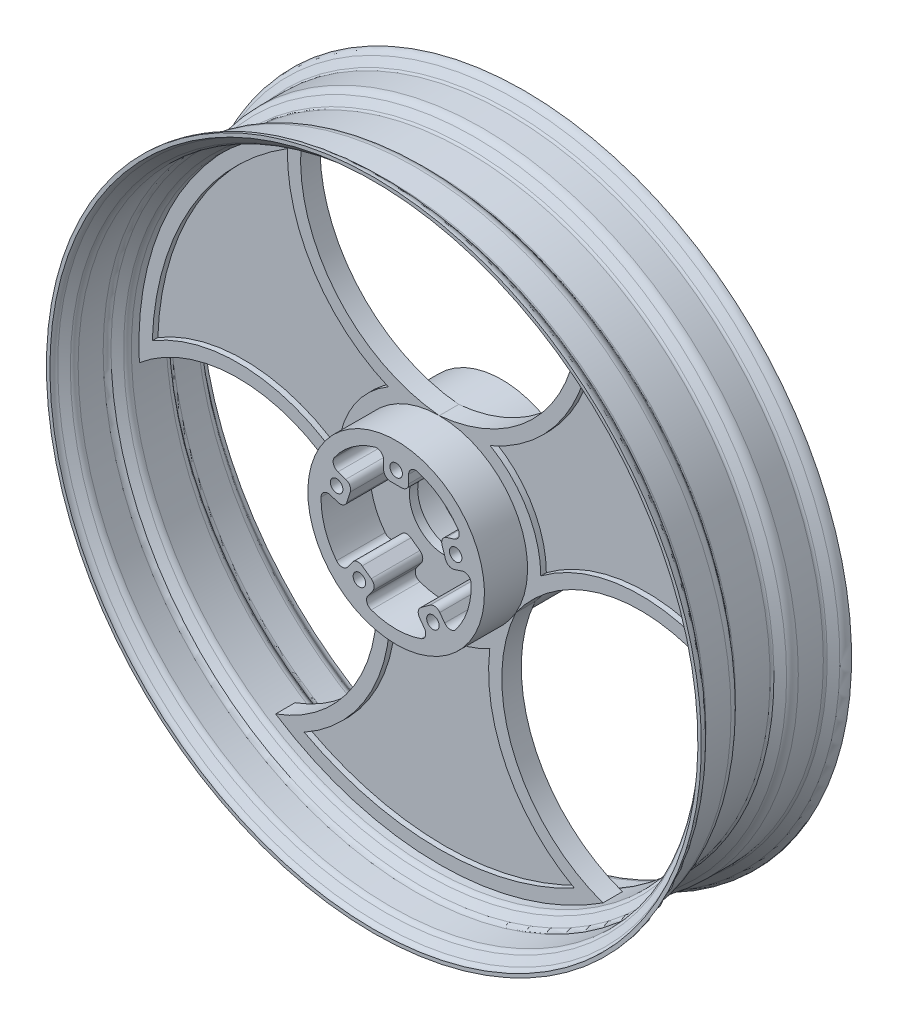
ISO-10303-21;
HEADER;
FILE_DESCRIPTION(('STEP AP214'),'2;1');
FILE_NAME('part.step','',(''),(''),'','','');
FILE_SCHEMA(('AUTOMOTIVE_DESIGN { 1 0 10303 214 1 1 1 1 }'));
ENDSEC;
DATA;
#1=APPLICATION_CONTEXT('core data for automotive mechanical design processes');
#2=APPLICATION_PROTOCOL_DEFINITION('international standard','automotive_design',2000,#1);
#3=PRODUCT_CONTEXT('',#1,'mechanical');
#4=PRODUCT('Part','Part','',(#3));
#5=PRODUCT_RELATED_PRODUCT_CATEGORY('part','',(#4));
#6=PRODUCT_DEFINITION_FORMATION('','',#4);
#7=PRODUCT_DEFINITION_CONTEXT('part definition',#1,'design');
#8=PRODUCT_DEFINITION('design','',#6,#7);
#9=PRODUCT_DEFINITION_SHAPE('','',#8);
#10=(LENGTH_UNIT() NAMED_UNIT(*) SI_UNIT(.MILLI.,.METRE.));
#11=(NAMED_UNIT(*) PLANE_ANGLE_UNIT() SI_UNIT($,.RADIAN.));
#12=(NAMED_UNIT(*) SI_UNIT($,.STERADIAN.) SOLID_ANGLE_UNIT());
#13=UNCERTAINTY_MEASURE_WITH_UNIT(LENGTH_MEASURE(1.E-05),#10,'distance_accuracy_value','');
#14=(GEOMETRIC_REPRESENTATION_CONTEXT(3) GLOBAL_UNCERTAINTY_ASSIGNED_CONTEXT((#13)) GLOBAL_UNIT_ASSIGNED_CONTEXT((#10,
#11,#12)) REPRESENTATION_CONTEXT('',''));
#15=CARTESIAN_POINT('',(0.,0.,0.));
#16=DIRECTION('',(0.,0.,1.));
#17=DIRECTION('',(1.,0.,0.));
#18=AXIS2_PLACEMENT_3D('',#15,#16,#17);
#19=CARTESIAN_POINT('',(0.,0.,2.99999999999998));
#20=DIRECTION('',(0.,0.,1.));
#21=DIRECTION('',(1.,0.,0.));
#22=AXIS2_PLACEMENT_3D('',#19,#20,#21);
#23=CYLINDRICAL_SURFACE('',#22,54.);
#24=CARTESIAN_POINT('',(0.,0.,2.99999999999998));
#25=DIRECTION('',(0.,0.,1.));
#26=DIRECTION('',(1.,0.,0.));
#27=AXIS2_PLACEMENT_3D('',#24,#25,#26);
#28=CIRCLE('',#27,54.);
#29=CARTESIAN_POINT('',(44.4485345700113,30.6647643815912,2.99999999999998));
#30=VERTEX_POINT('',#29);
#31=CARTESIAN_POINT('',(15.4285714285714,51.7490017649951,2.99999999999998));
#32=VERTEX_POINT('',#31);
#33=EDGE_CURVE('E960',#30,#32,#28,.T.);
#34=ORIENTED_EDGE('',*,*,#33,.F.);
#35=DIRECTION('',(0.,0.,1.));
#36=VECTOR('',#35,1.);
#37=CARTESIAN_POINT('',(44.4485345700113,30.6647643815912,2.99999999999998));
#38=LINE('',#37,#36);
#39=CARTESIAN_POINT('',(44.4485345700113,30.6647643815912,38.));
#40=VERTEX_POINT('',#39);
#41=EDGE_CURVE('E866',#30,#40,#38,.T.);
#42=ORIENTED_EDGE('',*,*,#41,.T.);
#43=CARTESIAN_POINT('',(0.,0.,38.));
#44=DIRECTION('',(0.,0.,1.));
#45=DIRECTION('',(1.,0.,0.));
#46=AXIS2_PLACEMENT_3D('',#43,#44,#45);
#47=CIRCLE('',#46,54.);
#48=CARTESIAN_POINT('',(15.4285714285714,51.7490017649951,38.));
#49=VERTEX_POINT('',#48);
#50=EDGE_CURVE('E961',#40,#49,#47,.T.);
#51=ORIENTED_EDGE('',*,*,#50,.T.);
#52=DIRECTION('',(0.,0.,1.));
#53=VECTOR('',#52,1.);
#54=CARTESIAN_POINT('',(15.4285714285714,51.7490017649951,2.99999999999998));
#55=LINE('',#54,#53);
#56=EDGE_CURVE('E864',#49,#32,#55,.F.);
#57=ORIENTED_EDGE('',*,*,#56,.T.);
#58=EDGE_LOOP('',(#34,#42,#51,#57));
#59=FACE_BOUND('',#58,.T.);
#60=ADVANCED_FACE('F33',(#59),#23,.F.);
#61=CARTESIAN_POINT('',(42.8992765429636,-32.7971351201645,2.99999999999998));
#62=VERTEX_POINT('',#61);
#63=CARTESIAN_POINT('',(53.9839161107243,1.31787759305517,2.99999999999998));
#64=VERTEX_POINT('',#63);
#65=EDGE_CURVE('E1022',#62,#64,#28,.T.);
#66=ORIENTED_EDGE('',*,*,#65,.F.);
#67=DIRECTION('',(0.,0.,1.));
#68=VECTOR('',#67,1.);
#69=CARTESIAN_POINT('',(42.8992765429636,-32.7971351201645,2.99999999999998));
#70=LINE('',#69,#68);
#71=CARTESIAN_POINT('',(42.8992765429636,-32.7971351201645,38.));
#72=VERTEX_POINT('',#71);
#73=EDGE_CURVE('E856',#62,#72,#70,.T.);
#74=ORIENTED_EDGE('',*,*,#73,.T.);
#75=CARTESIAN_POINT('',(53.9839161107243,1.31787759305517,38.));
#76=VERTEX_POINT('',#75);
#77=EDGE_CURVE('E1089',#72,#76,#47,.T.);
#78=ORIENTED_EDGE('',*,*,#77,.T.);
#79=DIRECTION('',(0.,0.,1.));
#80=VECTOR('',#79,1.);
#81=CARTESIAN_POINT('',(53.9839161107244,1.31787759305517,2.99999999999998));
#82=LINE('',#81,#80);
#83=EDGE_CURVE('E854',#76,#64,#82,.F.);
#84=ORIENTED_EDGE('',*,*,#83,.T.);
#85=EDGE_LOOP('',(#66,#74,#78,#84));
#86=FACE_BOUND('',#85,.T.);
#87=ADVANCED_FACE('F1145',(#86),#23,.F.);
#88=CARTESIAN_POINT('',(-17.935323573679,-50.9345086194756,2.99999999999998));
#89=VERTEX_POINT('',#88);
#90=CARTESIAN_POINT('',(17.9353235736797,-50.9345086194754,2.99999999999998));
#91=VERTEX_POINT('',#90);
#92=EDGE_CURVE('E1024',#89,#91,#28,.T.);
#93=ORIENTED_EDGE('',*,*,#92,.F.);
#94=DIRECTION('',(0.,0.,1.));
#95=VECTOR('',#94,1.);
#96=CARTESIAN_POINT('',(-17.935323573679,-50.9345086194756,2.99999999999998));
#97=LINE('',#96,#95);
#98=CARTESIAN_POINT('',(-17.935323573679,-50.9345086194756,38.));
#99=VERTEX_POINT('',#98);
#100=EDGE_CURVE('E836',#89,#99,#97,.T.);
#101=ORIENTED_EDGE('',*,*,#100,.T.);
#102=CARTESIAN_POINT('',(17.9353235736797,-50.9345086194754,38.));
#103=VERTEX_POINT('',#102);
#104=EDGE_CURVE('E1087',#99,#103,#47,.T.);
#105=ORIENTED_EDGE('',*,*,#104,.T.);
#106=DIRECTION('',(0.,0.,1.));
#107=VECTOR('',#106,1.);
#108=CARTESIAN_POINT('',(17.9353235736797,-50.9345086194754,2.99999999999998));
#109=LINE('',#108,#107);
#110=EDGE_CURVE('E834',#103,#91,#109,.F.);
#111=ORIENTED_EDGE('',*,*,#110,.T.);
#112=EDGE_LOOP('',(#93,#101,#105,#111));
#113=FACE_BOUND('',#112,.T.);
#114=ADVANCED_FACE('F1150',(#113),#23,.F.);
#115=CARTESIAN_POINT('',(-53.9839161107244,1.31787759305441,38.));
#116=VERTEX_POINT('',#115);
#117=CARTESIAN_POINT('',(-42.8992765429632,-32.7971351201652,38.));
#118=VERTEX_POINT('',#117);
#119=EDGE_CURVE('E519',#116,#118,#47,.T.);
#120=ORIENTED_EDGE('',*,*,#119,.T.);
#121=DIRECTION('',(0.,0.,1.));
#122=VECTOR('',#121,1.);
#123=CARTESIAN_POINT('',(-42.8992765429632,-32.7971351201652,2.99999999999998));
#124=LINE('',#123,#122);
#125=CARTESIAN_POINT('',(-42.8992765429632,-32.7971351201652,2.99999999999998));
#126=VERTEX_POINT('',#125);
#127=EDGE_CURVE('E807',#118,#126,#124,.F.);
#128=ORIENTED_EDGE('',*,*,#127,.T.);
#129=CARTESIAN_POINT('',(-53.9839161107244,1.31787759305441,2.99999999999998));
#130=VERTEX_POINT('',#129);
#131=EDGE_CURVE('E1025',#130,#126,#28,.T.);
#132=ORIENTED_EDGE('',*,*,#131,.F.);
#133=DIRECTION('',(0.,0.,1.));
#134=VECTOR('',#133,1.);
#135=CARTESIAN_POINT('',(-53.9839161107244,1.31787759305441,2.99999999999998));
#136=LINE('',#135,#134);
#137=EDGE_CURVE('E804',#130,#116,#136,.T.);
#138=ORIENTED_EDGE('',*,*,#137,.T.);
#139=EDGE_LOOP('',(#120,#128,#132,#138));
#140=FACE_BOUND('',#139,.T.);
#141=ADVANCED_FACE('F1086',(#140),#23,.F.);
#142=CARTESIAN_POINT('',(0.,63.5,-7.00000000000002));
#143=DIRECTION('',(0.,0.,1.));
#144=DIRECTION('',(0.,-1.,0.));
#145=AXIS2_PLACEMENT_3D('',#142,#143,#144);
#146=PLANE('',#145);
#147=CARTESIAN_POINT('',(0.,0.,-7.00000000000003));
#148=DIRECTION('',(0.,0.,1.));
#149=DIRECTION('',(0.,-1.,0.));
#150=AXIS2_PLACEMENT_3D('',#147,#148,#149);
#151=CIRCLE('',#150,216.);
#152=CARTESIAN_POINT('',(215.700329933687,-11.3739907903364,-7.00000000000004));
#153=VERTEX_POINT('',#152);
#154=CARTESIAN_POINT('',(98.,192.488960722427,-7.00000000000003));
#155=VERTEX_POINT('',#154);
#156=EDGE_CURVE('E745',#153,#155,#151,.T.);
#157=ORIENTED_EDGE('',*,*,#156,.F.);
#158=CARTESIAN_POINT('',(144.708138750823,-95.398444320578,-7.00000000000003));
#159=DIRECTION('',(0.,0.,1.));
#160=DIRECTION('',(0.,-1.,0.));
#161=AXIS2_PLACEMENT_3D('',#158,#159,#160);
#162=CIRCLE('',#161,110.);
#163=CARTESIAN_POINT('',(54.9926131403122,-31.7499999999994,-7.00000000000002));
#164=VERTEX_POINT('',#163);
#165=EDGE_CURVE('E687',#164,#153,#162,.F.);
#166=ORIENTED_EDGE('',*,*,#165,.F.);
#167=CARTESIAN_POINT('',(0.,0.,-7.00000000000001));
#168=DIRECTION('',(0.,0.,1.));
#169=DIRECTION('',(0.,-1.,0.));
#170=AXIS2_PLACEMENT_3D('',#167,#168,#169);
#171=CIRCLE('',#170,63.5);
#172=CARTESIAN_POINT('',(0.,63.5,-7.00000000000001));
#173=VERTEX_POINT('',#172);
#174=EDGE_CURVE('E756',#164,#173,#171,.T.);
#175=ORIENTED_EDGE('',*,*,#174,.T.);
#176=CARTESIAN_POINT('',(-10.2634068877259,173.020146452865,-7.));
#177=DIRECTION('',(0.,0.,1.));
#178=DIRECTION('',(0.,-1.,0.));
#179=AXIS2_PLACEMENT_3D('',#176,#177,#178);
#180=CIRCLE('',#179,110.);
#181=EDGE_CURVE('E1488',#155,#173,#180,.F.);
#182=ORIENTED_EDGE('',*,*,#181,.F.);
#183=EDGE_LOOP('',(#157,#166,#175,#182));
#184=FACE_BOUND('',#183,.T.);
#185=CARTESIAN_POINT('',(144.708138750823,-95.398444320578,-6.99999999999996));
#186=DIRECTION('',(0.,0.,-1.));
#187=DIRECTION('',(-0.499999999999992,-0.866025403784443,0.));
#188=AXIS2_PLACEMENT_3D('',#185,#186,#187);
#189=CIRCLE('',#188,119.5);
#190=CARTESIAN_POINT('',(72.9997388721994,0.195255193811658,-7.00000000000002));
#191=VERTEX_POINT('',#190);
#192=CARTESIAN_POINT('',(206.382800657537,6.95626284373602,-6.99999999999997));
#193=VERTEX_POINT('',#192);
#194=EDGE_CURVE('E509',#191,#193,#189,.T.);
#195=ORIENTED_EDGE('',*,*,#194,.T.);
#196=CARTESIAN_POINT('',(0.,0.,-6.99999999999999));
#197=DIRECTION('',(0.,0.,1.));
#198=DIRECTION('',(-0.499999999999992,-0.866025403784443,0.));
#199=AXIS2_PLACEMENT_3D('',#196,#197,#198);
#200=CIRCLE('',#199,206.5);
#201=CARTESIAN_POINT('',(109.215700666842,175.254616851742,-7.00000000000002));
#202=VERTEX_POINT('',#201);
#203=EDGE_CURVE('E513',#193,#202,#200,.T.);
#204=ORIENTED_EDGE('',*,*,#203,.T.);
#205=CARTESIAN_POINT('',(-10.2634068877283,173.020146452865,-7.00000000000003));
#206=DIRECTION('',(0.,0.,-1.));
#207=DIRECTION('',(-0.499999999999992,-0.866025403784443,0.));
#208=AXIS2_PLACEMENT_3D('',#205,#206,#207);
#209=CIRCLE('',#208,119.5);
#210=CARTESIAN_POINT('',(36.66896539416,63.1220007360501,-7.));
#211=VERTEX_POINT('',#210);
#212=EDGE_CURVE('E516',#202,#211,#209,.T.);
#213=ORIENTED_EDGE('',*,*,#212,.T.);
#214=CARTESIAN_POINT('',(0.,0.,-6.99999999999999));
#215=DIRECTION('',(0.,0.,-1.));
#216=DIRECTION('',(-0.499999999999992,-0.866025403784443,0.));
#217=AXIS2_PLACEMENT_3D('',#214,#215,#216);
#218=CIRCLE('',#217,73.);
#219=EDGE_CURVE('E525',#211,#191,#218,.T.);
#220=ORIENTED_EDGE('',*,*,#219,.T.);
#221=EDGE_LOOP('',(#195,#204,#213,#220));
#222=FACE_BOUND('',#221,.T.);
#223=ADVANCED_FACE('F1160',(#184,#222),#146,.F.);
#224=CARTESIAN_POINT('',(-117.700329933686,-181.114969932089,-7.00000000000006));
#225=VERTEX_POINT('',#224);
#226=CARTESIAN_POINT('',(117.700329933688,-181.114969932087,-7.00000000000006));
#227=VERTEX_POINT('',#226);
#228=EDGE_CURVE('E740',#225,#227,#151,.T.);
#229=ORIENTED_EDGE('',*,*,#228,.F.);
#230=CARTESIAN_POINT('',(-154.971545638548,-77.6217021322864,-7.00000000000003));
#231=DIRECTION('',(0.,0.,1.));
#232=DIRECTION('',(0.,-1.,0.));
#233=AXIS2_PLACEMENT_3D('',#230,#231,#232);
#234=CIRCLE('',#233,110.);
#235=CARTESIAN_POINT('',(-54.9926131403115,-31.7500000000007,-7.00000000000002));
#236=VERTEX_POINT('',#235);
#237=EDGE_CURVE('E694',#236,#225,#234,.F.);
#238=ORIENTED_EDGE('',*,*,#237,.F.);
#239=EDGE_CURVE('E1377',#236,#164,#171,.T.);
#240=ORIENTED_EDGE('',*,*,#239,.T.);
#241=CARTESIAN_POINT('',(154.971545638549,-77.6217021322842,-7.00000000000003));
#242=DIRECTION('',(0.,0.,1.));
#243=DIRECTION('',(0.,-1.,0.));
#244=AXIS2_PLACEMENT_3D('',#241,#242,#243);
#245=CIRCLE('',#244,110.);
#246=EDGE_CURVE('E697',#227,#164,#245,.F.);
#247=ORIENTED_EDGE('',*,*,#246,.F.);
#248=EDGE_LOOP('',(#229,#238,#240,#247));
#249=FACE_BOUND('',#248,.T.);
#250=CARTESIAN_POINT('',(-154.971545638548,-77.6217021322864,-6.99999999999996));
#251=DIRECTION('',(0.,0.,-1.));
#252=DIRECTION('',(-0.500000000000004,0.866025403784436,0.));
#253=AXIS2_PLACEMENT_3D('',#250,#251,#252);
#254=CIRCLE('',#253,119.5);
#255=CARTESIAN_POINT('',(-36.3307734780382,-63.3172559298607,-7.00000000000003));
#256=VERTEX_POINT('',#255);
#257=CARTESIAN_POINT('',(-97.1670999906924,-182.210879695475,-6.99999999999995));
#258=VERTEX_POINT('',#257);
#259=EDGE_CURVE('E532',#256,#258,#254,.T.);
#260=ORIENTED_EDGE('',*,*,#259,.T.);
#261=CARTESIAN_POINT('',(0.,0.,-6.99999999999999));
#262=DIRECTION('',(0.,0.,1.));
#263=DIRECTION('',(-0.500000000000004,0.866025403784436,0.));
#264=AXIS2_PLACEMENT_3D('',#261,#262,#263);
#265=CIRCLE('',#264,206.5);
#266=CARTESIAN_POINT('',(97.167099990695,-182.210879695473,-6.99999999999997));
#267=VERTEX_POINT('',#266);
#268=EDGE_CURVE('E540',#258,#267,#265,.T.);
#269=ORIENTED_EDGE('',*,*,#268,.T.);
#270=CARTESIAN_POINT('',(154.971545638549,-77.6217021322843,-7.));
#271=DIRECTION('',(0.,0.,-1.));
#272=DIRECTION('',(-0.500000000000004,0.866025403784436,0.));
#273=AXIS2_PLACEMENT_3D('',#270,#271,#272);
#274=CIRCLE('',#273,119.5);
#275=CARTESIAN_POINT('',(36.3307734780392,-63.3172559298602,-6.99999999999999));
#276=VERTEX_POINT('',#275);
#277=EDGE_CURVE('E552',#267,#276,#274,.T.);
#278=ORIENTED_EDGE('',*,*,#277,.T.);
#279=CARTESIAN_POINT('',(0.,0.,-6.99999999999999));
#280=DIRECTION('',(0.,0.,-1.));
#281=DIRECTION('',(-0.500000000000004,0.866025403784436,0.));
#282=AXIS2_PLACEMENT_3D('',#279,#280,#281);
#283=CIRCLE('',#282,73.);
#284=EDGE_CURVE('E549',#276,#256,#283,.T.);
#285=ORIENTED_EDGE('',*,*,#284,.T.);
#286=EDGE_LOOP('',(#260,#269,#278,#285));
#287=FACE_BOUND('',#286,.T.);
#288=ADVANCED_FACE('F1165',(#249,#287),#146,.F.);
#289=EDGE_CURVE('E1371',#173,#236,#171,.T.);
#290=ORIENTED_EDGE('',*,*,#289,.T.);
#291=CARTESIAN_POINT('',(-144.708138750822,-95.39844432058,-7.00000000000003));
#292=DIRECTION('',(0.,0.,1.));
#293=DIRECTION('',(0.,-1.,0.));
#294=AXIS2_PLACEMENT_3D('',#291,#292,#293);
#295=CIRCLE('',#294,110.);
#296=CARTESIAN_POINT('',(-215.700329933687,-11.3739907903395,-7.00000000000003));
#297=VERTEX_POINT('',#296);
#298=EDGE_CURVE('E705',#297,#236,#295,.F.);
#299=ORIENTED_EDGE('',*,*,#298,.F.);
#300=CARTESIAN_POINT('',(-98.,192.488960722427,-7.00000000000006));
#301=VERTEX_POINT('',#300);
#302=EDGE_CURVE('E744',#301,#297,#151,.T.);
#303=ORIENTED_EDGE('',*,*,#302,.F.);
#304=CARTESIAN_POINT('',(10.2634068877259,173.020146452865,-7.));
#305=DIRECTION('',(0.,0.,1.));
#306=DIRECTION('',(0.,-1.,0.));
#307=AXIS2_PLACEMENT_3D('',#304,#305,#306);
#308=CIRCLE('',#307,110.);
#309=EDGE_CURVE('E712',#173,#301,#308,.F.);
#310=ORIENTED_EDGE('',*,*,#309,.F.);
#311=EDGE_LOOP('',(#290,#299,#303,#310));
#312=FACE_BOUND('',#311,.T.);
#313=CARTESIAN_POINT('',(10.2634068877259,173.020146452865,-6.99999999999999));
#314=DIRECTION('',(0.,0.,-1.));
#315=DIRECTION('',(1.,0.,0.));
#316=AXIS2_PLACEMENT_3D('',#313,#314,#315);
#317=CIRCLE('',#316,119.5);
#318=CARTESIAN_POINT('',(-36.6689653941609,63.1220007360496,-7.00000000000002));
#319=VERTEX_POINT('',#318);
#320=CARTESIAN_POINT('',(-109.215700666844,175.25461685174,-6.99999999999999));
#321=VERTEX_POINT('',#320);
#322=EDGE_CURVE('E560',#319,#321,#317,.T.);
#323=ORIENTED_EDGE('',*,*,#322,.T.);
#324=CARTESIAN_POINT('',(0.,0.,-6.99999999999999));
#325=DIRECTION('',(0.,0.,1.));
#326=DIRECTION('',(1.,0.,0.));
#327=AXIS2_PLACEMENT_3D('',#324,#325,#326);
#328=CIRCLE('',#327,206.5);
#329=CARTESIAN_POINT('',(-206.382800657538,6.95626284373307,-6.99999999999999));
#330=VERTEX_POINT('',#329);
#331=EDGE_CURVE('E571',#321,#330,#328,.T.);
#332=ORIENTED_EDGE('',*,*,#331,.T.);
#333=CARTESIAN_POINT('',(-144.708138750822,-95.39844432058,-6.99999999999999));
#334=DIRECTION('',(0.,0.,-1.));
#335=DIRECTION('',(1.,0.,0.));
#336=AXIS2_PLACEMENT_3D('',#333,#334,#335);
#337=CIRCLE('',#336,119.5);
#338=CARTESIAN_POINT('',(-72.9997388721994,0.195255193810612,-6.99999999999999));
#339=VERTEX_POINT('',#338);
#340=EDGE_CURVE('E583',#330,#339,#337,.T.);
#341=ORIENTED_EDGE('',*,*,#340,.T.);
#342=CARTESIAN_POINT('',(0.,0.,-6.99999999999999));
#343=DIRECTION('',(0.,0.,-1.));
#344=DIRECTION('',(1.,0.,0.));
#345=AXIS2_PLACEMENT_3D('',#342,#343,#344);
#346=CIRCLE('',#345,73.);
#347=EDGE_CURVE('E580',#339,#319,#346,.T.);
#348=ORIENTED_EDGE('',*,*,#347,.T.);
#349=EDGE_LOOP('',(#323,#332,#341,#348));
#350=FACE_BOUND('',#349,.T.);
#351=ADVANCED_FACE('F1168',(#312,#350),#146,.F.);
#352=CARTESIAN_POINT('',(0.,63.5,7.));
#353=DIRECTION('',(0.,0.,-1.));
#354=DIRECTION('',(0.,1.,0.));
#355=AXIS2_PLACEMENT_3D('',#352,#353,#354);
#356=PLANE('',#355);
#357=CARTESIAN_POINT('',(0.,0.,6.99999999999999));
#358=DIRECTION('',(0.,0.,1.));
#359=DIRECTION('',(-0.500000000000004,0.866025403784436,0.));
#360=AXIS2_PLACEMENT_3D('',#357,#358,#359);
#361=CIRCLE('',#360,206.5);
#362=CARTESIAN_POINT('',(-97.1670999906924,-182.210879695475,6.99999999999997));
#363=VERTEX_POINT('',#362);
#364=CARTESIAN_POINT('',(97.167099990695,-182.210879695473,6.99999999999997));
#365=VERTEX_POINT('',#364);
#366=EDGE_CURVE('E645',#363,#365,#361,.T.);
#367=ORIENTED_EDGE('',*,*,#366,.F.);
#368=CARTESIAN_POINT('',(-154.971545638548,-77.6217021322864,6.99999999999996));
#369=DIRECTION('',(0.,0.,-1.));
#370=DIRECTION('',(-0.500000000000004,0.866025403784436,0.));
#371=AXIS2_PLACEMENT_3D('',#368,#369,#370);
#372=CIRCLE('',#371,119.5);
#373=CARTESIAN_POINT('',(-36.3307734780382,-63.3172559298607,6.99999999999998));
#374=VERTEX_POINT('',#373);
#375=EDGE_CURVE('E623',#374,#363,#372,.T.);
#376=ORIENTED_EDGE('',*,*,#375,.F.);
#377=CARTESIAN_POINT('',(0.,0.,6.99999999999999));
#378=DIRECTION('',(0.,0.,-1.));
#379=DIRECTION('',(-0.500000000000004,0.866025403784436,0.));
#380=AXIS2_PLACEMENT_3D('',#377,#378,#379);
#381=CIRCLE('',#380,73.);
#382=CARTESIAN_POINT('',(36.3307734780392,-63.3172559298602,6.99999999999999));
#383=VERTEX_POINT('',#382);
#384=EDGE_CURVE('E634',#383,#374,#381,.T.);
#385=ORIENTED_EDGE('',*,*,#384,.F.);
#386=CARTESIAN_POINT('',(154.971545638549,-77.6217021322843,7.));
#387=DIRECTION('',(0.,0.,-1.));
#388=DIRECTION('',(-0.500000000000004,0.866025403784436,0.));
#389=AXIS2_PLACEMENT_3D('',#386,#387,#388);
#390=CIRCLE('',#389,119.5);
#391=EDGE_CURVE('E648',#365,#383,#390,.T.);
#392=ORIENTED_EDGE('',*,*,#391,.F.);
#393=EDGE_LOOP('',(#367,#376,#385,#392));
#394=FACE_BOUND('',#393,.T.);
#395=CARTESIAN_POINT('',(0.,0.,7.00000000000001));
#396=DIRECTION('',(0.,0.,1.));
#397=DIRECTION('',(0.,-1.,0.));
#398=AXIS2_PLACEMENT_3D('',#395,#396,#397);
#399=CIRCLE('',#398,63.5);
#400=CARTESIAN_POINT('',(-54.9926131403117,-31.7500000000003,6.99999999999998));
#401=VERTEX_POINT('',#400);
#402=CARTESIAN_POINT('',(54.9926131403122,-31.7499999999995,6.99999999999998));
#403=VERTEX_POINT('',#402);
#404=EDGE_CURVE('E1383',#401,#403,#399,.T.);
#405=ORIENTED_EDGE('',*,*,#404,.F.);
#406=CARTESIAN_POINT('',(-154.971545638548,-77.6217021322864,6.99999999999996));
#407=DIRECTION('',(0.,0.,1.));
#408=DIRECTION('',(0.500000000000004,-0.866025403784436,0.));
#409=AXIS2_PLACEMENT_3D('',#406,#407,#408);
#410=CIRCLE('',#409,110.);
#411=CARTESIAN_POINT('',(-117.700329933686,-181.114969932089,6.99999999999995));
#412=VERTEX_POINT('',#411);
#413=EDGE_CURVE('E696',#412,#401,#410,.T.);
#414=ORIENTED_EDGE('',*,*,#413,.F.);
#415=CARTESIAN_POINT('',(0.,0.,6.99999999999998));
#416=DIRECTION('',(0.,0.,1.));
#417=DIRECTION('',(0.,-1.,0.));
#418=AXIS2_PLACEMENT_3D('',#415,#416,#417);
#419=CIRCLE('',#418,216.);
#420=CARTESIAN_POINT('',(117.700329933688,-181.114969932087,6.99999999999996));
#421=VERTEX_POINT('',#420);
#422=EDGE_CURVE('E764',#412,#421,#419,.T.);
#423=ORIENTED_EDGE('',*,*,#422,.T.);
#424=CARTESIAN_POINT('',(154.971545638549,-77.6217021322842,6.99999999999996));
#425=DIRECTION('',(0.,0.,1.));
#426=DIRECTION('',(-0.499999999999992,-0.866025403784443,0.));
#427=AXIS2_PLACEMENT_3D('',#424,#425,#426);
#428=CIRCLE('',#427,110.);
#429=EDGE_CURVE('E717',#403,#421,#428,.T.);
#430=ORIENTED_EDGE('',*,*,#429,.F.);
#431=EDGE_LOOP('',(#405,#414,#423,#430));
#432=FACE_BOUND('',#431,.T.);
#433=ADVANCED_FACE('F1566',(#394,#432),#356,.F.);
#434=CARTESIAN_POINT('',(0.,0.,6.99999999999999));
#435=DIRECTION('',(0.,0.,1.));
#436=DIRECTION('',(-0.499999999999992,-0.866025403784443,0.));
#437=AXIS2_PLACEMENT_3D('',#434,#435,#436);
#438=CIRCLE('',#437,206.5);
#439=CARTESIAN_POINT('',(206.382800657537,6.95626284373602,6.99999999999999));
#440=VERTEX_POINT('',#439);
#441=CARTESIAN_POINT('',(109.215700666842,175.254616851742,7.00000000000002));
#442=VERTEX_POINT('',#441);
#443=EDGE_CURVE('E613',#440,#442,#438,.T.);
#444=ORIENTED_EDGE('',*,*,#443,.F.);
#445=CARTESIAN_POINT('',(144.708138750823,-95.398444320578,6.99999999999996));
#446=DIRECTION('',(0.,0.,-1.));
#447=DIRECTION('',(-0.499999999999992,-0.866025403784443,0.));
#448=AXIS2_PLACEMENT_3D('',#445,#446,#447);
#449=CIRCLE('',#448,119.5);
#450=CARTESIAN_POINT('',(72.9997388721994,0.195255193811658,6.99999999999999));
#451=VERTEX_POINT('',#450);
#452=EDGE_CURVE('E591',#451,#440,#449,.T.);
#453=ORIENTED_EDGE('',*,*,#452,.F.);
#454=CARTESIAN_POINT('',(0.,0.,6.99999999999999));
#455=DIRECTION('',(0.,0.,-1.));
#456=DIRECTION('',(-0.499999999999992,-0.866025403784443,0.));
#457=AXIS2_PLACEMENT_3D('',#454,#455,#456);
#458=CIRCLE('',#457,73.);
#459=CARTESIAN_POINT('',(36.66896539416,63.1220007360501,7.));
#460=VERTEX_POINT('',#459);
#461=EDGE_CURVE('E602',#460,#451,#458,.T.);
#462=ORIENTED_EDGE('',*,*,#461,.F.);
#463=CARTESIAN_POINT('',(-10.2634068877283,173.020146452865,7.00000000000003));
#464=DIRECTION('',(0.,0.,-1.));
#465=DIRECTION('',(-0.499999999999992,-0.866025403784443,0.));
#466=AXIS2_PLACEMENT_3D('',#463,#464,#465);
#467=CIRCLE('',#466,119.5);
#468=EDGE_CURVE('E616',#442,#460,#467,.T.);
#469=ORIENTED_EDGE('',*,*,#468,.F.);
#470=EDGE_LOOP('',(#444,#453,#462,#469));
#471=FACE_BOUND('',#470,.T.);
#472=CARTESIAN_POINT('',(0.,63.5,7.));
#473=VERTEX_POINT('',#472);
#474=EDGE_CURVE('E1374',#403,#473,#399,.T.);
#475=ORIENTED_EDGE('',*,*,#474,.F.);
#476=CARTESIAN_POINT('',(144.708138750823,-95.398444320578,6.99999999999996));
#477=DIRECTION('',(0.,0.,1.));
#478=DIRECTION('',(0.499999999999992,0.866025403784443,0.));
#479=AXIS2_PLACEMENT_3D('',#476,#477,#478);
#480=CIRCLE('',#479,110.);
#481=CARTESIAN_POINT('',(215.700329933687,-11.3739907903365,6.99999999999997));
#482=VERTEX_POINT('',#481);
#483=EDGE_CURVE('E714',#482,#403,#480,.T.);
#484=ORIENTED_EDGE('',*,*,#483,.F.);
#485=CARTESIAN_POINT('',(98.,192.488960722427,6.99999999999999));
#486=VERTEX_POINT('',#485);
#487=EDGE_CURVE('E766',#482,#486,#419,.T.);
#488=ORIENTED_EDGE('',*,*,#487,.T.);
#489=CARTESIAN_POINT('',(-10.2634068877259,173.020146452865,6.99999999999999));
#490=DIRECTION('',(0.,0.,1.));
#491=DIRECTION('',(1.,0.,0.));
#492=AXIS2_PLACEMENT_3D('',#489,#490,#491);
#493=CIRCLE('',#492,110.);
#494=EDGE_CURVE('E737',#473,#486,#493,.T.);
#495=ORIENTED_EDGE('',*,*,#494,.F.);
#496=EDGE_LOOP('',(#475,#484,#488,#495));
#497=FACE_BOUND('',#496,.T.);
#498=ADVANCED_FACE('F1515',(#471,#497),#356,.F.);
#499=CARTESIAN_POINT('',(0.,0.,6.99999999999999));
#500=DIRECTION('',(0.,0.,1.));
#501=DIRECTION('',(1.,0.,0.));
#502=AXIS2_PLACEMENT_3D('',#499,#500,#501);
#503=CIRCLE('',#502,206.5);
#504=CARTESIAN_POINT('',(-109.215700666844,175.25461685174,7.00000000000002));
#505=VERTEX_POINT('',#504);
#506=CARTESIAN_POINT('',(-206.382800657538,6.95626284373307,6.99999999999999));
#507=VERTEX_POINT('',#506);
#508=EDGE_CURVE('E677',#505,#507,#503,.T.);
#509=ORIENTED_EDGE('',*,*,#508,.F.);
#510=CARTESIAN_POINT('',(10.2634068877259,173.020146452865,6.99999999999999));
#511=DIRECTION('',(0.,0.,-1.));
#512=DIRECTION('',(1.,0.,0.));
#513=AXIS2_PLACEMENT_3D('',#510,#511,#512);
#514=CIRCLE('',#513,119.5);
#515=CARTESIAN_POINT('',(-36.6689653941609,63.1220007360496,6.99999999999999));
#516=VERTEX_POINT('',#515);
#517=EDGE_CURVE('E655',#516,#505,#514,.T.);
#518=ORIENTED_EDGE('',*,*,#517,.F.);
#519=CARTESIAN_POINT('',(0.,0.,6.99999999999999));
#520=DIRECTION('',(0.,0.,-1.));
#521=DIRECTION('',(1.,0.,0.));
#522=AXIS2_PLACEMENT_3D('',#519,#520,#521);
#523=CIRCLE('',#522,73.);
#524=CARTESIAN_POINT('',(-72.9997388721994,0.195255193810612,6.99999999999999));
#525=VERTEX_POINT('',#524);
#526=EDGE_CURVE('E666',#525,#516,#523,.T.);
#527=ORIENTED_EDGE('',*,*,#526,.F.);
#528=CARTESIAN_POINT('',(-144.708138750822,-95.39844432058,6.99999999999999));
#529=DIRECTION('',(0.,0.,-1.));
#530=DIRECTION('',(1.,0.,0.));
#531=AXIS2_PLACEMENT_3D('',#528,#529,#530);
#532=CIRCLE('',#531,119.5);
#533=EDGE_CURVE('E680',#507,#525,#532,.T.);
#534=ORIENTED_EDGE('',*,*,#533,.F.);
#535=EDGE_LOOP('',(#509,#518,#527,#534));
#536=FACE_BOUND('',#535,.T.);
#537=CARTESIAN_POINT('',(-98.,192.488960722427,6.99999999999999));
#538=VERTEX_POINT('',#537);
#539=CARTESIAN_POINT('',(-215.700329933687,-11.3739907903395,6.99999999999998));
#540=VERTEX_POINT('',#539);
#541=EDGE_CURVE('E759',#538,#540,#419,.T.);
#542=ORIENTED_EDGE('',*,*,#541,.T.);
#543=CARTESIAN_POINT('',(-144.708138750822,-95.39844432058,6.99999999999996));
#544=DIRECTION('',(0.,0.,1.));
#545=DIRECTION('',(-0.500000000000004,0.866025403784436,0.));
#546=AXIS2_PLACEMENT_3D('',#543,#544,#545);
#547=CIRCLE('',#546,110.);
#548=EDGE_CURVE('E700',#401,#540,#547,.T.);
#549=ORIENTED_EDGE('',*,*,#548,.F.);
#550=EDGE_CURVE('E768',#473,#401,#399,.T.);
#551=ORIENTED_EDGE('',*,*,#550,.F.);
#552=CARTESIAN_POINT('',(10.2634068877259,173.020146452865,6.99999999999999));
#553=DIRECTION('',(0.,0.,1.));
#554=DIRECTION('',(-1.,0.,0.));
#555=AXIS2_PLACEMENT_3D('',#552,#553,#554);
#556=CIRCLE('',#555,110.);
#557=EDGE_CURVE('E733',#538,#473,#556,.T.);
#558=ORIENTED_EDGE('',*,*,#557,.F.);
#559=EDGE_LOOP('',(#542,#549,#551,#558));
#560=FACE_BOUND('',#559,.T.);
#561=ADVANCED_FACE('F1482',(#536,#560),#356,.F.);
#562=CARTESIAN_POINT('',(0.,0.,-12.4091531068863));
#563=DIRECTION('',(0.,0.,1.));
#564=DIRECTION('',(0.,-1.,0.));
#565=AXIS2_PLACEMENT_3D('',#562,#563,#564);
#566=TOROIDAL_SURFACE('',#565,221.,5.00000000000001);
#567=CARTESIAN_POINT('',(0.,0.,-16.2393753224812));
#568=DIRECTION('',(0.,0.,1.));
#569=DIRECTION('',(0.,-1.,0.));
#570=AXIS2_PLACEMENT_3D('',#567,#568,#569);
#571=CIRCLE('',#570,217.786061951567);
#572=CARTESIAN_POINT('',(0.,-217.786061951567,-16.2393753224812));
#573=VERTEX_POINT('',#572);
#574=EDGE_CURVE('E750',#573,#573,#571,.T.);
#575=ORIENTED_EDGE('',*,*,#574,.F.);
#576=EDGE_LOOP('',(#575));
#577=FACE_BOUND('',#576,.T.);
#578=CARTESIAN_POINT('',(0.,0.,-12.4091531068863));
#579=DIRECTION('',(0.,0.,1.));
#580=DIRECTION('',(0.,-1.,0.));
#581=AXIS2_PLACEMENT_3D('',#578,#579,#580);
#582=CIRCLE('',#581,216.);
#583=CARTESIAN_POINT('',(0.,-216.,-12.4091531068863));
#584=VERTEX_POINT('',#583);
#585=EDGE_CURVE('E1486',#584,#584,#582,.T.);
#586=ORIENTED_EDGE('',*,*,#585,.T.);
#587=EDGE_LOOP('',(#586));
#588=FACE_BOUND('',#587,.T.);
#589=ADVANCED_FACE('F1479',(#577,#588),#566,.T.);
#590=CARTESIAN_POINT('',(0.,0.,-16.2393753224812));
#591=DIRECTION('',(0.,0.,-1.));
#592=DIRECTION('',(0.,1.,0.));
#593=AXIS2_PLACEMENT_3D('',#590,#591,#592);
#594=CONICAL_SURFACE('',#593,217.786061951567,0.872664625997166);
#595=CARTESIAN_POINT('',(0.,0.,-20.3743543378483));
#596=DIRECTION('',(0.,0.,1.));
#597=DIRECTION('',(0.,-1.,0.));
#598=AXIS2_PLACEMENT_3D('',#595,#596,#597);
#599=CIRCLE('',#598,222.713938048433);
#600=CARTESIAN_POINT('',(0.,-222.713938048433,-20.3743543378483));
#601=VERTEX_POINT('',#600);
#602=EDGE_CURVE('E1470',#601,#601,#599,.T.);
#603=ORIENTED_EDGE('',*,*,#602,.F.);
#604=EDGE_LOOP('',(#603));
#605=FACE_BOUND('',#604,.T.);
#606=ORIENTED_EDGE('',*,*,#574,.T.);
#607=EDGE_LOOP('',(#606));
#608=FACE_BOUND('',#607,.T.);
#609=ADVANCED_FACE('F1477',(#605,#608),#594,.F.);
#610=CARTESIAN_POINT('',(0.,0.,-24.2045765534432));
#611=DIRECTION('',(0.,0.,1.));
#612=DIRECTION('',(0.,-1.,0.));
#613=AXIS2_PLACEMENT_3D('',#610,#611,#612);
#614=TOROIDAL_SURFACE('',#613,219.5,5.00000000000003);
#615=CARTESIAN_POINT('',(0.,0.,-24.2045765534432));
#616=DIRECTION('',(0.,0.,1.));
#617=DIRECTION('',(0.,-1.,0.));
#618=AXIS2_PLACEMENT_3D('',#615,#616,#617);
#619=CIRCLE('',#618,224.5);
#620=CARTESIAN_POINT('',(0.,-224.5,-24.2045765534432));
#621=VERTEX_POINT('',#620);
#622=EDGE_CURVE('E1468',#621,#621,#619,.T.);
#623=ORIENTED_EDGE('',*,*,#622,.F.);
#624=EDGE_LOOP('',(#623));
#625=FACE_BOUND('',#624,.T.);
#626=ORIENTED_EDGE('',*,*,#602,.T.);
#627=EDGE_LOOP('',(#626));
#628=FACE_BOUND('',#627,.T.);
#629=ADVANCED_FACE('F1688',(#625,#628),#614,.F.);
#630=CARTESIAN_POINT('',(0.,0.,50.9126634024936));
#631=DIRECTION('',(0.,0.,1.));
#632=DIRECTION('',(0.,-1.,0.));
#633=AXIS2_PLACEMENT_3D('',#630,#631,#632);
#634=CYLINDRICAL_SURFACE('',#633,224.5);
#635=CARTESIAN_POINT('',(0.,0.,-42.2045765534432));
#636=DIRECTION('',(0.,0.,1.));
#637=DIRECTION('',(0.,-1.,0.));
#638=AXIS2_PLACEMENT_3D('',#635,#636,#637);
#639=CIRCLE('',#638,224.5);
#640=CARTESIAN_POINT('',(0.,-224.5,-42.2045765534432));
#641=VERTEX_POINT('',#640);
#642=EDGE_CURVE('E1465',#641,#641,#639,.T.);
#643=ORIENTED_EDGE('',*,*,#642,.F.);
#644=EDGE_LOOP('',(#643));
#645=FACE_BOUND('',#644,.T.);
#646=ORIENTED_EDGE('',*,*,#622,.T.);
#647=EDGE_LOOP('',(#646));
#648=FACE_BOUND('',#647,.T.);
#649=ADVANCED_FACE('F1684',(#645,#648),#634,.F.);
#650=CARTESIAN_POINT('',(0.,0.,-42.2045765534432));
#651=DIRECTION('',(0.,0.,1.));
#652=DIRECTION('',(0.,-1.,0.));
#653=AXIS2_PLACEMENT_3D('',#650,#651,#652);
#654=TOROIDAL_SURFACE('',#653,229.5,5.00000000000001);
#655=CARTESIAN_POINT('',(0.,0.,-46.0347987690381));
#656=DIRECTION('',(0.,0.,1.));
#657=DIRECTION('',(0.,-1.,0.));
#658=AXIS2_PLACEMENT_3D('',#655,#656,#657);
#659=CIRCLE('',#658,226.286061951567);
#660=CARTESIAN_POINT('',(0.,-226.286061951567,-46.0347987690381));
#661=VERTEX_POINT('',#660);
#662=EDGE_CURVE('E1462',#661,#661,#659,.T.);
#663=ORIENTED_EDGE('',*,*,#662,.F.);
#664=EDGE_LOOP('',(#663));
#665=FACE_BOUND('',#664,.T.);
#666=ORIENTED_EDGE('',*,*,#642,.T.);
#667=EDGE_LOOP('',(#666));
#668=FACE_BOUND('',#667,.T.);
#669=ADVANCED_FACE('F1680',(#665,#668),#654,.T.);
#670=CARTESIAN_POINT('',(0.,0.,-46.0347987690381));
#671=DIRECTION('',(0.,0.,-1.));
#672=DIRECTION('',(0.,1.,0.));
#673=AXIS2_PLACEMENT_3D('',#670,#671,#672);
#674=CONICAL_SURFACE('',#673,226.286061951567,0.872664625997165);
#675=CARTESIAN_POINT('',(0.,0.,-50.1697777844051));
#676=DIRECTION('',(0.,0.,1.));
#677=DIRECTION('',(0.,-1.,0.));
#678=AXIS2_PLACEMENT_3D('',#675,#676,#677);
#679=CIRCLE('',#678,231.213938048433);
#680=CARTESIAN_POINT('',(0.,-231.213938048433,-50.1697777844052));
#681=VERTEX_POINT('',#680);
#682=EDGE_CURVE('E1459',#681,#681,#679,.T.);
#683=ORIENTED_EDGE('',*,*,#682,.F.);
#684=EDGE_LOOP('',(#683));
#685=FACE_BOUND('',#684,.T.);
#686=ORIENTED_EDGE('',*,*,#662,.T.);
#687=EDGE_LOOP('',(#686));
#688=FACE_BOUND('',#687,.T.);
#689=ADVANCED_FACE('F1676',(#685,#688),#674,.F.);
#690=CARTESIAN_POINT('',(0.,0.,-54.));
#691=DIRECTION('',(0.,0.,1.));
#692=DIRECTION('',(0.,-1.,0.));
#693=AXIS2_PLACEMENT_3D('',#690,#691,#692);
#694=TOROIDAL_SURFACE('',#693,228.,4.99999999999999);
#695=CARTESIAN_POINT('',(0.,0.,-54.));
#696=DIRECTION('',(0.,0.,1.));
#697=DIRECTION('',(0.,-1.,0.));
#698=AXIS2_PLACEMENT_3D('',#695,#696,#697);
#699=CIRCLE('',#698,233.);
#700=CARTESIAN_POINT('',(0.,-233.,-54.0000000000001));
#701=VERTEX_POINT('',#700);
#702=EDGE_CURVE('E1456',#701,#701,#699,.T.);
#703=ORIENTED_EDGE('',*,*,#702,.F.);
#704=EDGE_LOOP('',(#703));
#705=FACE_BOUND('',#704,.T.);
#706=ORIENTED_EDGE('',*,*,#682,.T.);
#707=EDGE_LOOP('',(#706));
#708=FACE_BOUND('',#707,.T.);
#709=ADVANCED_FACE('F1672',(#705,#708),#694,.F.);
#710=CARTESIAN_POINT('',(0.,233.,-54.));
#711=DIRECTION('',(0.,0.,1.));
#712=DIRECTION('',(0.,-1.,0.));
#713=AXIS2_PLACEMENT_3D('',#710,#711,#712);
#714=PLANE('',#713);
#715=CARTESIAN_POINT('',(0.,0.,-54.));
#716=DIRECTION('',(0.,0.,1.));
#717=DIRECTION('',(0.,-1.,0.));
#718=AXIS2_PLACEMENT_3D('',#715,#716,#717);
#719=CIRCLE('',#718,235.5);
#720=CARTESIAN_POINT('',(0.,-235.5,-54.0000000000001));
#721=VERTEX_POINT('',#720);
#722=EDGE_CURVE('E1453',#721,#721,#719,.T.);
#723=ORIENTED_EDGE('',*,*,#722,.F.);
#724=EDGE_LOOP('',(#723));
#725=FACE_BOUND('',#724,.T.);
#726=ORIENTED_EDGE('',*,*,#702,.T.);
#727=EDGE_LOOP('',(#726));
#728=FACE_BOUND('',#727,.T.);
#729=ADVANCED_FACE('F1668',(#725,#728),#714,.F.);
#730=CARTESIAN_POINT('',(0.,0.,-54.));
#731=DIRECTION('',(0.,0.,1.));
#732=DIRECTION('',(0.,-1.,0.));
#733=AXIS2_PLACEMENT_3D('',#730,#731,#732);
#734=TOROIDAL_SURFACE('',#733,228.,7.49999999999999);
#735=CARTESIAN_POINT('',(0.,0.,-48.2546666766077));
#736=DIRECTION('',(0.,0.,1.));
#737=DIRECTION('',(0.,-1.,0.));
#738=AXIS2_PLACEMENT_3D('',#735,#736,#737);
#739=CIRCLE('',#738,232.820907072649);
#740=CARTESIAN_POINT('',(0.,-232.820907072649,-48.2546666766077));
#741=VERTEX_POINT('',#740);
#742=EDGE_CURVE('E1450',#741,#741,#739,.T.);
#743=ORIENTED_EDGE('',*,*,#742,.F.);
#744=EDGE_LOOP('',(#743));
#745=FACE_BOUND('',#744,.T.);
#746=ORIENTED_EDGE('',*,*,#722,.T.);
#747=EDGE_LOOP('',(#746));
#748=FACE_BOUND('',#747,.T.);
#749=ADVANCED_FACE('F1664',(#745,#748),#734,.T.);
#750=CARTESIAN_POINT('',(0.,0.,-48.2546666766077));
#751=DIRECTION('',(0.,0.,-1.));
#752=DIRECTION('',(0.,1.,0.));
#753=AXIS2_PLACEMENT_3D('',#750,#751,#752);
#754=CONICAL_SURFACE('',#753,232.820907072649,0.872664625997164);
#755=CARTESIAN_POINT('',(0.,0.,-44.1196876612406));
#756=DIRECTION('',(0.,0.,1.));
#757=DIRECTION('',(0.,-1.,0.));
#758=AXIS2_PLACEMENT_3D('',#755,#756,#757);
#759=CIRCLE('',#758,227.893030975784);
#760=CARTESIAN_POINT('',(0.,-227.893030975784,-44.1196876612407));
#761=VERTEX_POINT('',#760);
#762=EDGE_CURVE('E1447',#761,#761,#759,.T.);
#763=ORIENTED_EDGE('',*,*,#762,.F.);
#764=EDGE_LOOP('',(#763));
#765=FACE_BOUND('',#764,.T.);
#766=ORIENTED_EDGE('',*,*,#742,.T.);
#767=EDGE_LOOP('',(#766));
#768=FACE_BOUND('',#767,.T.);
#769=ADVANCED_FACE('F1660',(#765,#768),#754,.T.);
#770=CARTESIAN_POINT('',(0.,0.,-42.2045765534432));
#771=DIRECTION('',(0.,0.,1.));
#772=DIRECTION('',(0.,-1.,0.));
#773=AXIS2_PLACEMENT_3D('',#770,#771,#772);
#774=TOROIDAL_SURFACE('',#773,229.5,2.5);
#775=CARTESIAN_POINT('',(0.,0.,-42.2045765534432));
#776=DIRECTION('',(0.,0.,1.));
#777=DIRECTION('',(0.,-1.,0.));
#778=AXIS2_PLACEMENT_3D('',#775,#776,#777);
#779=CIRCLE('',#778,227.);
#780=CARTESIAN_POINT('',(0.,-227.,-42.2045765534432));
#781=VERTEX_POINT('',#780);
#782=EDGE_CURVE('E1444',#781,#781,#779,.T.);
#783=ORIENTED_EDGE('',*,*,#782,.F.);
#784=EDGE_LOOP('',(#783));
#785=FACE_BOUND('',#784,.T.);
#786=ORIENTED_EDGE('',*,*,#762,.T.);
#787=EDGE_LOOP('',(#786));
#788=FACE_BOUND('',#787,.T.);
#789=ADVANCED_FACE('F1656',(#785,#788),#774,.F.);
#790=CARTESIAN_POINT('',(0.,0.,50.9126634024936));
#791=DIRECTION('',(0.,0.,1.));
#792=DIRECTION('',(0.,-1.,0.));
#793=AXIS2_PLACEMENT_3D('',#790,#791,#792);
#794=CYLINDRICAL_SURFACE('',#793,227.);
#795=CARTESIAN_POINT('',(0.,0.,-24.2045765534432));
#796=DIRECTION('',(0.,0.,1.));
#797=DIRECTION('',(0.,-1.,0.));
#798=AXIS2_PLACEMENT_3D('',#795,#796,#797);
#799=CIRCLE('',#798,227.);
#800=CARTESIAN_POINT('',(0.,-227.,-24.2045765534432));
#801=VERTEX_POINT('',#800);
#802=EDGE_CURVE('E1441',#801,#801,#799,.T.);
#803=ORIENTED_EDGE('',*,*,#802,.F.);
#804=EDGE_LOOP('',(#803));
#805=FACE_BOUND('',#804,.T.);
#806=ORIENTED_EDGE('',*,*,#782,.T.);
#807=EDGE_LOOP('',(#806));
#808=FACE_BOUND('',#807,.T.);
#809=ADVANCED_FACE('F1652',(#805,#808),#794,.T.);
#810=CARTESIAN_POINT('',(0.,0.,-24.2045765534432));
#811=DIRECTION('',(0.,0.,1.));
#812=DIRECTION('',(0.,-1.,0.));
#813=AXIS2_PLACEMENT_3D('',#810,#811,#812);
#814=TOROIDAL_SURFACE('',#813,219.5,7.50000000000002);
#815=CARTESIAN_POINT('',(0.,0.,-18.4592432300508));
#816=DIRECTION('',(0.,0.,1.));
#817=DIRECTION('',(0.,-1.,0.));
#818=AXIS2_PLACEMENT_3D('',#815,#816,#817);
#819=CIRCLE('',#818,224.320907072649);
#820=CARTESIAN_POINT('',(0.,-224.320907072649,-18.4592432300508));
#821=VERTEX_POINT('',#820);
#822=EDGE_CURVE('E1438',#821,#821,#819,.T.);
#823=ORIENTED_EDGE('',*,*,#822,.F.);
#824=EDGE_LOOP('',(#823));
#825=FACE_BOUND('',#824,.T.);
#826=ORIENTED_EDGE('',*,*,#802,.T.);
#827=EDGE_LOOP('',(#826));
#828=FACE_BOUND('',#827,.T.);
#829=ADVANCED_FACE('F1648',(#825,#828),#814,.T.);
#830=CARTESIAN_POINT('',(0.,0.,-18.4592432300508));
#831=DIRECTION('',(0.,0.,-1.));
#832=DIRECTION('',(0.,1.,0.));
#833=AXIS2_PLACEMENT_3D('',#830,#831,#832);
#834=CONICAL_SURFACE('',#833,224.320907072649,0.872664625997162);
#835=CARTESIAN_POINT('',(0.,0.,-14.3242642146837));
#836=DIRECTION('',(0.,0.,1.));
#837=DIRECTION('',(0.,-1.,0.));
#838=AXIS2_PLACEMENT_3D('',#835,#836,#837);
#839=CIRCLE('',#838,219.393030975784);
#840=CARTESIAN_POINT('',(0.,-219.393030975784,-14.3242642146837));
#841=VERTEX_POINT('',#840);
#842=EDGE_CURVE('E1435',#841,#841,#839,.T.);
#843=ORIENTED_EDGE('',*,*,#842,.F.);
#844=EDGE_LOOP('',(#843));
#845=FACE_BOUND('',#844,.T.);
#846=ORIENTED_EDGE('',*,*,#822,.T.);
#847=EDGE_LOOP('',(#846));
#848=FACE_BOUND('',#847,.T.);
#849=ADVANCED_FACE('F1644',(#845,#848),#834,.T.);
#850=CARTESIAN_POINT('',(0.,0.,-12.4091531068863));
#851=DIRECTION('',(0.,0.,1.));
#852=DIRECTION('',(0.,-1.,0.));
#853=AXIS2_PLACEMENT_3D('',#850,#851,#852);
#854=TOROIDAL_SURFACE('',#853,221.,2.5);
#855=CARTESIAN_POINT('',(0.,0.,-12.4091531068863));
#856=DIRECTION('',(0.,0.,1.));
#857=DIRECTION('',(0.,-1.,0.));
#858=AXIS2_PLACEMENT_3D('',#855,#856,#857);
#859=CIRCLE('',#858,218.5);
#860=CARTESIAN_POINT('',(0.,-218.5,-12.4091531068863));
#861=VERTEX_POINT('',#860);
#862=EDGE_CURVE('E1432',#861,#861,#859,.T.);
#863=ORIENTED_EDGE('',*,*,#862,.F.);
#864=EDGE_LOOP('',(#863));
#865=FACE_BOUND('',#864,.T.);
#866=ORIENTED_EDGE('',*,*,#842,.T.);
#867=EDGE_LOOP('',(#866));
#868=FACE_BOUND('',#867,.T.);
#869=ADVANCED_FACE('F1640',(#865,#868),#854,.F.);
#870=CARTESIAN_POINT('',(0.,0.,50.9126634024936));
#871=DIRECTION('',(0.,0.,1.));
#872=DIRECTION('',(0.,-1.,0.));
#873=AXIS2_PLACEMENT_3D('',#870,#871,#872);
#874=CYLINDRICAL_SURFACE('',#873,218.5);
#875=CARTESIAN_POINT('',(0.,0.,12.4091531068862));
#876=DIRECTION('',(0.,0.,1.));
#877=DIRECTION('',(0.,-1.,0.));
#878=AXIS2_PLACEMENT_3D('',#875,#876,#877);
#879=CIRCLE('',#878,218.5);
#880=CARTESIAN_POINT('',(0.,-218.5,12.4091531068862));
#881=VERTEX_POINT('',#880);
#882=EDGE_CURVE('E1429',#881,#881,#879,.T.);
#883=ORIENTED_EDGE('',*,*,#882,.F.);
#884=EDGE_LOOP('',(#883));
#885=FACE_BOUND('',#884,.T.);
#886=ORIENTED_EDGE('',*,*,#862,.T.);
#887=EDGE_LOOP('',(#886));
#888=FACE_BOUND('',#887,.T.);
#889=ADVANCED_FACE('F1636',(#885,#888),#874,.T.);
#890=CARTESIAN_POINT('',(0.,0.,12.4091531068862));
#891=DIRECTION('',(0.,0.,1.));
#892=DIRECTION('',(0.,-1.,0.));
#893=AXIS2_PLACEMENT_3D('',#890,#891,#892);
#894=TOROIDAL_SURFACE('',#893,221.,2.49999999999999);
#895=CARTESIAN_POINT('',(0.,0.,14.3242642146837));
#896=DIRECTION('',(0.,0.,1.));
#897=DIRECTION('',(0.,-1.,0.));
#898=AXIS2_PLACEMENT_3D('',#895,#896,#897);
#899=CIRCLE('',#898,219.393030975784);
#900=CARTESIAN_POINT('',(0.,-219.393030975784,14.3242642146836));
#901=VERTEX_POINT('',#900);
#902=EDGE_CURVE('E1426',#901,#901,#899,.T.);
#903=ORIENTED_EDGE('',*,*,#902,.F.);
#904=EDGE_LOOP('',(#903));
#905=FACE_BOUND('',#904,.T.);
#906=ORIENTED_EDGE('',*,*,#882,.T.);
#907=EDGE_LOOP('',(#906));
#908=FACE_BOUND('',#907,.T.);
#909=ADVANCED_FACE('F1632',(#905,#908),#894,.F.);
#910=CARTESIAN_POINT('',(0.,0.,14.3242642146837));
#911=DIRECTION('',(0.,0.,1.));
#912=DIRECTION('',(0.,-1.,0.));
#913=AXIS2_PLACEMENT_3D('',#910,#911,#912);
#914=CONICAL_SURFACE('',#913,219.393030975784,0.872664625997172);
#915=CARTESIAN_POINT('',(0.,0.,18.4592432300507));
#916=DIRECTION('',(0.,0.,1.));
#917=DIRECTION('',(0.,-1.,0.));
#918=AXIS2_PLACEMENT_3D('',#915,#916,#917);
#919=CIRCLE('',#918,224.320907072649);
#920=CARTESIAN_POINT('',(0.,-224.320907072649,18.4592432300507));
#921=VERTEX_POINT('',#920);
#922=EDGE_CURVE('E1423',#921,#921,#919,.T.);
#923=ORIENTED_EDGE('',*,*,#922,.F.);
#924=EDGE_LOOP('',(#923));
#925=FACE_BOUND('',#924,.T.);
#926=ORIENTED_EDGE('',*,*,#902,.T.);
#927=EDGE_LOOP('',(#926));
#928=FACE_BOUND('',#927,.T.);
#929=ADVANCED_FACE('F1628',(#925,#928),#914,.T.);
#930=CARTESIAN_POINT('',(0.,0.,24.2045765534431));
#931=DIRECTION('',(0.,0.,1.));
#932=DIRECTION('',(0.,-1.,0.));
#933=AXIS2_PLACEMENT_3D('',#930,#931,#932);
#934=TOROIDAL_SURFACE('',#933,219.5,7.50000000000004);
#935=CARTESIAN_POINT('',(0.,0.,24.2045765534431));
#936=DIRECTION('',(0.,0.,1.));
#937=DIRECTION('',(0.,-1.,0.));
#938=AXIS2_PLACEMENT_3D('',#935,#936,#937);
#939=CIRCLE('',#938,227.);
#940=CARTESIAN_POINT('',(0.,-227.,24.2045765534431));
#941=VERTEX_POINT('',#940);
#942=EDGE_CURVE('E1420',#941,#941,#939,.T.);
#943=ORIENTED_EDGE('',*,*,#942,.F.);
#944=EDGE_LOOP('',(#943));
#945=FACE_BOUND('',#944,.T.);
#946=ORIENTED_EDGE('',*,*,#922,.T.);
#947=EDGE_LOOP('',(#946));
#948=FACE_BOUND('',#947,.T.);
#949=ADVANCED_FACE('F1624',(#945,#948),#934,.T.);
#950=CARTESIAN_POINT('',(0.,0.,50.9126634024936));
#951=DIRECTION('',(0.,0.,1.));
#952=DIRECTION('',(0.,-1.,0.));
#953=AXIS2_PLACEMENT_3D('',#950,#951,#952);
#954=CYLINDRICAL_SURFACE('',#953,227.);
#955=CARTESIAN_POINT('',(0.,0.,42.2045765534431));
#956=DIRECTION('',(0.,0.,1.));
#957=DIRECTION('',(0.,-1.,0.));
#958=AXIS2_PLACEMENT_3D('',#955,#956,#957);
#959=CIRCLE('',#958,227.);
#960=CARTESIAN_POINT('',(0.,-227.,42.2045765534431));
#961=VERTEX_POINT('',#960);
#962=EDGE_CURVE('E1417',#961,#961,#959,.T.);
#963=ORIENTED_EDGE('',*,*,#962,.F.);
#964=EDGE_LOOP('',(#963));
#965=FACE_BOUND('',#964,.T.);
#966=ORIENTED_EDGE('',*,*,#942,.T.);
#967=EDGE_LOOP('',(#966));
#968=FACE_BOUND('',#967,.T.);
#969=ADVANCED_FACE('F1620',(#965,#968),#954,.T.);
#970=CARTESIAN_POINT('',(0.,0.,42.2045765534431));
#971=DIRECTION('',(0.,0.,1.));
#972=DIRECTION('',(0.,-1.,0.));
#973=AXIS2_PLACEMENT_3D('',#970,#971,#972);
#974=TOROIDAL_SURFACE('',#973,229.5,2.50000000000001);
#975=CARTESIAN_POINT('',(0.,0.,44.1196876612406));
#976=DIRECTION('',(0.,0.,1.));
#977=DIRECTION('',(0.,-1.,0.));
#978=AXIS2_PLACEMENT_3D('',#975,#976,#977);
#979=CIRCLE('',#978,227.893030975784);
#980=CARTESIAN_POINT('',(0.,-227.893030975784,44.1196876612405));
#981=VERTEX_POINT('',#980);
#982=EDGE_CURVE('E1414',#981,#981,#979,.T.);
#983=ORIENTED_EDGE('',*,*,#982,.F.);
#984=EDGE_LOOP('',(#983));
#985=FACE_BOUND('',#984,.T.);
#986=ORIENTED_EDGE('',*,*,#962,.T.);
#987=EDGE_LOOP('',(#986));
#988=FACE_BOUND('',#987,.T.);
#989=ADVANCED_FACE('F1616',(#985,#988),#974,.F.);
#990=CARTESIAN_POINT('',(0.,0.,44.1196876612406));
#991=DIRECTION('',(0.,0.,1.));
#992=DIRECTION('',(0.,-1.,0.));
#993=AXIS2_PLACEMENT_3D('',#990,#991,#992);
#994=CONICAL_SURFACE('',#993,227.893030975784,0.872664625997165);
#995=CARTESIAN_POINT('',(0.,0.,48.2546666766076));
#996=DIRECTION('',(0.,0.,1.));
#997=DIRECTION('',(0.,-1.,0.));
#998=AXIS2_PLACEMENT_3D('',#995,#996,#997);
#999=CIRCLE('',#998,232.820907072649);
#1000=CARTESIAN_POINT('',(0.,-232.820907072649,48.2546666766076));
#1001=VERTEX_POINT('',#1000);
#1002=EDGE_CURVE('E1411',#1001,#1001,#999,.T.);
#1003=ORIENTED_EDGE('',*,*,#1002,.F.);
#1004=EDGE_LOOP('',(#1003));
#1005=FACE_BOUND('',#1004,.T.);
#1006=ORIENTED_EDGE('',*,*,#982,.T.);
#1007=EDGE_LOOP('',(#1006));
#1008=FACE_BOUND('',#1007,.T.);
#1009=ADVANCED_FACE('F1612',(#1005,#1008),#994,.T.);
#1010=CARTESIAN_POINT('',(0.,0.,54.));
#1011=DIRECTION('',(0.,0.,1.));
#1012=DIRECTION('',(0.,-1.,0.));
#1013=AXIS2_PLACEMENT_3D('',#1010,#1011,#1012);
#1014=TOROIDAL_SURFACE('',#1013,228.,7.49999999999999);
#1015=CARTESIAN_POINT('',(0.,0.,54.));
#1016=DIRECTION('',(0.,0.,1.));
#1017=DIRECTION('',(0.,-1.,0.));
#1018=AXIS2_PLACEMENT_3D('',#1015,#1016,#1017);
#1019=CIRCLE('',#1018,235.5);
#1020=CARTESIAN_POINT('',(0.,-235.5,53.9999999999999));
#1021=VERTEX_POINT('',#1020);
#1022=EDGE_CURVE('E1408',#1021,#1021,#1019,.T.);
#1023=ORIENTED_EDGE('',*,*,#1022,.F.);
#1024=EDGE_LOOP('',(#1023));
#1025=FACE_BOUND('',#1024,.T.);
#1026=ORIENTED_EDGE('',*,*,#1002,.T.);
#1027=EDGE_LOOP('',(#1026));
#1028=FACE_BOUND('',#1027,.T.);
#1029=ADVANCED_FACE('F1608',(#1025,#1028),#1014,.T.);
#1030=CARTESIAN_POINT('',(0.,233.,54.));
#1031=DIRECTION('',(0.,0.,-1.));
#1032=DIRECTION('',(0.,1.,0.));
#1033=AXIS2_PLACEMENT_3D('',#1030,#1031,#1032);
#1034=PLANE('',#1033);
#1035=CARTESIAN_POINT('',(0.,0.,54.));
#1036=DIRECTION('',(0.,0.,1.));
#1037=DIRECTION('',(0.,-1.,0.));
#1038=AXIS2_PLACEMENT_3D('',#1035,#1036,#1037);
#1039=CIRCLE('',#1038,233.);
#1040=CARTESIAN_POINT('',(0.,-233.,53.9999999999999));
#1041=VERTEX_POINT('',#1040);
#1042=EDGE_CURVE('E1405',#1041,#1041,#1039,.T.);
#1043=ORIENTED_EDGE('',*,*,#1042,.F.);
#1044=EDGE_LOOP('',(#1043));
#1045=FACE_BOUND('',#1044,.T.);
#1046=ORIENTED_EDGE('',*,*,#1022,.T.);
#1047=EDGE_LOOP('',(#1046));
#1048=FACE_BOUND('',#1047,.T.);
#1049=ADVANCED_FACE('F1604',(#1045,#1048),#1034,.F.);
#1050=CARTESIAN_POINT('',(0.,0.,54.));
#1051=DIRECTION('',(0.,0.,1.));
#1052=DIRECTION('',(0.,-1.,0.));
#1053=AXIS2_PLACEMENT_3D('',#1050,#1051,#1052);
#1054=TOROIDAL_SURFACE('',#1053,228.,4.99999999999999);
#1055=CARTESIAN_POINT('',(0.,0.,50.1697777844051));
#1056=DIRECTION('',(0.,0.,1.));
#1057=DIRECTION('',(0.,-1.,0.));
#1058=AXIS2_PLACEMENT_3D('',#1055,#1056,#1057);
#1059=CIRCLE('',#1058,231.213938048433);
#1060=CARTESIAN_POINT('',(0.,-231.213938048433,50.1697777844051));
#1061=VERTEX_POINT('',#1060);
#1062=EDGE_CURVE('E1402',#1061,#1061,#1059,.T.);
#1063=ORIENTED_EDGE('',*,*,#1062,.F.);
#1064=EDGE_LOOP('',(#1063));
#1065=FACE_BOUND('',#1064,.T.);
#1066=ORIENTED_EDGE('',*,*,#1042,.T.);
#1067=EDGE_LOOP('',(#1066));
#1068=FACE_BOUND('',#1067,.T.);
#1069=ADVANCED_FACE('F1600',(#1065,#1068),#1054,.F.);
#1070=CARTESIAN_POINT('',(0.,0.,50.1697777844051));
#1071=DIRECTION('',(0.,0.,1.));
#1072=DIRECTION('',(0.,-1.,0.));
#1073=AXIS2_PLACEMENT_3D('',#1070,#1071,#1072);
#1074=CONICAL_SURFACE('',#1073,231.213938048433,0.872664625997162);
#1075=CARTESIAN_POINT('',(0.,0.,46.034798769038));
#1076=DIRECTION('',(0.,0.,1.));
#1077=DIRECTION('',(0.,-1.,0.));
#1078=AXIS2_PLACEMENT_3D('',#1075,#1076,#1077);
#1079=CIRCLE('',#1078,226.286061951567);
#1080=CARTESIAN_POINT('',(0.,-226.286061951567,46.034798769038));
#1081=VERTEX_POINT('',#1080);
#1082=EDGE_CURVE('E1399',#1081,#1081,#1079,.T.);
#1083=ORIENTED_EDGE('',*,*,#1082,.F.);
#1084=EDGE_LOOP('',(#1083));
#1085=FACE_BOUND('',#1084,.T.);
#1086=ORIENTED_EDGE('',*,*,#1062,.T.);
#1087=EDGE_LOOP('',(#1086));
#1088=FACE_BOUND('',#1087,.T.);
#1089=ADVANCED_FACE('F1596',(#1085,#1088),#1074,.F.);
#1090=CARTESIAN_POINT('',(0.,0.,42.2045765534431));
#1091=DIRECTION('',(0.,0.,1.));
#1092=DIRECTION('',(0.,-1.,0.));
#1093=AXIS2_PLACEMENT_3D('',#1090,#1091,#1092);
#1094=TOROIDAL_SURFACE('',#1093,229.5,5.00000000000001);
#1095=CARTESIAN_POINT('',(0.,0.,42.2045765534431));
#1096=DIRECTION('',(0.,0.,1.));
#1097=DIRECTION('',(0.,-1.,0.));
#1098=AXIS2_PLACEMENT_3D('',#1095,#1096,#1097);
#1099=CIRCLE('',#1098,224.5);
#1100=CARTESIAN_POINT('',(0.,-224.5,42.2045765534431));
#1101=VERTEX_POINT('',#1100);
#1102=EDGE_CURVE('E1396',#1101,#1101,#1099,.T.);
#1103=ORIENTED_EDGE('',*,*,#1102,.F.);
#1104=EDGE_LOOP('',(#1103));
#1105=FACE_BOUND('',#1104,.T.);
#1106=ORIENTED_EDGE('',*,*,#1082,.T.);
#1107=EDGE_LOOP('',(#1106));
#1108=FACE_BOUND('',#1107,.T.);
#1109=ADVANCED_FACE('F1592',(#1105,#1108),#1094,.T.);
#1110=CARTESIAN_POINT('',(0.,0.,50.9126634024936));
#1111=DIRECTION('',(0.,0.,1.));
#1112=DIRECTION('',(0.,-1.,0.));
#1113=AXIS2_PLACEMENT_3D('',#1110,#1111,#1112);
#1114=CYLINDRICAL_SURFACE('',#1113,224.5);
#1115=CARTESIAN_POINT('',(0.,0.,24.2045765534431));
#1116=DIRECTION('',(0.,0.,1.));
#1117=DIRECTION('',(0.,-1.,0.));
#1118=AXIS2_PLACEMENT_3D('',#1115,#1116,#1117);
#1119=CIRCLE('',#1118,224.5);
#1120=CARTESIAN_POINT('',(0.,-224.5,24.2045765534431));
#1121=VERTEX_POINT('',#1120);
#1122=EDGE_CURVE('E1393',#1121,#1121,#1119,.T.);
#1123=ORIENTED_EDGE('',*,*,#1122,.F.);
#1124=EDGE_LOOP('',(#1123));
#1125=FACE_BOUND('',#1124,.T.);
#1126=ORIENTED_EDGE('',*,*,#1102,.T.);
#1127=EDGE_LOOP('',(#1126));
#1128=FACE_BOUND('',#1127,.T.);
#1129=ADVANCED_FACE('F1588',(#1125,#1128),#1114,.F.);
#1130=CARTESIAN_POINT('',(0.,0.,24.2045765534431));
#1131=DIRECTION('',(0.,0.,1.));
#1132=DIRECTION('',(0.,-1.,0.));
#1133=AXIS2_PLACEMENT_3D('',#1130,#1131,#1132);
#1134=TOROIDAL_SURFACE('',#1133,219.5,5.00000000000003);
#1135=CARTESIAN_POINT('',(0.,0.,20.3743543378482));
#1136=DIRECTION('',(0.,0.,1.));
#1137=DIRECTION('',(0.,-1.,0.));
#1138=AXIS2_PLACEMENT_3D('',#1135,#1136,#1137);
#1139=CIRCLE('',#1138,222.713938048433);
#1140=CARTESIAN_POINT('',(0.,-222.713938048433,20.3743543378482));
#1141=VERTEX_POINT('',#1140);
#1142=EDGE_CURVE('E1390',#1141,#1141,#1139,.T.);
#1143=ORIENTED_EDGE('',*,*,#1142,.F.);
#1144=EDGE_LOOP('',(#1143));
#1145=FACE_BOUND('',#1144,.T.);
#1146=ORIENTED_EDGE('',*,*,#1122,.T.);
#1147=EDGE_LOOP('',(#1146));
#1148=FACE_BOUND('',#1147,.T.);
#1149=ADVANCED_FACE('F1584',(#1145,#1148),#1134,.F.);
#1150=CARTESIAN_POINT('',(0.,0.,20.3743543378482));
#1151=DIRECTION('',(0.,0.,1.));
#1152=DIRECTION('',(0.,-1.,0.));
#1153=AXIS2_PLACEMENT_3D('',#1150,#1151,#1152);
#1154=CONICAL_SURFACE('',#1153,222.713938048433,0.872664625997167);
#1155=CARTESIAN_POINT('',(0.,0.,16.2393753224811));
#1156=DIRECTION('',(0.,0.,1.));
#1157=DIRECTION('',(0.,-1.,0.));
#1158=AXIS2_PLACEMENT_3D('',#1155,#1156,#1157);
#1159=CIRCLE('',#1158,217.786061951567);
#1160=CARTESIAN_POINT('',(0.,-217.786061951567,16.2393753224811));
#1161=VERTEX_POINT('',#1160);
#1162=EDGE_CURVE('E1387',#1161,#1161,#1159,.T.);
#1163=ORIENTED_EDGE('',*,*,#1162,.F.);
#1164=EDGE_LOOP('',(#1163));
#1165=FACE_BOUND('',#1164,.T.);
#1166=ORIENTED_EDGE('',*,*,#1142,.T.);
#1167=EDGE_LOOP('',(#1166));
#1168=FACE_BOUND('',#1167,.T.);
#1169=ADVANCED_FACE('F1580',(#1165,#1168),#1154,.F.);
#1170=CARTESIAN_POINT('',(0.,0.,12.4091531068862));
#1171=DIRECTION('',(0.,0.,1.));
#1172=DIRECTION('',(0.,-1.,0.));
#1173=AXIS2_PLACEMENT_3D('',#1170,#1171,#1172);
#1174=TOROIDAL_SURFACE('',#1173,221.,5.00000000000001);
#1175=CARTESIAN_POINT('',(0.,0.,12.4091531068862));
#1176=DIRECTION('',(0.,0.,1.));
#1177=DIRECTION('',(0.,-1.,0.));
#1178=AXIS2_PLACEMENT_3D('',#1175,#1176,#1177);
#1179=CIRCLE('',#1178,216.);
#1180=CARTESIAN_POINT('',(0.,-216.,12.4091531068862));
#1181=VERTEX_POINT('',#1180);
#1182=EDGE_CURVE('E1384',#1181,#1181,#1179,.T.);
#1183=ORIENTED_EDGE('',*,*,#1182,.F.);
#1184=EDGE_LOOP('',(#1183));
#1185=FACE_BOUND('',#1184,.T.);
#1186=ORIENTED_EDGE('',*,*,#1162,.T.);
#1187=EDGE_LOOP('',(#1186));
#1188=FACE_BOUND('',#1187,.T.);
#1189=ADVANCED_FACE('F1573',(#1185,#1188),#1174,.T.);
#1190=CARTESIAN_POINT('',(0.,0.,50.9126634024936));
#1191=DIRECTION('',(0.,0.,1.));
#1192=DIRECTION('',(0.,-1.,0.));
#1193=AXIS2_PLACEMENT_3D('',#1190,#1191,#1192);
#1194=CYLINDRICAL_SURFACE('',#1193,63.5);
#1195=CARTESIAN_POINT('',(0.,0.,38.));
#1196=DIRECTION('',(0.,0.,1.));
#1197=DIRECTION('',(0.,-1.,0.));
#1198=AXIS2_PLACEMENT_3D('',#1195,#1196,#1197);
#1199=CIRCLE('',#1198,63.5);
#1200=CARTESIAN_POINT('',(0.,-63.5,38.));
#1201=VERTEX_POINT('',#1200);
#1202=EDGE_CURVE('E1370',#1201,#1201,#1199,.T.);
#1203=ORIENTED_EDGE('',*,*,#1202,.F.);
#1204=EDGE_LOOP('',(#1203));
#1205=FACE_BOUND('',#1204,.T.);
#1206=ORIENTED_EDGE('',*,*,#550,.T.);
#1207=ORIENTED_EDGE('',*,*,#404,.T.);
#1208=ORIENTED_EDGE('',*,*,#474,.T.);
#1209=EDGE_LOOP('',(#1206,#1207,#1208));
#1210=FACE_BOUND('',#1209,.T.);
#1211=ADVANCED_FACE('F1526',(#1205,#1210),#1194,.T.);
#1212=CARTESIAN_POINT('',(0.,0.,38.));
#1213=DIRECTION('',(0.,0.,-1.));
#1214=DIRECTION('',(0.,1.,0.));
#1215=AXIS2_PLACEMENT_3D('',#1212,#1213,#1214);
#1216=PLANE('',#1215);
#1217=CARTESIAN_POINT('',(42.7975432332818,13.9057647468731,38.));
#1218=DIRECTION('',(0.,0.,1.));
#1219=DIRECTION('',(0.309016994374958,-0.95105651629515,0.));
#1220=AXIS2_PLACEMENT_3D('',#1217,#1218,#1219);
#1221=CIRCLE('',#1220,4.5);
#1222=CARTESIAN_POINT('',(44.1881197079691,9.62601042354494,38.));
#1223=VERTEX_POINT('',#1222);
#1224=EDGE_CURVE('E2732',#1223,#1223,#1221,.T.);
#1225=ORIENTED_EDGE('',*,*,#1224,.F.);
#1226=EDGE_LOOP('',(#1225));
#1227=FACE_BOUND('',#1226,.T.);
#1228=CARTESIAN_POINT('',(26.4503363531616,-36.4057647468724,38.));
#1229=DIRECTION('',(0.,0.,1.));
#1230=DIRECTION('',(-0.809016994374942,-0.58778525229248,0.));
#1231=AXIS2_PLACEMENT_3D('',#1228,#1229,#1230);
#1232=CIRCLE('',#1231,4.5);
#1233=CARTESIAN_POINT('',(22.8097598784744,-39.0507983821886,38.));
#1234=VERTEX_POINT('',#1233);
#1235=EDGE_CURVE('E2726',#1234,#1234,#1232,.T.);
#1236=ORIENTED_EDGE('',*,*,#1235,.F.);
#1237=EDGE_LOOP('',(#1236));
#1238=FACE_BOUND('',#1237,.T.);
#1239=CARTESIAN_POINT('',(-26.4503363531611,-36.4057647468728,38.));
#1240=DIRECTION('',(0.,0.,1.));
#1241=DIRECTION('',(-0.809016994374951,0.587785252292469,0.));
#1242=AXIS2_PLACEMENT_3D('',#1239,#1240,#1241);
#1243=CIRCLE('',#1242,4.5);
#1244=CARTESIAN_POINT('',(-30.0909128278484,-33.7607311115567,38.));
#1245=VERTEX_POINT('',#1244);
#1246=EDGE_CURVE('E2719',#1245,#1245,#1243,.T.);
#1247=ORIENTED_EDGE('',*,*,#1246,.F.);
#1248=EDGE_LOOP('',(#1247));
#1249=FACE_BOUND('',#1248,.T.);
#1250=CARTESIAN_POINT('',(-42.797543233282,13.9057647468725,38.));
#1251=DIRECTION('',(0.,0.,1.));
#1252=DIRECTION('',(0.309016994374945,0.951056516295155,0.));
#1253=AXIS2_PLACEMENT_3D('',#1250,#1251,#1252);
#1254=CIRCLE('',#1253,4.5);
#1255=CARTESIAN_POINT('',(-41.4069667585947,18.1855190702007,38.));
#1256=VERTEX_POINT('',#1255);
#1257=EDGE_CURVE('E1280',#1256,#1256,#1254,.T.);
#1258=ORIENTED_EDGE('',*,*,#1257,.F.);
#1259=EDGE_LOOP('',(#1258));
#1260=FACE_BOUND('',#1259,.T.);
#1261=CARTESIAN_POINT('',(0.,45.,38.));
#1262=DIRECTION('',(0.,0.,1.));
#1263=DIRECTION('',(1.,0.,0.));
#1264=AXIS2_PLACEMENT_3D('',#1261,#1262,#1263);
#1265=CIRCLE('',#1264,4.5);
#1266=CARTESIAN_POINT('',(4.5,45.,38.));
#1267=VERTEX_POINT('',#1266);
#1268=EDGE_CURVE('E991',#1267,#1267,#1265,.T.);
#1269=ORIENTED_EDGE('',*,*,#1268,.F.);
#1270=EDGE_LOOP('',(#1269));
#1271=FACE_BOUND('',#1270,.T.);
#1272=DIRECTION('',(0.951056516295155,-0.309016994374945,0.));
#1273=VECTOR('',#1272,1.);
#1274=CARTESIAN_POINT('',(-53.4198890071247,7.89401409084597,38.));
#1275=LINE('',#1274,#1273);
#1276=CARTESIAN_POINT('',(-47.4403203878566,5.95113447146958,38.));
#1277=VERTEX_POINT('',#1276);
#1278=CARTESIAN_POINT('',(-41.7744701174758,4.11018812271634,38.));
#1279=VERTEX_POINT('',#1278);
#1280=EDGE_CURVE('E974',#1277,#1279,#1275,.T.);
#1281=ORIENTED_EDGE('',*,*,#1280,.T.);
#1282=CARTESIAN_POINT('',(-40.2293851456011,8.86547070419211,38.0000000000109));
#1283=DIRECTION('',(0.,0.,-1.));
#1284=DIRECTION('',(0.,1.,0.));
#1285=AXIS2_PLACEMENT_3D('',#1282,#1283,#1284);
#1286=CIRCLE('',#1285,5.);
#1287=CARTESIAN_POINT('',(-35.4741025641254,7.32038573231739,38.));
#1288=VERTEX_POINT('',#1287);
#1289=EDGE_CURVE('E792',#1279,#1288,#1286,.F.);
#1290=ORIENTED_EDGE('',*,*,#1289,.T.);
#1291=DIRECTION('',(0.309016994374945,0.951056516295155,0.));
#1292=VECTOR('',#1291,1.);
#1293=CARTESIAN_POINT('',(-37.0191875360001,2.56510315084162,38.));
#1294=LINE('',#1293,#1292);
#1295=CARTESIAN_POINT('',(-33.0019666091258,14.9288378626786,38.));
#1296=VERTEX_POINT('',#1295);
#1297=EDGE_CURVE('E977',#1288,#1296,#1294,.T.);
#1298=ORIENTED_EDGE('',*,*,#1297,.T.);
#1299=CARTESIAN_POINT('',(-37.7572491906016,16.4739228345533,38.0000000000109));
#1300=DIRECTION('',(0.,0.,-1.));
#1301=DIRECTION('',(0.,1.,0.));
#1302=AXIS2_PLACEMENT_3D('',#1299,#1300,#1301);
#1303=CIRCLE('',#1302,5.);
#1304=CARTESIAN_POINT('',(-36.2121642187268,21.2292054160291,38.));
#1305=VERTEX_POINT('',#1304);
#1306=EDGE_CURVE('E774',#1296,#1305,#1303,.F.);
#1307=ORIENTED_EDGE('',*,*,#1306,.T.);
#1308=DIRECTION('',(-0.951056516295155,0.309016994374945,0.));
#1309=VECTOR('',#1308,1.);
#1310=CARTESIAN_POINT('',(-47.8575831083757,25.0130313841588,38.));
#1311=LINE('',#1310,#1309);
#1312=CARTESIAN_POINT('',(-41.8780144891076,23.0701517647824,38.));
#1313=VERTEX_POINT('',#1312);
#1314=EDGE_CURVE('E951',#1305,#1313,#1311,.T.);
#1315=ORIENTED_EDGE('',*,*,#1314,.T.);
#1316=CARTESIAN_POINT('',(-40.3329295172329,27.8254343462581,38.));
#1317=DIRECTION('',(0.,0.,-1.));
#1318=DIRECTION('',(0.,1.,0.));
#1319=AXIS2_PLACEMENT_3D('',#1316,#1317,#1318);
#1320=CIRCLE('',#1319,5.);
#1321=CARTESIAN_POINT('',(-44.4485345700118,30.6647643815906,38.));
#1322=VERTEX_POINT('',#1321);
#1323=EDGE_CURVE('E41',#1313,#1322,#1320,.T.);
#1324=ORIENTED_EDGE('',*,*,#1323,.T.);
#1325=CARTESIAN_POINT('',(-15.4285714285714,51.7490017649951,38.));
#1326=VERTEX_POINT('',#1325);
#1327=EDGE_CURVE('E949',#1326,#1322,#47,.T.);
#1328=ORIENTED_EDGE('',*,*,#1327,.F.);
#1329=CARTESIAN_POINT('',(-14.,46.9574275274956,38.));
#1330=DIRECTION('',(0.,0.,-1.));
#1331=DIRECTION('',(0.,1.,0.));
#1332=AXIS2_PLACEMENT_3D('',#1329,#1330,#1331);
#1333=CIRCLE('',#1332,5.);
#1334=CARTESIAN_POINT('',(-9.,46.9574275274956,38.));
#1335=VERTEX_POINT('',#1334);
#1336=EDGE_CURVE('E933',#1326,#1335,#1333,.T.);
#1337=ORIENTED_EDGE('',*,*,#1336,.T.);
#1338=DIRECTION('',(0.,-1.,0.));
#1339=VECTOR('',#1338,1.);
#1340=CARTESIAN_POINT('',(-9.,53.2447180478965,38.));
#1341=LINE('',#1340,#1339);
#1342=CARTESIAN_POINT('',(-9.,41.,38.));
#1343=VERTEX_POINT('',#1342);
#1344=EDGE_CURVE('E999',#1335,#1343,#1341,.T.);
#1345=ORIENTED_EDGE('',*,*,#1344,.T.);
#1346=CARTESIAN_POINT('',(-4.,41.,38.0000000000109));
#1347=DIRECTION('',(0.,0.,-1.));
#1348=DIRECTION('',(0.,1.,0.));
#1349=AXIS2_PLACEMENT_3D('',#1346,#1347,#1348);
#1350=CIRCLE('',#1349,5.);
#1351=CARTESIAN_POINT('',(-4.,36.,38.));
#1352=VERTEX_POINT('',#1351);
#1353=EDGE_CURVE('E776',#1343,#1352,#1350,.F.);
#1354=ORIENTED_EDGE('',*,*,#1353,.T.);
#1355=DIRECTION('',(1.,0.,0.));
#1356=VECTOR('',#1355,1.);
#1357=CARTESIAN_POINT('',(-9.,36.,38.));
#1358=LINE('',#1357,#1356);
#1359=CARTESIAN_POINT('',(4.,36.,38.));
#1360=VERTEX_POINT('',#1359);
#1361=EDGE_CURVE('E998',#1352,#1360,#1358,.T.);
#1362=ORIENTED_EDGE('',*,*,#1361,.T.);
#1363=CARTESIAN_POINT('',(4.,41.,38.0000000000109));
#1364=DIRECTION('',(0.,0.,-1.));
#1365=DIRECTION('',(0.,1.,0.));
#1366=AXIS2_PLACEMENT_3D('',#1363,#1364,#1365);
#1367=CIRCLE('',#1366,5.);
#1368=CARTESIAN_POINT('',(9.,41.,38.));
#1369=VERTEX_POINT('',#1368);
#1370=EDGE_CURVE('E778',#1360,#1369,#1367,.F.);
#1371=ORIENTED_EDGE('',*,*,#1370,.T.);
#1372=DIRECTION('',(0.,1.,0.));
#1373=VECTOR('',#1372,1.);
#1374=CARTESIAN_POINT('',(9.,53.2447180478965,38.));
#1375=LINE('',#1374,#1373);
#1376=CARTESIAN_POINT('',(9.,46.9574275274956,38.));
#1377=VERTEX_POINT('',#1376);
#1378=EDGE_CURVE('E994',#1369,#1377,#1375,.T.);
#1379=ORIENTED_EDGE('',*,*,#1378,.T.);
#1380=CARTESIAN_POINT('',(14.,46.9574275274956,38.));
#1381=DIRECTION('',(0.,0.,-1.));
#1382=DIRECTION('',(0.,1.,0.));
#1383=AXIS2_PLACEMENT_3D('',#1380,#1381,#1382);
#1384=CIRCLE('',#1383,5.);
#1385=EDGE_CURVE('E935',#1377,#49,#1384,.T.);
#1386=ORIENTED_EDGE('',*,*,#1385,.T.);
#1387=ORIENTED_EDGE('',*,*,#50,.F.);
#1388=CARTESIAN_POINT('',(40.3329295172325,27.8254343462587,38.));
#1389=DIRECTION('',(0.,0.,-1.));
#1390=DIRECTION('',(0.,1.,0.));
#1391=AXIS2_PLACEMENT_3D('',#1388,#1389,#1390);
#1392=CIRCLE('',#1391,5.);
#1393=CARTESIAN_POINT('',(41.8780144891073,23.070151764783,38.));
#1394=VERTEX_POINT('',#1393);
#1395=EDGE_CURVE('E926',#40,#1394,#1392,.T.);
#1396=ORIENTED_EDGE('',*,*,#1395,.T.);
#1397=DIRECTION('',(-0.95105651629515,-0.309016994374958,0.));
#1398=VECTOR('',#1397,1.);
#1399=CARTESIAN_POINT('',(47.8575831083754,25.0130313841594,38.));
#1400=LINE('',#1399,#1398);
#1401=CARTESIAN_POINT('',(36.2121642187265,21.2292054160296,38.));
#1402=VERTEX_POINT('',#1401);
#1403=EDGE_CURVE('E1249',#1394,#1402,#1400,.T.);
#1404=ORIENTED_EDGE('',*,*,#1403,.T.);
#1405=CARTESIAN_POINT('',(37.7572491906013,16.4739228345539,38.0000000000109));
#1406=DIRECTION('',(0.,0.,-1.));
#1407=DIRECTION('',(0.,1.,0.));
#1408=AXIS2_PLACEMENT_3D('',#1405,#1406,#1407);
#1409=CIRCLE('',#1408,5.);
#1410=CARTESIAN_POINT('',(33.0019666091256,14.9288378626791,38.));
#1411=VERTEX_POINT('',#1410);
#1412=EDGE_CURVE('E782',#1402,#1411,#1409,.F.);
#1413=ORIENTED_EDGE('',*,*,#1412,.T.);
#1414=DIRECTION('',(0.309016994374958,-0.95105651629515,0.));
#1415=VECTOR('',#1414,1.);
#1416=CARTESIAN_POINT('',(31.4568816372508,19.6841204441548,38.));
#1417=LINE('',#1416,#1415);
#1418=CARTESIAN_POINT('',(35.4741025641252,7.32038573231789,38.));
#1419=VERTEX_POINT('',#1418);
#1420=EDGE_CURVE('E1274',#1411,#1419,#1417,.T.);
#1421=ORIENTED_EDGE('',*,*,#1420,.T.);
#1422=CARTESIAN_POINT('',(40.229385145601,8.86547070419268,38.0000000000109));
#1423=DIRECTION('',(0.,0.,-1.));
#1424=DIRECTION('',(0.,1.,0.));
#1425=AXIS2_PLACEMENT_3D('',#1422,#1423,#1424);
#1426=CIRCLE('',#1425,5.);
#1427=CARTESIAN_POINT('',(41.7744701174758,4.11018812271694,38.));
#1428=VERTEX_POINT('',#1427);
#1429=EDGE_CURVE('E780',#1419,#1428,#1426,.F.);
#1430=ORIENTED_EDGE('',*,*,#1429,.T.);
#1431=DIRECTION('',(0.95105651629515,0.309016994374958,0.));
#1432=VECTOR('',#1431,1.);
#1433=CARTESIAN_POINT('',(53.4198890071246,7.89401409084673,38.));
#1434=LINE('',#1433,#1432);
#1435=CARTESIAN_POINT('',(47.4403203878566,5.95113447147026,38.));
#1436=VERTEX_POINT('',#1435);
#1437=EDGE_CURVE('E1270',#1428,#1436,#1434,.T.);
#1438=ORIENTED_EDGE('',*,*,#1437,.T.);
#1439=CARTESIAN_POINT('',(48.9854053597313,1.19585188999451,38.));
#1440=DIRECTION('',(0.,0.,-1.));
#1441=DIRECTION('',(0.,1.,0.));
#1442=AXIS2_PLACEMENT_3D('',#1439,#1440,#1441);
#1443=CIRCLE('',#1442,5.);
#1444=EDGE_CURVE('E928',#1436,#76,#1443,.T.);
#1445=ORIENTED_EDGE('',*,*,#1444,.T.);
#1446=ORIENTED_EDGE('',*,*,#77,.F.);
#1447=CARTESIAN_POINT('',(38.927121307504,-29.7603633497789,38.));
#1448=DIRECTION('',(0.,0.,-1.));
#1449=DIRECTION('',(0.,1.,0.));
#1450=AXIS2_PLACEMENT_3D('',#1447,#1448,#1449);
#1451=CIRCLE('',#1450,5.);
#1452=CARTESIAN_POINT('',(34.8820363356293,-32.6992896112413,38.));
#1453=VERTEX_POINT('',#1452);
#1454=EDGE_CURVE('E922',#72,#1453,#1451,.T.);
#1455=ORIENTED_EDGE('',*,*,#1454,.T.);
#1456=DIRECTION('',(-0.58778525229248,0.809016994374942,0.));
#1457=VECTOR('',#1456,1.);
#1458=CARTESIAN_POINT('',(38.5776129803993,-37.7858144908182,38.));
#1459=LINE('',#1458,#1457);
#1460=CARTESIAN_POINT('',(31.3803482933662,-27.8796294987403,38.));
#1461=VERTEX_POINT('',#1460);
#1462=EDGE_CURVE('E1258',#1453,#1461,#1459,.T.);
#1463=ORIENTED_EDGE('',*,*,#1462,.T.);
#1464=CARTESIAN_POINT('',(27.3352633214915,-30.8185557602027,38.0000000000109));
#1465=DIRECTION('',(0.,0.,-1.));
#1466=DIRECTION('',(0.,1.,0.));
#1467=AXIS2_PLACEMENT_3D('',#1464,#1465,#1466);
#1468=CIRCLE('',#1467,5.);
#1469=CARTESIAN_POINT('',(24.3963370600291,-26.773470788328,38.));
#1470=VERTEX_POINT('',#1469);
#1471=EDGE_CURVE('E784',#1461,#1470,#1468,.F.);
#1472=ORIENTED_EDGE('',*,*,#1471,.T.);
#1473=DIRECTION('',(-0.809016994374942,-0.58778525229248,0.));
#1474=VECTOR('',#1473,1.);
#1475=CARTESIAN_POINT('',(28.4414220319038,-23.8345445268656,38.));
#1476=LINE('',#1475,#1474);
#1477=CARTESIAN_POINT('',(17.9242011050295,-31.4757528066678,38.));
#1478=VERTEX_POINT('',#1477);
#1479=EDGE_CURVE('E1257',#1470,#1478,#1476,.T.);
#1480=ORIENTED_EDGE('',*,*,#1479,.T.);
#1481=CARTESIAN_POINT('',(20.8631273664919,-35.5208377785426,38.0000000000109));
#1482=DIRECTION('',(0.,0.,-1.));
#1483=DIRECTION('',(0.,1.,0.));
#1484=AXIS2_PLACEMENT_3D('',#1481,#1482,#1483);
#1485=CIRCLE('',#1484,5.);
#1486=CARTESIAN_POINT('',(16.8180423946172,-38.459764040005,38.));
#1487=VERTEX_POINT('',#1486);
#1488=EDGE_CURVE('E786',#1478,#1487,#1485,.F.);
#1489=ORIENTED_EDGE('',*,*,#1488,.T.);
#1490=DIRECTION('',(0.58778525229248,-0.809016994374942,0.));
#1491=VECTOR('',#1490,1.);
#1492=CARTESIAN_POINT('',(24.0153070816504,-48.3659490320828,38.));
#1493=LINE('',#1492,#1491);
#1494=CARTESIAN_POINT('',(20.3197304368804,-43.279424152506,38.));
#1495=VERTEX_POINT('',#1494);
#1496=EDGE_CURVE('E1067',#1487,#1495,#1493,.T.);
#1497=ORIENTED_EDGE('',*,*,#1496,.T.);
#1498=CARTESIAN_POINT('',(16.2746454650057,-46.2183504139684,38.));
#1499=DIRECTION('',(0.,0.,-1.));
#1500=DIRECTION('',(0.,1.,0.));
#1501=AXIS2_PLACEMENT_3D('',#1498,#1499,#1500);
#1502=CIRCLE('',#1501,5.);
#1503=EDGE_CURVE('E918',#1495,#103,#1502,.T.);
#1504=ORIENTED_EDGE('',*,*,#1503,.T.);
#1505=ORIENTED_EDGE('',*,*,#104,.F.);
#1506=CARTESIAN_POINT('',(-16.274645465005,-46.2183504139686,38.));
#1507=DIRECTION('',(0.,0.,-1.));
#1508=DIRECTION('',(0.,1.,0.));
#1509=AXIS2_PLACEMENT_3D('',#1506,#1507,#1508);
#1510=CIRCLE('',#1509,5.);
#1511=CARTESIAN_POINT('',(-20.3197304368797,-43.2794241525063,38.));
#1512=VERTEX_POINT('',#1511);
#1513=EDGE_CURVE('E914',#99,#1512,#1510,.T.);
#1514=ORIENTED_EDGE('',*,*,#1513,.T.);
#1515=DIRECTION('',(0.587785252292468,0.809016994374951,0.));
#1516=VECTOR('',#1515,1.);
#1517=CARTESIAN_POINT('',(-24.0153070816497,-48.3659490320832,38.));
#1518=LINE('',#1517,#1516);
#1519=CARTESIAN_POINT('',(-16.8180423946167,-38.4597640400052,38.));
#1520=VERTEX_POINT('',#1519);
#1521=EDGE_CURVE('E1052',#1512,#1520,#1518,.T.);
#1522=ORIENTED_EDGE('',*,*,#1521,.T.);
#1523=CARTESIAN_POINT('',(-20.8631273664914,-35.5208377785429,38.0000000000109));
#1524=DIRECTION('',(0.,0.,-1.));
#1525=DIRECTION('',(0.,1.,0.));
#1526=AXIS2_PLACEMENT_3D('',#1523,#1524,#1525);
#1527=CIRCLE('',#1526,5.);
#1528=CARTESIAN_POINT('',(-17.9242011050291,-31.4757528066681,38.));
#1529=VERTEX_POINT('',#1528);
#1530=EDGE_CURVE('E788',#1520,#1529,#1527,.F.);
#1531=ORIENTED_EDGE('',*,*,#1530,.T.);
#1532=DIRECTION('',(-0.809016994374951,0.587785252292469,0.));
#1533=VECTOR('',#1532,1.);
#1534=CARTESIAN_POINT('',(-13.8791161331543,-34.4146790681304,38.));
#1535=LINE('',#1534,#1533);
#1536=CARTESIAN_POINT('',(-24.3963370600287,-26.7734707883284,38.));
#1537=VERTEX_POINT('',#1536);
#1538=EDGE_CURVE('E1050',#1529,#1537,#1535,.T.);
#1539=ORIENTED_EDGE('',*,*,#1538,.T.);
#1540=CARTESIAN_POINT('',(-27.335263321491,-30.8185557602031,38.0000000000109));
#1541=DIRECTION('',(0.,0.,-1.));
#1542=DIRECTION('',(0.,1.,0.));
#1543=AXIS2_PLACEMENT_3D('',#1540,#1541,#1542);
#1544=CIRCLE('',#1543,5.);
#1545=CARTESIAN_POINT('',(-31.3803482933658,-27.8796294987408,38.));
#1546=VERTEX_POINT('',#1545);
#1547=EDGE_CURVE('E790',#1537,#1546,#1544,.F.);
#1548=ORIENTED_EDGE('',*,*,#1547,.T.);
#1549=DIRECTION('',(-0.587785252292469,-0.809016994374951,0.));
#1550=VECTOR('',#1549,1.);
#1551=CARTESIAN_POINT('',(-38.5776129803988,-37.7858144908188,38.));
#1552=LINE('',#1551,#1550);
#1553=CARTESIAN_POINT('',(-34.8820363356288,-32.6992896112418,38.));
#1554=VERTEX_POINT('',#1553);
#1555=EDGE_CURVE('E986',#1546,#1554,#1552,.T.);
#1556=ORIENTED_EDGE('',*,*,#1555,.T.);
#1557=CARTESIAN_POINT('',(-38.9271213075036,-29.7603633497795,38.));
#1558=DIRECTION('',(0.,0.,-1.));
#1559=DIRECTION('',(0.,1.,0.));
#1560=AXIS2_PLACEMENT_3D('',#1557,#1558,#1559);
#1561=CIRCLE('',#1560,5.);
#1562=EDGE_CURVE('E910',#1554,#118,#1561,.T.);
#1563=ORIENTED_EDGE('',*,*,#1562,.T.);
#1564=ORIENTED_EDGE('',*,*,#119,.F.);
#1565=CARTESIAN_POINT('',(-48.9854053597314,1.19585188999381,38.));
#1566=DIRECTION('',(0.,0.,-1.));
#1567=DIRECTION('',(0.,1.,0.));
#1568=AXIS2_PLACEMENT_3D('',#1565,#1566,#1567);
#1569=CIRCLE('',#1568,5.);
#1570=EDGE_CURVE('E941',#116,#1277,#1569,.T.);
#1571=ORIENTED_EDGE('',*,*,#1570,.T.);
#1572=EDGE_LOOP('',(#1281,#1290,#1298,#1307,#1315,#1324,#1328,#1337,#1345,#1354,#1362,#1371,
#1379,#1386,#1387,#1396,#1404,#1413,#1421,#1430,#1438,#1445,#1446,#1455,#1463,#1472,#1480,#1489,
#1497,#1504,#1505,#1514,#1522,#1531,#1539,#1548,#1556,#1563,#1564,#1571));
#1573=FACE_BOUND('',#1572,.T.);
#1574=ORIENTED_EDGE('',*,*,#1202,.T.);
#1575=EDGE_LOOP('',(#1574));
#1576=FACE_BOUND('',#1575,.T.);
#1577=ADVANCED_FACE('F947',(#1227,#1238,#1249,#1260,#1271,#1573,#1576),#1216,.F.);
#1578=CARTESIAN_POINT('',(0.,0.,-38.));
#1579=DIRECTION('',(0.,0.,1.));
#1580=DIRECTION('',(0.,-1.,0.));
#1581=AXIS2_PLACEMENT_3D('',#1578,#1579,#1580);
#1582=PLANE('',#1581);
#1583=CARTESIAN_POINT('',(0.,0.,-38.));
#1584=DIRECTION('',(0.,0.,1.));
#1585=DIRECTION('',(1.,0.,0.));
#1586=AXIS2_PLACEMENT_3D('',#1583,#1584,#1585);
#1587=CIRCLE('',#1586,54.);
#1588=CARTESIAN_POINT('',(54.,0.,-38.));
#1589=VERTEX_POINT('',#1588);
#1590=EDGE_CURVE('E1015',#1589,#1589,#1587,.T.);
#1591=ORIENTED_EDGE('',*,*,#1590,.T.);
#1592=EDGE_LOOP('',(#1591));
#1593=FACE_BOUND('',#1592,.T.);
#1594=CARTESIAN_POINT('',(0.,0.,-38.));
#1595=DIRECTION('',(0.,0.,1.));
#1596=DIRECTION('',(0.,-1.,0.));
#1597=AXIS2_PLACEMENT_3D('',#1594,#1595,#1596);
#1598=CIRCLE('',#1597,63.5);
#1599=CARTESIAN_POINT('',(0.,-63.5,-38.));
#1600=VERTEX_POINT('',#1599);
#1601=EDGE_CURVE('E1368',#1600,#1600,#1598,.T.);
#1602=ORIENTED_EDGE('',*,*,#1601,.F.);
#1603=EDGE_LOOP('',(#1602));
#1604=FACE_BOUND('',#1603,.T.);
#1605=ADVANCED_FACE('F1361',(#1593,#1604),#1582,.F.);
#1606=CARTESIAN_POINT('',(0.,0.,50.9126634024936));
#1607=DIRECTION('',(0.,0.,1.));
#1608=DIRECTION('',(0.,-1.,0.));
#1609=AXIS2_PLACEMENT_3D('',#1606,#1607,#1608);
#1610=CYLINDRICAL_SURFACE('',#1609,63.5);
#1611=ORIENTED_EDGE('',*,*,#289,.F.);
#1612=ORIENTED_EDGE('',*,*,#174,.F.);
#1613=ORIENTED_EDGE('',*,*,#239,.F.);
#1614=EDGE_LOOP('',(#1611,#1612,#1613));
#1615=FACE_BOUND('',#1614,.T.);
#1616=ORIENTED_EDGE('',*,*,#1601,.T.);
#1617=EDGE_LOOP('',(#1616));
#1618=FACE_BOUND('',#1617,.T.);
#1619=ADVANCED_FACE('F1364',(#1615,#1618),#1610,.T.);
#1620=CARTESIAN_POINT('',(0.,0.,50.9126634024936));
#1621=DIRECTION('',(0.,0.,1.));
#1622=DIRECTION('',(0.,-1.,0.));
#1623=AXIS2_PLACEMENT_3D('',#1620,#1621,#1622);
#1624=CYLINDRICAL_SURFACE('',#1623,216.);
#1625=ORIENTED_EDGE('',*,*,#422,.F.);
#1626=DIRECTION('',(0.,0.,1.));
#1627=VECTOR('',#1626,1.);
#1628=CARTESIAN_POINT('',(-117.700329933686,-181.114969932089,-54.0010000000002));
#1629=LINE('',#1628,#1627);
#1630=EDGE_CURVE('E703',#225,#412,#1629,.T.);
#1631=ORIENTED_EDGE('',*,*,#1630,.F.);
#1632=ORIENTED_EDGE('',*,*,#228,.T.);
#1633=DIRECTION('',(0.,0.,1.));
#1634=VECTOR('',#1633,1.);
#1635=CARTESIAN_POINT('',(117.700329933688,-181.114969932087,-54.0010000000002));
#1636=LINE('',#1635,#1634);
#1637=EDGE_CURVE('E722',#227,#421,#1636,.T.);
#1638=ORIENTED_EDGE('',*,*,#1637,.T.);
#1639=EDGE_LOOP('',(#1625,#1631,#1632,#1638));
#1640=FACE_BOUND('',#1639,.T.);
#1641=ORIENTED_EDGE('',*,*,#487,.F.);
#1642=DIRECTION('',(0.,0.,1.));
#1643=VECTOR('',#1642,1.);
#1644=CARTESIAN_POINT('',(215.700329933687,-11.3739907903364,-54.0010000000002));
#1645=LINE('',#1644,#1643);
#1646=EDGE_CURVE('E720',#153,#482,#1645,.T.);
#1647=ORIENTED_EDGE('',*,*,#1646,.F.);
#1648=ORIENTED_EDGE('',*,*,#156,.T.);
#1649=DIRECTION('',(0.,0.,1.));
#1650=VECTOR('',#1649,1.);
#1651=CARTESIAN_POINT('',(98.,192.488960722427,-54.0010000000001));
#1652=LINE('',#1651,#1650);
#1653=EDGE_CURVE('E1497',#155,#486,#1652,.T.);
#1654=ORIENTED_EDGE('',*,*,#1653,.T.);
#1655=EDGE_LOOP('',(#1641,#1647,#1648,#1654));
#1656=FACE_BOUND('',#1655,.T.);
#1657=ORIENTED_EDGE('',*,*,#585,.F.);
#1658=EDGE_LOOP('',(#1657));
#1659=FACE_BOUND('',#1658,.T.);
#1660=ORIENTED_EDGE('',*,*,#302,.T.);
#1661=DIRECTION('',(0.,0.,1.));
#1662=VECTOR('',#1661,1.);
#1663=CARTESIAN_POINT('',(-215.700329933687,-11.3739907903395,-54.0010000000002));
#1664=LINE('',#1663,#1662);
#1665=EDGE_CURVE('E706',#297,#540,#1664,.T.);
#1666=ORIENTED_EDGE('',*,*,#1665,.T.);
#1667=ORIENTED_EDGE('',*,*,#541,.F.);
#1668=DIRECTION('',(0.,0.,1.));
#1669=VECTOR('',#1668,1.);
#1670=CARTESIAN_POINT('',(-98.,192.488960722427,-54.0010000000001));
#1671=LINE('',#1670,#1669);
#1672=EDGE_CURVE('E1490',#301,#538,#1671,.T.);
#1673=ORIENTED_EDGE('',*,*,#1672,.F.);
#1674=EDGE_LOOP('',(#1660,#1666,#1667,#1673));
#1675=FACE_BOUND('',#1674,.T.);
#1676=ORIENTED_EDGE('',*,*,#1182,.T.);
#1677=EDGE_LOOP('',(#1676));
#1678=FACE_BOUND('',#1677,.T.);
#1679=ADVANCED_FACE('F1532',(#1640,#1656,#1659,#1675,#1678),#1624,.F.);
#1680=CARTESIAN_POINT('',(10.2634068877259,173.020146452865,-54.0010000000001));
#1681=DIRECTION('',(0.,0.,1.));
#1682=DIRECTION('',(1.,0.,0.));
#1683=AXIS2_PLACEMENT_3D('',#1680,#1681,#1682);
#1684=CYLINDRICAL_SURFACE('',#1683,110.);
#1685=ORIENTED_EDGE('',*,*,#309,.T.);
#1686=ORIENTED_EDGE('',*,*,#1672,.T.);
#1687=ORIENTED_EDGE('',*,*,#557,.T.);
#1688=DIRECTION('',(0.,0.,1.));
#1689=VECTOR('',#1688,1.);
#1690=CARTESIAN_POINT('',(0.,63.5,-54.0010000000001));
#1691=LINE('',#1690,#1689);
#1692=EDGE_CURVE('E730',#173,#473,#1691,.T.);
#1693=ORIENTED_EDGE('',*,*,#1692,.F.);
#1694=EDGE_LOOP('',(#1685,#1686,#1687,#1693));
#1695=FACE_BOUND('',#1694,.T.);
#1696=ADVANCED_FACE('F1527',(#1695),#1684,.F.);
#1697=CARTESIAN_POINT('',(-10.2634068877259,173.020146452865,-54.0010000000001));
#1698=DIRECTION('',(0.,0.,1.));
#1699=DIRECTION('',(1.,0.,0.));
#1700=AXIS2_PLACEMENT_3D('',#1697,#1698,#1699);
#1701=CYLINDRICAL_SURFACE('',#1700,110.);
#1702=ORIENTED_EDGE('',*,*,#181,.T.);
#1703=ORIENTED_EDGE('',*,*,#1692,.T.);
#1704=ORIENTED_EDGE('',*,*,#494,.T.);
#1705=ORIENTED_EDGE('',*,*,#1653,.F.);
#1706=EDGE_LOOP('',(#1702,#1703,#1704,#1705));
#1707=FACE_BOUND('',#1706,.T.);
#1708=ADVANCED_FACE('F1507',(#1707),#1701,.F.);
#1709=CARTESIAN_POINT('',(144.708138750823,-95.3984443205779,-54.0010000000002));
#1710=DIRECTION('',(0.,0.,1.));
#1711=DIRECTION('',(0.,-1.,0.));
#1712=AXIS2_PLACEMENT_3D('',#1709,#1710,#1711);
#1713=CYLINDRICAL_SURFACE('',#1712,110.);
#1714=ORIENTED_EDGE('',*,*,#165,.T.);
#1715=ORIENTED_EDGE('',*,*,#1646,.T.);
#1716=ORIENTED_EDGE('',*,*,#483,.T.);
#1717=DIRECTION('',(0.,0.,1.));
#1718=VECTOR('',#1717,1.);
#1719=CARTESIAN_POINT('',(54.9926131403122,-31.7499999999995,-54.0010000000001));
#1720=LINE('',#1719,#1718);
#1721=EDGE_CURVE('E719',#164,#403,#1720,.T.);
#1722=ORIENTED_EDGE('',*,*,#1721,.F.);
#1723=EDGE_LOOP('',(#1714,#1715,#1716,#1722));
#1724=FACE_BOUND('',#1723,.T.);
#1725=ADVANCED_FACE('F1552',(#1724),#1713,.F.);
#1726=CARTESIAN_POINT('',(154.971545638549,-77.6217021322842,-54.0010000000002));
#1727=DIRECTION('',(0.,0.,1.));
#1728=DIRECTION('',(0.,-1.,0.));
#1729=AXIS2_PLACEMENT_3D('',#1726,#1727,#1728);
#1730=CYLINDRICAL_SURFACE('',#1729,110.);
#1731=ORIENTED_EDGE('',*,*,#246,.T.);
#1732=ORIENTED_EDGE('',*,*,#1721,.T.);
#1733=ORIENTED_EDGE('',*,*,#429,.T.);
#1734=ORIENTED_EDGE('',*,*,#1637,.F.);
#1735=EDGE_LOOP('',(#1731,#1732,#1733,#1734));
#1736=FACE_BOUND('',#1735,.T.);
#1737=ADVANCED_FACE('F2325',(#1736),#1730,.F.);
#1738=CARTESIAN_POINT('',(-154.971545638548,-77.6217021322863,-54.0010000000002));
#1739=DIRECTION('',(0.,0.,1.));
#1740=DIRECTION('',(0.,-1.,0.));
#1741=AXIS2_PLACEMENT_3D('',#1738,#1739,#1740);
#1742=CYLINDRICAL_SURFACE('',#1741,110.);
#1743=ORIENTED_EDGE('',*,*,#237,.T.);
#1744=ORIENTED_EDGE('',*,*,#1630,.T.);
#1745=ORIENTED_EDGE('',*,*,#413,.T.);
#1746=DIRECTION('',(0.,0.,1.));
#1747=VECTOR('',#1746,1.);
#1748=CARTESIAN_POINT('',(-54.9926131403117,-31.7500000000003,-54.0010000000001));
#1749=LINE('',#1748,#1747);
#1750=EDGE_CURVE('E702',#236,#401,#1749,.T.);
#1751=ORIENTED_EDGE('',*,*,#1750,.F.);
#1752=EDGE_LOOP('',(#1743,#1744,#1745,#1751));
#1753=FACE_BOUND('',#1752,.T.);
#1754=ADVANCED_FACE('F2316',(#1753),#1742,.F.);
#1755=CARTESIAN_POINT('',(-144.708138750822,-95.39844432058,-54.0010000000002));
#1756=DIRECTION('',(0.,0.,1.));
#1757=DIRECTION('',(0.,-1.,0.));
#1758=AXIS2_PLACEMENT_3D('',#1755,#1756,#1757);
#1759=CYLINDRICAL_SURFACE('',#1758,110.);
#1760=ORIENTED_EDGE('',*,*,#298,.T.);
#1761=ORIENTED_EDGE('',*,*,#1750,.T.);
#1762=ORIENTED_EDGE('',*,*,#548,.T.);
#1763=ORIENTED_EDGE('',*,*,#1665,.F.);
#1764=EDGE_LOOP('',(#1760,#1761,#1762,#1763));
#1765=FACE_BOUND('',#1764,.T.);
#1766=ADVANCED_FACE('F1536',(#1765),#1759,.F.);
#1767=CARTESIAN_POINT('',(10.2634068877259,173.020146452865,2.99999999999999));
#1768=DIRECTION('',(0.,0.,1.));
#1769=DIRECTION('',(1.,0.,0.));
#1770=AXIS2_PLACEMENT_3D('',#1767,#1768,#1769);
#1771=CYLINDRICAL_SURFACE('',#1770,119.5);
#1772=ORIENTED_EDGE('',*,*,#517,.T.);
#1773=DIRECTION('',(0.,0.,1.));
#1774=VECTOR('',#1773,1.);
#1775=CARTESIAN_POINT('',(-109.215700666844,175.25461685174,2.99999999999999));
#1776=LINE('',#1775,#1774);
#1777=CARTESIAN_POINT('',(-109.215700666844,175.25461685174,2.99999999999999));
#1778=VERTEX_POINT('',#1777);
#1779=EDGE_CURVE('E675',#1778,#505,#1776,.T.);
#1780=ORIENTED_EDGE('',*,*,#1779,.F.);
#1781=CARTESIAN_POINT('',(10.2634068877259,173.020146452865,2.99999999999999));
#1782=DIRECTION('',(0.,0.,-1.));
#1783=DIRECTION('',(1.,0.,0.));
#1784=AXIS2_PLACEMENT_3D('',#1781,#1782,#1783);
#1785=CIRCLE('',#1784,119.5);
#1786=CARTESIAN_POINT('',(-36.6689653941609,63.1220007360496,2.99999999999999));
#1787=VERTEX_POINT('',#1786);
#1788=EDGE_CURVE('E662',#1787,#1778,#1785,.T.);
#1789=ORIENTED_EDGE('',*,*,#1788,.F.);
#1790=DIRECTION('',(0.,0.,1.));
#1791=VECTOR('',#1790,1.);
#1792=CARTESIAN_POINT('',(-36.6689653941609,63.1220007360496,2.99999999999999));
#1793=LINE('',#1792,#1791);
#1794=EDGE_CURVE('E685',#1787,#516,#1793,.T.);
#1795=ORIENTED_EDGE('',*,*,#1794,.T.);
#1796=EDGE_LOOP('',(#1772,#1780,#1789,#1795));
#1797=FACE_BOUND('',#1796,.T.);
#1798=ADVANCED_FACE('F2289',(#1797),#1771,.T.);
#1799=CARTESIAN_POINT('',(0.,0.,2.99999999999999));
#1800=DIRECTION('',(0.,0.,1.));
#1801=DIRECTION('',(1.,0.,0.));
#1802=AXIS2_PLACEMENT_3D('',#1799,#1800,#1801);
#1803=CYLINDRICAL_SURFACE('',#1802,73.);
#1804=ORIENTED_EDGE('',*,*,#526,.T.);
#1805=ORIENTED_EDGE('',*,*,#1794,.F.);
#1806=CARTESIAN_POINT('',(0.,0.,2.99999999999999));
#1807=DIRECTION('',(0.,0.,-1.));
#1808=DIRECTION('',(1.,0.,0.));
#1809=AXIS2_PLACEMENT_3D('',#1806,#1807,#1808);
#1810=CIRCLE('',#1809,73.);
#1811=CARTESIAN_POINT('',(-72.9997388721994,0.195255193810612,2.99999999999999));
#1812=VERTEX_POINT('',#1811);
#1813=EDGE_CURVE('E672',#1812,#1787,#1810,.T.);
#1814=ORIENTED_EDGE('',*,*,#1813,.F.);
#1815=DIRECTION('',(0.,0.,1.));
#1816=VECTOR('',#1815,1.);
#1817=CARTESIAN_POINT('',(-72.9997388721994,0.195255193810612,2.99999999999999));
#1818=LINE('',#1817,#1816);
#1819=EDGE_CURVE('E688',#1812,#525,#1818,.T.);
#1820=ORIENTED_EDGE('',*,*,#1819,.T.);
#1821=EDGE_LOOP('',(#1804,#1805,#1814,#1820));
#1822=FACE_BOUND('',#1821,.T.);
#1823=ADVANCED_FACE('F2279',(#1822),#1803,.T.);
#1824=CARTESIAN_POINT('',(-144.708138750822,-95.39844432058,2.99999999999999));
#1825=DIRECTION('',(0.,0.,1.));
#1826=DIRECTION('',(1.,0.,0.));
#1827=AXIS2_PLACEMENT_3D('',#1824,#1825,#1826);
#1828=CYLINDRICAL_SURFACE('',#1827,119.5);
#1829=ORIENTED_EDGE('',*,*,#533,.T.);
#1830=ORIENTED_EDGE('',*,*,#1819,.F.);
#1831=CARTESIAN_POINT('',(-144.708138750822,-95.39844432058,2.99999999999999));
#1832=DIRECTION('',(0.,0.,-1.));
#1833=DIRECTION('',(1.,0.,0.));
#1834=AXIS2_PLACEMENT_3D('',#1831,#1832,#1833);
#1835=CIRCLE('',#1834,119.5);
#1836=CARTESIAN_POINT('',(-206.382800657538,6.95626284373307,2.99999999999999));
#1837=VERTEX_POINT('',#1836);
#1838=EDGE_CURVE('E669',#1837,#1812,#1835,.T.);
#1839=ORIENTED_EDGE('',*,*,#1838,.F.);
#1840=DIRECTION('',(0.,0.,1.));
#1841=VECTOR('',#1840,1.);
#1842=CARTESIAN_POINT('',(-206.382800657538,6.95626284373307,2.99999999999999));
#1843=LINE('',#1842,#1841);
#1844=EDGE_CURVE('E690',#1837,#507,#1843,.T.);
#1845=ORIENTED_EDGE('',*,*,#1844,.T.);
#1846=EDGE_LOOP('',(#1829,#1830,#1839,#1845));
#1847=FACE_BOUND('',#1846,.T.);
#1848=ADVANCED_FACE('F2269',(#1847),#1828,.T.);
#1849=CARTESIAN_POINT('',(0.,0.,2.99999999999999));
#1850=DIRECTION('',(0.,0.,1.));
#1851=DIRECTION('',(1.,0.,0.));
#1852=AXIS2_PLACEMENT_3D('',#1849,#1850,#1851);
#1853=CYLINDRICAL_SURFACE('',#1852,206.5);
#1854=ORIENTED_EDGE('',*,*,#508,.T.);
#1855=ORIENTED_EDGE('',*,*,#1844,.F.);
#1856=CARTESIAN_POINT('',(0.,0.,2.99999999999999));
#1857=DIRECTION('',(0.,0.,1.));
#1858=DIRECTION('',(1.,0.,0.));
#1859=AXIS2_PLACEMENT_3D('',#1856,#1857,#1858);
#1860=CIRCLE('',#1859,206.5);
#1861=EDGE_CURVE('E665',#1778,#1837,#1860,.T.);
#1862=ORIENTED_EDGE('',*,*,#1861,.F.);
#1863=ORIENTED_EDGE('',*,*,#1779,.T.);
#1864=EDGE_LOOP('',(#1854,#1855,#1862,#1863));
#1865=FACE_BOUND('',#1864,.T.);
#1866=ADVANCED_FACE('F2259',(#1865),#1853,.F.);
#1867=CARTESIAN_POINT('',(5.13170344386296,86.5100732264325,2.99999999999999));
#1868=DIRECTION('',(0.,0.,1.));
#1869=DIRECTION('',(1.,0.,0.));
#1870=AXIS2_PLACEMENT_3D('',#1867,#1868,#1869);
#1871=PLANE('',#1870);
#1872=ORIENTED_EDGE('',*,*,#1788,.T.);
#1873=ORIENTED_EDGE('',*,*,#1861,.T.);
#1874=ORIENTED_EDGE('',*,*,#1838,.T.);
#1875=ORIENTED_EDGE('',*,*,#1813,.T.);
#1876=EDGE_LOOP('',(#1872,#1873,#1874,#1875));
#1877=FACE_BOUND('',#1876,.T.);
#1878=ADVANCED_FACE('F2232',(#1877),#1871,.T.);
#1879=CARTESIAN_POINT('',(-154.971545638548,-77.6217021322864,2.99999999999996));
#1880=DIRECTION('',(0.,0.,1.));
#1881=DIRECTION('',(0.,-1.,0.));
#1882=AXIS2_PLACEMENT_3D('',#1879,#1880,#1881);
#1883=CYLINDRICAL_SURFACE('',#1882,119.5);
#1884=ORIENTED_EDGE('',*,*,#375,.T.);
#1885=DIRECTION('',(0.,0.,1.));
#1886=VECTOR('',#1885,1.);
#1887=CARTESIAN_POINT('',(-97.1670999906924,-182.210879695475,2.99999999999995));
#1888=LINE('',#1887,#1886);
#1889=CARTESIAN_POINT('',(-97.1670999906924,-182.210879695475,2.99999999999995));
#1890=VERTEX_POINT('',#1889);
#1891=EDGE_CURVE('E643',#1890,#363,#1888,.T.);
#1892=ORIENTED_EDGE('',*,*,#1891,.F.);
#1893=CARTESIAN_POINT('',(-154.971545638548,-77.6217021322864,2.99999999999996));
#1894=DIRECTION('',(0.,0.,-1.));
#1895=DIRECTION('',(-0.500000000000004,0.866025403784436,0.));
#1896=AXIS2_PLACEMENT_3D('',#1893,#1894,#1895);
#1897=CIRCLE('',#1896,119.5);
#1898=CARTESIAN_POINT('',(-36.3307734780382,-63.3172559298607,2.99999999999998));
#1899=VERTEX_POINT('',#1898);
#1900=EDGE_CURVE('E630',#1899,#1890,#1897,.T.);
#1901=ORIENTED_EDGE('',*,*,#1900,.F.);
#1902=DIRECTION('',(0.,0.,1.));
#1903=VECTOR('',#1902,1.);
#1904=CARTESIAN_POINT('',(-36.3307734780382,-63.3172559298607,2.99999999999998));
#1905=LINE('',#1904,#1903);
#1906=EDGE_CURVE('E653',#1899,#374,#1905,.T.);
#1907=ORIENTED_EDGE('',*,*,#1906,.T.);
#1908=EDGE_LOOP('',(#1884,#1892,#1901,#1907));
#1909=FACE_BOUND('',#1908,.T.);
#1910=ADVANCED_FACE('F2222',(#1909),#1883,.T.);
#1911=CARTESIAN_POINT('',(0.,0.,2.99999999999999));
#1912=DIRECTION('',(0.,0.,1.));
#1913=DIRECTION('',(0.,-1.,0.));
#1914=AXIS2_PLACEMENT_3D('',#1911,#1912,#1913);
#1915=CYLINDRICAL_SURFACE('',#1914,73.);
#1916=ORIENTED_EDGE('',*,*,#384,.T.);
#1917=ORIENTED_EDGE('',*,*,#1906,.F.);
#1918=CARTESIAN_POINT('',(0.,0.,2.99999999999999));
#1919=DIRECTION('',(0.,0.,-1.));
#1920=DIRECTION('',(-0.500000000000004,0.866025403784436,0.));
#1921=AXIS2_PLACEMENT_3D('',#1918,#1919,#1920);
#1922=CIRCLE('',#1921,73.);
#1923=CARTESIAN_POINT('',(36.3307734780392,-63.3172559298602,2.99999999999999));
#1924=VERTEX_POINT('',#1923);
#1925=EDGE_CURVE('E640',#1924,#1899,#1922,.T.);
#1926=ORIENTED_EDGE('',*,*,#1925,.F.);
#1927=DIRECTION('',(0.,0.,1.));
#1928=VECTOR('',#1927,1.);
#1929=CARTESIAN_POINT('',(36.3307734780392,-63.3172559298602,2.99999999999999));
#1930=LINE('',#1929,#1928);
#1931=EDGE_CURVE('E656',#1924,#383,#1930,.T.);
#1932=ORIENTED_EDGE('',*,*,#1931,.T.);
#1933=EDGE_LOOP('',(#1916,#1917,#1926,#1932));
#1934=FACE_BOUND('',#1933,.T.);
#1935=ADVANCED_FACE('F2212',(#1934),#1915,.T.);
#1936=CARTESIAN_POINT('',(154.971545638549,-77.6217021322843,3.));
#1937=DIRECTION('',(0.,0.,1.));
#1938=DIRECTION('',(0.,-1.,0.));
#1939=AXIS2_PLACEMENT_3D('',#1936,#1937,#1938);
#1940=CYLINDRICAL_SURFACE('',#1939,119.5);
#1941=ORIENTED_EDGE('',*,*,#391,.T.);
#1942=ORIENTED_EDGE('',*,*,#1931,.F.);
#1943=CARTESIAN_POINT('',(154.971545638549,-77.6217021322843,3.));
#1944=DIRECTION('',(0.,0.,-1.));
#1945=DIRECTION('',(-0.500000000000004,0.866025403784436,0.));
#1946=AXIS2_PLACEMENT_3D('',#1943,#1944,#1945);
#1947=CIRCLE('',#1946,119.5);
#1948=CARTESIAN_POINT('',(97.167099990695,-182.210879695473,2.99999999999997));
#1949=VERTEX_POINT('',#1948);
#1950=EDGE_CURVE('E637',#1949,#1924,#1947,.T.);
#1951=ORIENTED_EDGE('',*,*,#1950,.F.);
#1952=DIRECTION('',(0.,0.,1.));
#1953=VECTOR('',#1952,1.);
#1954=CARTESIAN_POINT('',(97.167099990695,-182.210879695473,2.99999999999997));
#1955=LINE('',#1954,#1953);
#1956=EDGE_CURVE('E658',#1949,#365,#1955,.T.);
#1957=ORIENTED_EDGE('',*,*,#1956,.T.);
#1958=EDGE_LOOP('',(#1941,#1942,#1951,#1957));
#1959=FACE_BOUND('',#1958,.T.);
#1960=ADVANCED_FACE('F2202',(#1959),#1940,.T.);
#1961=CARTESIAN_POINT('',(0.,0.,2.99999999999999));
#1962=DIRECTION('',(0.,0.,1.));
#1963=DIRECTION('',(0.,-1.,0.));
#1964=AXIS2_PLACEMENT_3D('',#1961,#1962,#1963);
#1965=CYLINDRICAL_SURFACE('',#1964,206.5);
#1966=ORIENTED_EDGE('',*,*,#366,.T.);
#1967=ORIENTED_EDGE('',*,*,#1956,.F.);
#1968=CARTESIAN_POINT('',(0.,0.,2.99999999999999));
#1969=DIRECTION('',(0.,0.,1.));
#1970=DIRECTION('',(-0.500000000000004,0.866025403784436,0.));
#1971=AXIS2_PLACEMENT_3D('',#1968,#1969,#1970);
#1972=CIRCLE('',#1971,206.5);
#1973=EDGE_CURVE('E633',#1890,#1949,#1972,.T.);
#1974=ORIENTED_EDGE('',*,*,#1973,.F.);
#1975=ORIENTED_EDGE('',*,*,#1891,.T.);
#1976=EDGE_LOOP('',(#1966,#1967,#1974,#1975));
#1977=FACE_BOUND('',#1976,.T.);
#1978=ADVANCED_FACE('F2192',(#1977),#1965,.F.);
#1979=CARTESIAN_POINT('',(-77.4857728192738,-38.8108510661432,2.99999999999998));
#1980=DIRECTION('',(0.,0.,1.));
#1981=DIRECTION('',(-0.500000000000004,0.866025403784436,0.));
#1982=AXIS2_PLACEMENT_3D('',#1979,#1980,#1981);
#1983=PLANE('',#1982);
#1984=ORIENTED_EDGE('',*,*,#1900,.T.);
#1985=ORIENTED_EDGE('',*,*,#1973,.T.);
#1986=ORIENTED_EDGE('',*,*,#1950,.T.);
#1987=ORIENTED_EDGE('',*,*,#1925,.T.);
#1988=EDGE_LOOP('',(#1984,#1985,#1986,#1987));
#1989=FACE_BOUND('',#1988,.T.);
#1990=ADVANCED_FACE('F2182',(#1989),#1983,.T.);
#1991=CARTESIAN_POINT('',(144.708138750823,-95.398444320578,2.99999999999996));
#1992=DIRECTION('',(0.,0.,1.));
#1993=DIRECTION('',(0.,-1.,0.));
#1994=AXIS2_PLACEMENT_3D('',#1991,#1992,#1993);
#1995=CYLINDRICAL_SURFACE('',#1994,119.5);
#1996=ORIENTED_EDGE('',*,*,#452,.T.);
#1997=DIRECTION('',(0.,0.,1.));
#1998=VECTOR('',#1997,1.);
#1999=CARTESIAN_POINT('',(206.382800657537,6.95626284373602,2.99999999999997));
#2000=LINE('',#1999,#1998);
#2001=CARTESIAN_POINT('',(206.382800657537,6.95626284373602,2.99999999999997));
#2002=VERTEX_POINT('',#2001);
#2003=EDGE_CURVE('E611',#2002,#440,#2000,.T.);
#2004=ORIENTED_EDGE('',*,*,#2003,.F.);
#2005=CARTESIAN_POINT('',(144.708138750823,-95.398444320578,2.99999999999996));
#2006=DIRECTION('',(0.,0.,-1.));
#2007=DIRECTION('',(-0.499999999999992,-0.866025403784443,0.));
#2008=AXIS2_PLACEMENT_3D('',#2005,#2006,#2007);
#2009=CIRCLE('',#2008,119.5);
#2010=CARTESIAN_POINT('',(72.9997388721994,0.195255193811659,2.99999999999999));
#2011=VERTEX_POINT('',#2010);
#2012=EDGE_CURVE('E598',#2011,#2002,#2009,.T.);
#2013=ORIENTED_EDGE('',*,*,#2012,.F.);
#2014=DIRECTION('',(0.,0.,1.));
#2015=VECTOR('',#2014,1.);
#2016=CARTESIAN_POINT('',(72.9997388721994,0.195255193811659,2.99999999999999));
#2017=LINE('',#2016,#2015);
#2018=EDGE_CURVE('E621',#2011,#451,#2017,.T.);
#2019=ORIENTED_EDGE('',*,*,#2018,.T.);
#2020=EDGE_LOOP('',(#1996,#2004,#2013,#2019));
#2021=FACE_BOUND('',#2020,.T.);
#2022=ADVANCED_FACE('F2172',(#2021),#1995,.T.);
#2023=CARTESIAN_POINT('',(0.,0.,2.99999999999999));
#2024=DIRECTION('',(0.,0.,1.));
#2025=DIRECTION('',(0.,-1.,0.));
#2026=AXIS2_PLACEMENT_3D('',#2023,#2024,#2025);
#2027=CYLINDRICAL_SURFACE('',#2026,73.);
#2028=ORIENTED_EDGE('',*,*,#461,.T.);
#2029=ORIENTED_EDGE('',*,*,#2018,.F.);
#2030=CARTESIAN_POINT('',(0.,0.,2.99999999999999));
#2031=DIRECTION('',(0.,0.,-1.));
#2032=DIRECTION('',(-0.499999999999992,-0.866025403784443,0.));
#2033=AXIS2_PLACEMENT_3D('',#2030,#2031,#2032);
#2034=CIRCLE('',#2033,73.);
#2035=CARTESIAN_POINT('',(36.66896539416,63.1220007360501,3.));
#2036=VERTEX_POINT('',#2035);
#2037=EDGE_CURVE('E608',#2036,#2011,#2034,.T.);
#2038=ORIENTED_EDGE('',*,*,#2037,.F.);
#2039=DIRECTION('',(0.,0.,1.));
#2040=VECTOR('',#2039,1.);
#2041=CARTESIAN_POINT('',(36.66896539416,63.1220007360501,3.));
#2042=LINE('',#2041,#2040);
#2043=EDGE_CURVE('E624',#2036,#460,#2042,.T.);
#2044=ORIENTED_EDGE('',*,*,#2043,.T.);
#2045=EDGE_LOOP('',(#2028,#2029,#2038,#2044));
#2046=FACE_BOUND('',#2045,.T.);
#2047=ADVANCED_FACE('F2162',(#2046),#2027,.T.);
#2048=CARTESIAN_POINT('',(-10.2634068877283,173.020146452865,3.00000000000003));
#2049=DIRECTION('',(0.,0.,1.));
#2050=DIRECTION('',(0.,-1.,0.));
#2051=AXIS2_PLACEMENT_3D('',#2048,#2049,#2050);
#2052=CYLINDRICAL_SURFACE('',#2051,119.5);
#2053=ORIENTED_EDGE('',*,*,#468,.T.);
#2054=ORIENTED_EDGE('',*,*,#2043,.F.);
#2055=CARTESIAN_POINT('',(-10.2634068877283,173.020146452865,3.00000000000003));
#2056=DIRECTION('',(0.,0.,-1.));
#2057=DIRECTION('',(-0.499999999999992,-0.866025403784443,0.));
#2058=AXIS2_PLACEMENT_3D('',#2055,#2056,#2057);
#2059=CIRCLE('',#2058,119.5);
#2060=CARTESIAN_POINT('',(109.215700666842,175.254616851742,3.00000000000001));
#2061=VERTEX_POINT('',#2060);
#2062=EDGE_CURVE('E605',#2061,#2036,#2059,.T.);
#2063=ORIENTED_EDGE('',*,*,#2062,.F.);
#2064=DIRECTION('',(0.,0.,1.));
#2065=VECTOR('',#2064,1.);
#2066=CARTESIAN_POINT('',(109.215700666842,175.254616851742,3.00000000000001));
#2067=LINE('',#2066,#2065);
#2068=EDGE_CURVE('E626',#2061,#442,#2067,.T.);
#2069=ORIENTED_EDGE('',*,*,#2068,.T.);
#2070=EDGE_LOOP('',(#2053,#2054,#2063,#2069));
#2071=FACE_BOUND('',#2070,.T.);
#2072=ADVANCED_FACE('F2152',(#2071),#2052,.T.);
#2073=CARTESIAN_POINT('',(0.,0.,2.99999999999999));
#2074=DIRECTION('',(0.,0.,1.));
#2075=DIRECTION('',(0.,-1.,0.));
#2076=AXIS2_PLACEMENT_3D('',#2073,#2074,#2075);
#2077=CYLINDRICAL_SURFACE('',#2076,206.5);
#2078=ORIENTED_EDGE('',*,*,#443,.T.);
#2079=ORIENTED_EDGE('',*,*,#2068,.F.);
#2080=CARTESIAN_POINT('',(0.,0.,2.99999999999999));
#2081=DIRECTION('',(0.,0.,1.));
#2082=DIRECTION('',(-0.499999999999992,-0.866025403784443,0.));
#2083=AXIS2_PLACEMENT_3D('',#2080,#2081,#2082);
#2084=CIRCLE('',#2083,206.5);
#2085=EDGE_CURVE('E601',#2002,#2061,#2084,.T.);
#2086=ORIENTED_EDGE('',*,*,#2085,.F.);
#2087=ORIENTED_EDGE('',*,*,#2003,.T.);
#2088=EDGE_LOOP('',(#2078,#2079,#2086,#2087));
#2089=FACE_BOUND('',#2088,.T.);
#2090=ADVANCED_FACE('F2142',(#2089),#2077,.F.);
#2091=CARTESIAN_POINT('',(72.3540693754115,-47.699222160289,2.99999999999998));
#2092=DIRECTION('',(0.,0.,1.));
#2093=DIRECTION('',(-0.499999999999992,-0.866025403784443,0.));
#2094=AXIS2_PLACEMENT_3D('',#2091,#2092,#2093);
#2095=PLANE('',#2094);
#2096=ORIENTED_EDGE('',*,*,#2012,.T.);
#2097=ORIENTED_EDGE('',*,*,#2085,.T.);
#2098=ORIENTED_EDGE('',*,*,#2062,.T.);
#2099=ORIENTED_EDGE('',*,*,#2037,.T.);
#2100=EDGE_LOOP('',(#2096,#2097,#2098,#2099));
#2101=FACE_BOUND('',#2100,.T.);
#2102=ADVANCED_FACE('F2112',(#2101),#2095,.T.);
#2103=CARTESIAN_POINT('',(10.2634068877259,173.020146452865,-2.99999999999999));
#2104=DIRECTION('',(0.,0.,-1.));
#2105=DIRECTION('',(-1.,0.,0.));
#2106=AXIS2_PLACEMENT_3D('',#2103,#2104,#2105);
#2107=CYLINDRICAL_SURFACE('',#2106,119.5);
#2108=ORIENTED_EDGE('',*,*,#322,.F.);
#2109=DIRECTION('',(0.,0.,-1.));
#2110=VECTOR('',#2109,1.);
#2111=CARTESIAN_POINT('',(-36.6689653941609,63.1220007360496,-2.99999999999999));
#2112=LINE('',#2111,#2110);
#2113=CARTESIAN_POINT('',(-36.6689653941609,63.1220007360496,-2.99999999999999));
#2114=VERTEX_POINT('',#2113);
#2115=EDGE_CURVE('E577',#2114,#319,#2112,.T.);
#2116=ORIENTED_EDGE('',*,*,#2115,.F.);
#2117=CARTESIAN_POINT('',(10.2634068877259,173.020146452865,-2.99999999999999));
#2118=DIRECTION('',(0.,0.,-1.));
#2119=DIRECTION('',(1.,0.,0.));
#2120=AXIS2_PLACEMENT_3D('',#2117,#2118,#2119);
#2121=CIRCLE('',#2120,119.5);
#2122=CARTESIAN_POINT('',(-109.215700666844,175.25461685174,-2.99999999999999));
#2123=VERTEX_POINT('',#2122);
#2124=EDGE_CURVE('E567',#2114,#2123,#2121,.T.);
#2125=ORIENTED_EDGE('',*,*,#2124,.T.);
#2126=DIRECTION('',(0.,0.,-1.));
#2127=VECTOR('',#2126,1.);
#2128=CARTESIAN_POINT('',(-109.215700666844,175.25461685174,-2.99999999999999));
#2129=LINE('',#2128,#2127);
#2130=EDGE_CURVE('E588',#2123,#321,#2129,.T.);
#2131=ORIENTED_EDGE('',*,*,#2130,.T.);
#2132=EDGE_LOOP('',(#2108,#2116,#2125,#2131));
#2133=FACE_BOUND('',#2132,.T.);
#2134=ADVANCED_FACE('F2102',(#2133),#2107,.T.);
#2135=CARTESIAN_POINT('',(0.,0.,-2.99999999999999));
#2136=DIRECTION('',(0.,0.,-1.));
#2137=DIRECTION('',(-1.,0.,0.));
#2138=AXIS2_PLACEMENT_3D('',#2135,#2136,#2137);
#2139=CYLINDRICAL_SURFACE('',#2138,206.5);
#2140=ORIENTED_EDGE('',*,*,#331,.F.);
#2141=ORIENTED_EDGE('',*,*,#2130,.F.);
#2142=CARTESIAN_POINT('',(0.,0.,-2.99999999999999));
#2143=DIRECTION('',(0.,0.,1.));
#2144=DIRECTION('',(1.,0.,0.));
#2145=AXIS2_PLACEMENT_3D('',#2142,#2143,#2144);
#2146=CIRCLE('',#2145,206.5);
#2147=CARTESIAN_POINT('',(-206.382800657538,6.95626284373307,-2.99999999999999));
#2148=VERTEX_POINT('',#2147);
#2149=EDGE_CURVE('E575',#2123,#2148,#2146,.T.);
#2150=ORIENTED_EDGE('',*,*,#2149,.T.);
#2151=DIRECTION('',(0.,0.,-1.));
#2152=VECTOR('',#2151,1.);
#2153=CARTESIAN_POINT('',(-206.382800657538,6.95626284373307,-2.99999999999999));
#2154=LINE('',#2153,#2152);
#2155=EDGE_CURVE('E592',#2148,#330,#2154,.T.);
#2156=ORIENTED_EDGE('',*,*,#2155,.T.);
#2157=EDGE_LOOP('',(#2140,#2141,#2150,#2156));
#2158=FACE_BOUND('',#2157,.T.);
#2159=ADVANCED_FACE('F2092',(#2158),#2139,.F.);
#2160=CARTESIAN_POINT('',(-144.708138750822,-95.39844432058,-2.99999999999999));
#2161=DIRECTION('',(0.,0.,-1.));
#2162=DIRECTION('',(-1.,0.,0.));
#2163=AXIS2_PLACEMENT_3D('',#2160,#2161,#2162);
#2164=CYLINDRICAL_SURFACE('',#2163,119.5);
#2165=ORIENTED_EDGE('',*,*,#340,.F.);
#2166=ORIENTED_EDGE('',*,*,#2155,.F.);
#2167=CARTESIAN_POINT('',(-144.708138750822,-95.39844432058,-2.99999999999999));
#2168=DIRECTION('',(0.,0.,-1.));
#2169=DIRECTION('',(1.,0.,0.));
#2170=AXIS2_PLACEMENT_3D('',#2167,#2168,#2169);
#2171=CIRCLE('',#2170,119.5);
#2172=CARTESIAN_POINT('',(-72.9997388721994,0.195255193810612,-2.99999999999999));
#2173=VERTEX_POINT('',#2172);
#2174=EDGE_CURVE('E573',#2148,#2173,#2171,.T.);
#2175=ORIENTED_EDGE('',*,*,#2174,.T.);
#2176=DIRECTION('',(0.,0.,-1.));
#2177=VECTOR('',#2176,1.);
#2178=CARTESIAN_POINT('',(-72.9997388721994,0.195255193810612,-2.99999999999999));
#2179=LINE('',#2178,#2177);
#2180=EDGE_CURVE('E594',#2173,#339,#2179,.T.);
#2181=ORIENTED_EDGE('',*,*,#2180,.T.);
#2182=EDGE_LOOP('',(#2165,#2166,#2175,#2181));
#2183=FACE_BOUND('',#2182,.T.);
#2184=ADVANCED_FACE('F2082',(#2183),#2164,.T.);
#2185=CARTESIAN_POINT('',(0.,0.,-2.99999999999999));
#2186=DIRECTION('',(0.,0.,-1.));
#2187=DIRECTION('',(-1.,0.,0.));
#2188=AXIS2_PLACEMENT_3D('',#2185,#2186,#2187);
#2189=CYLINDRICAL_SURFACE('',#2188,73.);
#2190=ORIENTED_EDGE('',*,*,#347,.F.);
#2191=ORIENTED_EDGE('',*,*,#2180,.F.);
#2192=CARTESIAN_POINT('',(0.,0.,-2.99999999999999));
#2193=DIRECTION('',(0.,0.,-1.));
#2194=DIRECTION('',(1.,0.,0.));
#2195=AXIS2_PLACEMENT_3D('',#2192,#2193,#2194);
#2196=CIRCLE('',#2195,73.);
#2197=EDGE_CURVE('E570',#2173,#2114,#2196,.T.);
#2198=ORIENTED_EDGE('',*,*,#2197,.T.);
#2199=ORIENTED_EDGE('',*,*,#2115,.T.);
#2200=EDGE_LOOP('',(#2190,#2191,#2198,#2199));
#2201=FACE_BOUND('',#2200,.T.);
#2202=ADVANCED_FACE('F2072',(#2201),#2189,.T.);
#2203=CARTESIAN_POINT('',(5.13170344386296,86.5100732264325,-2.99999999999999));
#2204=DIRECTION('',(0.,0.,-1.));
#2205=DIRECTION('',(1.,0.,0.));
#2206=AXIS2_PLACEMENT_3D('',#2203,#2204,#2205);
#2207=PLANE('',#2206);
#2208=ORIENTED_EDGE('',*,*,#2124,.F.);
#2209=ORIENTED_EDGE('',*,*,#2197,.F.);
#2210=ORIENTED_EDGE('',*,*,#2174,.F.);
#2211=ORIENTED_EDGE('',*,*,#2149,.F.);
#2212=EDGE_LOOP('',(#2208,#2209,#2210,#2211));
#2213=FACE_BOUND('',#2212,.T.);
#2214=ADVANCED_FACE('F2062',(#2213),#2207,.T.);
#2215=CARTESIAN_POINT('',(-154.971545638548,-77.6217021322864,-2.99999999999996));
#2216=DIRECTION('',(0.,0.,-1.));
#2217=DIRECTION('',(0.,1.,0.));
#2218=AXIS2_PLACEMENT_3D('',#2215,#2216,#2217);
#2219=CYLINDRICAL_SURFACE('',#2218,119.5);
#2220=ORIENTED_EDGE('',*,*,#259,.F.);
#2221=DIRECTION('',(0.,0.,-1.));
#2222=VECTOR('',#2221,1.);
#2223=CARTESIAN_POINT('',(-36.3307734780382,-63.3172559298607,-2.99999999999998));
#2224=LINE('',#2223,#2222);
#2225=CARTESIAN_POINT('',(-36.3307734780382,-63.3172559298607,-2.99999999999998));
#2226=VERTEX_POINT('',#2225);
#2227=EDGE_CURVE('E546',#2226,#256,#2224,.T.);
#2228=ORIENTED_EDGE('',*,*,#2227,.F.);
#2229=CARTESIAN_POINT('',(-154.971545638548,-77.6217021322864,-2.99999999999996));
#2230=DIRECTION('',(0.,0.,-1.));
#2231=DIRECTION('',(-0.500000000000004,0.866025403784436,0.));
#2232=AXIS2_PLACEMENT_3D('',#2229,#2230,#2231);
#2233=CIRCLE('',#2232,119.5);
#2234=CARTESIAN_POINT('',(-97.1670999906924,-182.210879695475,-2.99999999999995));
#2235=VERTEX_POINT('',#2234);
#2236=EDGE_CURVE('E536',#2226,#2235,#2233,.T.);
#2237=ORIENTED_EDGE('',*,*,#2236,.T.);
#2238=DIRECTION('',(0.,0.,-1.));
#2239=VECTOR('',#2238,1.);
#2240=CARTESIAN_POINT('',(-97.1670999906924,-182.210879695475,-2.99999999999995));
#2241=LINE('',#2240,#2239);
#2242=EDGE_CURVE('E557',#2235,#258,#2241,.T.);
#2243=ORIENTED_EDGE('',*,*,#2242,.T.);
#2244=EDGE_LOOP('',(#2220,#2228,#2237,#2243));
#2245=FACE_BOUND('',#2244,.T.);
#2246=ADVANCED_FACE('F2052',(#2245),#2219,.T.);
#2247=CARTESIAN_POINT('',(0.,0.,-2.99999999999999));
#2248=DIRECTION('',(0.,0.,-1.));
#2249=DIRECTION('',(0.,1.,0.));
#2250=AXIS2_PLACEMENT_3D('',#2247,#2248,#2249);
#2251=CYLINDRICAL_SURFACE('',#2250,206.5);
#2252=ORIENTED_EDGE('',*,*,#268,.F.);
#2253=ORIENTED_EDGE('',*,*,#2242,.F.);
#2254=CARTESIAN_POINT('',(0.,0.,-2.99999999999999));
#2255=DIRECTION('',(0.,0.,1.));
#2256=DIRECTION('',(-0.500000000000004,0.866025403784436,0.));
#2257=AXIS2_PLACEMENT_3D('',#2254,#2255,#2256);
#2258=CIRCLE('',#2257,206.5);
#2259=CARTESIAN_POINT('',(97.167099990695,-182.210879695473,-2.99999999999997));
#2260=VERTEX_POINT('',#2259);
#2261=EDGE_CURVE('E544',#2235,#2260,#2258,.T.);
#2262=ORIENTED_EDGE('',*,*,#2261,.T.);
#2263=DIRECTION('',(0.,0.,-1.));
#2264=VECTOR('',#2263,1.);
#2265=CARTESIAN_POINT('',(97.167099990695,-182.210879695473,-2.99999999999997));
#2266=LINE('',#2265,#2264);
#2267=EDGE_CURVE('E561',#2260,#267,#2266,.T.);
#2268=ORIENTED_EDGE('',*,*,#2267,.T.);
#2269=EDGE_LOOP('',(#2252,#2253,#2262,#2268));
#2270=FACE_BOUND('',#2269,.T.);
#2271=ADVANCED_FACE('F2042',(#2270),#2251,.F.);
#2272=CARTESIAN_POINT('',(154.971545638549,-77.6217021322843,-3.));
#2273=DIRECTION('',(0.,0.,-1.));
#2274=DIRECTION('',(0.,1.,0.));
#2275=AXIS2_PLACEMENT_3D('',#2272,#2273,#2274);
#2276=CYLINDRICAL_SURFACE('',#2275,119.5);
#2277=ORIENTED_EDGE('',*,*,#277,.F.);
#2278=ORIENTED_EDGE('',*,*,#2267,.F.);
#2279=CARTESIAN_POINT('',(154.971545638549,-77.6217021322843,-3.));
#2280=DIRECTION('',(0.,0.,-1.));
#2281=DIRECTION('',(-0.500000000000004,0.866025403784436,0.));
#2282=AXIS2_PLACEMENT_3D('',#2279,#2280,#2281);
#2283=CIRCLE('',#2282,119.5);
#2284=CARTESIAN_POINT('',(36.3307734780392,-63.3172559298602,-2.99999999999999));
#2285=VERTEX_POINT('',#2284);
#2286=EDGE_CURVE('E542',#2260,#2285,#2283,.T.);
#2287=ORIENTED_EDGE('',*,*,#2286,.T.);
#2288=DIRECTION('',(0.,0.,-1.));
#2289=VECTOR('',#2288,1.);
#2290=CARTESIAN_POINT('',(36.3307734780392,-63.3172559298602,-2.99999999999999));
#2291=LINE('',#2290,#2289);
#2292=EDGE_CURVE('E563',#2285,#276,#2291,.T.);
#2293=ORIENTED_EDGE('',*,*,#2292,.T.);
#2294=EDGE_LOOP('',(#2277,#2278,#2287,#2293));
#2295=FACE_BOUND('',#2294,.T.);
#2296=ADVANCED_FACE('F2032',(#2295),#2276,.T.);
#2297=CARTESIAN_POINT('',(0.,0.,-2.99999999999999));
#2298=DIRECTION('',(0.,0.,-1.));
#2299=DIRECTION('',(0.,1.,0.));
#2300=AXIS2_PLACEMENT_3D('',#2297,#2298,#2299);
#2301=CYLINDRICAL_SURFACE('',#2300,73.);
#2302=ORIENTED_EDGE('',*,*,#284,.F.);
#2303=ORIENTED_EDGE('',*,*,#2292,.F.);
#2304=CARTESIAN_POINT('',(0.,0.,-2.99999999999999));
#2305=DIRECTION('',(0.,0.,-1.));
#2306=DIRECTION('',(-0.500000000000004,0.866025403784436,0.));
#2307=AXIS2_PLACEMENT_3D('',#2304,#2305,#2306);
#2308=CIRCLE('',#2307,73.);
#2309=EDGE_CURVE('E539',#2285,#2226,#2308,.T.);
#2310=ORIENTED_EDGE('',*,*,#2309,.T.);
#2311=ORIENTED_EDGE('',*,*,#2227,.T.);
#2312=EDGE_LOOP('',(#2302,#2303,#2310,#2311));
#2313=FACE_BOUND('',#2312,.T.);
#2314=ADVANCED_FACE('F2022',(#2313),#2301,.T.);
#2315=CARTESIAN_POINT('',(-77.4857728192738,-38.8108510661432,-2.99999999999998));
#2316=DIRECTION('',(0.,0.,-1.));
#2317=DIRECTION('',(-0.500000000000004,0.866025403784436,0.));
#2318=AXIS2_PLACEMENT_3D('',#2315,#2316,#2317);
#2319=PLANE('',#2318);
#2320=ORIENTED_EDGE('',*,*,#2236,.F.);
#2321=ORIENTED_EDGE('',*,*,#2309,.F.);
#2322=ORIENTED_EDGE('',*,*,#2286,.F.);
#2323=ORIENTED_EDGE('',*,*,#2261,.F.);
#2324=EDGE_LOOP('',(#2320,#2321,#2322,#2323));
#2325=FACE_BOUND('',#2324,.T.);
#2326=ADVANCED_FACE('F2013',(#2325),#2319,.T.);
#2327=CARTESIAN_POINT('',(144.708138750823,-95.398444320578,-2.99999999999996));
#2328=DIRECTION('',(0.,0.,-1.));
#2329=DIRECTION('',(0.,1.,0.));
#2330=AXIS2_PLACEMENT_3D('',#2327,#2328,#2329);
#2331=CYLINDRICAL_SURFACE('',#2330,119.5);
#2332=ORIENTED_EDGE('',*,*,#194,.F.);
#2333=DIRECTION('',(0.,0.,-1.));
#2334=VECTOR('',#2333,1.);
#2335=CARTESIAN_POINT('',(72.9997388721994,0.195255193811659,-2.99999999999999));
#2336=LINE('',#2335,#2334);
#2337=CARTESIAN_POINT('',(72.9997388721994,0.195255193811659,-2.99999999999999));
#2338=VERTEX_POINT('',#2337);
#2339=EDGE_CURVE('E494',#2338,#191,#2336,.T.);
#2340=ORIENTED_EDGE('',*,*,#2339,.F.);
#2341=CARTESIAN_POINT('',(144.708138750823,-95.398444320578,-2.99999999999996));
#2342=DIRECTION('',(0.,0.,-1.));
#2343=DIRECTION('',(-0.499999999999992,-0.866025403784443,0.));
#2344=AXIS2_PLACEMENT_3D('',#2341,#2342,#2343);
#2345=CIRCLE('',#2344,119.5);
#2346=CARTESIAN_POINT('',(206.382800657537,6.95626284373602,-2.99999999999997));
#2347=VERTEX_POINT('',#2346);
#2348=EDGE_CURVE('E501',#2338,#2347,#2345,.T.);
#2349=ORIENTED_EDGE('',*,*,#2348,.T.);
#2350=DIRECTION('',(0.,0.,-1.));
#2351=VECTOR('',#2350,1.);
#2352=CARTESIAN_POINT('',(206.382800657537,6.95626284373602,-2.99999999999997));
#2353=LINE('',#2352,#2351);
#2354=EDGE_CURVE('E530',#2347,#193,#2353,.T.);
#2355=ORIENTED_EDGE('',*,*,#2354,.T.);
#2356=EDGE_LOOP('',(#2332,#2340,#2349,#2355));
#2357=FACE_BOUND('',#2356,.T.);
#2358=ADVANCED_FACE('F505',(#2357),#2331,.T.);
#2359=CARTESIAN_POINT('',(0.,0.,-2.99999999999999));
#2360=DIRECTION('',(0.,0.,-1.));
#2361=DIRECTION('',(0.,1.,0.));
#2362=AXIS2_PLACEMENT_3D('',#2359,#2360,#2361);
#2363=CYLINDRICAL_SURFACE('',#2362,206.5);
#2364=ORIENTED_EDGE('',*,*,#203,.F.);
#2365=ORIENTED_EDGE('',*,*,#2354,.F.);
#2366=CARTESIAN_POINT('',(0.,0.,-2.99999999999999));
#2367=DIRECTION('',(0.,0.,1.));
#2368=DIRECTION('',(-0.499999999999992,-0.866025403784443,0.));
#2369=AXIS2_PLACEMENT_3D('',#2366,#2367,#2368);
#2370=CIRCLE('',#2369,206.5);
#2371=CARTESIAN_POINT('',(109.215700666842,175.254616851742,-3.00000000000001));
#2372=VERTEX_POINT('',#2371);
#2373=EDGE_CURVE('E510',#2347,#2372,#2370,.T.);
#2374=ORIENTED_EDGE('',*,*,#2373,.T.);
#2375=DIRECTION('',(0.,0.,-1.));
#2376=VECTOR('',#2375,1.);
#2377=CARTESIAN_POINT('',(109.215700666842,175.254616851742,-3.00000000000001));
#2378=LINE('',#2377,#2376);
#2379=EDGE_CURVE('E533',#2372,#202,#2378,.T.);
#2380=ORIENTED_EDGE('',*,*,#2379,.T.);
#2381=EDGE_LOOP('',(#2364,#2365,#2374,#2380));
#2382=FACE_BOUND('',#2381,.T.);
#2383=ADVANCED_FACE('F1994',(#2382),#2363,.F.);
#2384=CARTESIAN_POINT('',(-10.2634068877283,173.020146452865,-3.00000000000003));
#2385=DIRECTION('',(0.,0.,-1.));
#2386=DIRECTION('',(0.,1.,0.));
#2387=AXIS2_PLACEMENT_3D('',#2384,#2385,#2386);
#2388=CYLINDRICAL_SURFACE('',#2387,119.5);
#2389=ORIENTED_EDGE('',*,*,#212,.F.);
#2390=ORIENTED_EDGE('',*,*,#2379,.F.);
#2391=CARTESIAN_POINT('',(-10.2634068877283,173.020146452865,-3.00000000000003));
#2392=DIRECTION('',(0.,0.,-1.));
#2393=DIRECTION('',(-0.499999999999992,-0.866025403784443,0.));
#2394=AXIS2_PLACEMENT_3D('',#2391,#2392,#2393);
#2395=CIRCLE('',#2394,119.5);
#2396=CARTESIAN_POINT('',(36.66896539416,63.1220007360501,-3.));
#2397=VERTEX_POINT('',#2396);
#2398=EDGE_CURVE('E500',#2372,#2397,#2395,.T.);
#2399=ORIENTED_EDGE('',*,*,#2398,.T.);
#2400=DIRECTION('',(0.,0.,-1.));
#2401=VECTOR('',#2400,1.);
#2402=CARTESIAN_POINT('',(36.66896539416,63.1220007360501,-3.));
#2403=LINE('',#2402,#2401);
#2404=EDGE_CURVE('E496',#2397,#211,#2403,.T.);
#2405=ORIENTED_EDGE('',*,*,#2404,.T.);
#2406=EDGE_LOOP('',(#2389,#2390,#2399,#2405));
#2407=FACE_BOUND('',#2406,.T.);
#2408=ADVANCED_FACE('F1985',(#2407),#2388,.T.);
#2409=CARTESIAN_POINT('',(0.,0.,-2.99999999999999));
#2410=DIRECTION('',(0.,0.,-1.));
#2411=DIRECTION('',(0.,1.,0.));
#2412=AXIS2_PLACEMENT_3D('',#2409,#2410,#2411);
#2413=CYLINDRICAL_SURFACE('',#2412,73.);
#2414=ORIENTED_EDGE('',*,*,#219,.F.);
#2415=ORIENTED_EDGE('',*,*,#2404,.F.);
#2416=CARTESIAN_POINT('',(0.,0.,-2.99999999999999));
#2417=DIRECTION('',(0.,0.,-1.));
#2418=DIRECTION('',(-0.499999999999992,-0.866025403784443,0.));
#2419=AXIS2_PLACEMENT_3D('',#2416,#2417,#2418);
#2420=CIRCLE('',#2419,73.);
#2421=EDGE_CURVE('E490',#2397,#2338,#2420,.T.);
#2422=ORIENTED_EDGE('',*,*,#2421,.T.);
#2423=ORIENTED_EDGE('',*,*,#2339,.T.);
#2424=EDGE_LOOP('',(#2414,#2415,#2422,#2423));
#2425=FACE_BOUND('',#2424,.T.);
#2426=ADVANCED_FACE('F493',(#2425),#2413,.T.);
#2427=CARTESIAN_POINT('',(72.3540693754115,-47.699222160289,-2.99999999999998));
#2428=DIRECTION('',(0.,0.,-1.));
#2429=DIRECTION('',(-0.499999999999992,-0.866025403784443,0.));
#2430=AXIS2_PLACEMENT_3D('',#2427,#2428,#2429);
#2431=PLANE('',#2430);
#2432=ORIENTED_EDGE('',*,*,#2348,.F.);
#2433=ORIENTED_EDGE('',*,*,#2421,.F.);
#2434=ORIENTED_EDGE('',*,*,#2398,.F.);
#2435=ORIENTED_EDGE('',*,*,#2373,.F.);
#2436=EDGE_LOOP('',(#2432,#2433,#2434,#2435));
#2437=FACE_BOUND('',#2436,.T.);
#2438=ADVANCED_FACE('F512',(#2437),#2431,.T.);
#2439=CARTESIAN_POINT('',(-15.4285714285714,51.7490017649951,2.99999999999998));
#2440=VERTEX_POINT('',#2439);
#2441=CARTESIAN_POINT('',(-44.4485345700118,30.6647643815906,2.99999999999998));
#2442=VERTEX_POINT('',#2441);
#2443=EDGE_CURVE('E526',#2440,#2442,#28,.T.);
#2444=ORIENTED_EDGE('',*,*,#2443,.F.);
#2445=DIRECTION('',(0.,0.,1.));
#2446=VECTOR('',#2445,1.);
#2447=CARTESIAN_POINT('',(-15.4285714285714,51.7490017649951,2.99999999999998));
#2448=LINE('',#2447,#2446);
#2449=EDGE_CURVE('E885',#2440,#1326,#2448,.T.);
#2450=ORIENTED_EDGE('',*,*,#2449,.T.);
#2451=ORIENTED_EDGE('',*,*,#1327,.T.);
#2452=DIRECTION('',(0.,0.,1.));
#2453=VECTOR('',#2452,1.);
#2454=CARTESIAN_POINT('',(-44.4485345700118,30.6647643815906,2.99999999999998));
#2455=LINE('',#2454,#2453);
#2456=EDGE_CURVE('E883',#1322,#2442,#2455,.F.);
#2457=ORIENTED_EDGE('',*,*,#2456,.T.);
#2458=EDGE_LOOP('',(#2444,#2450,#2451,#2457));
#2459=FACE_BOUND('',#2458,.T.);
#2460=ADVANCED_FACE('F957',(#2459),#23,.F.);
#2461=CARTESIAN_POINT('',(0.,0.,2.99999999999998));
#2462=DIRECTION('',(0.,0.,1.));
#2463=DIRECTION('',(1.,0.,0.));
#2464=AXIS2_PLACEMENT_3D('',#2461,#2462,#2463);
#2465=PLANE('',#2464);
#2466=ORIENTED_EDGE('',*,*,#131,.T.);
#2467=CARTESIAN_POINT('',(-38.9271213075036,-29.7603633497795,2.99999999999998));
#2468=DIRECTION('',(0.,0.,1.));
#2469=DIRECTION('',(1.,0.,0.));
#2470=AXIS2_PLACEMENT_3D('',#2467,#2468,#2469);
#2471=CIRCLE('',#2470,5.);
#2472=CARTESIAN_POINT('',(-34.8820363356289,-32.6992896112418,2.9999999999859));
#2473=VERTEX_POINT('',#2472);
#2474=EDGE_CURVE('E827',#126,#2473,#2471,.T.);
#2475=ORIENTED_EDGE('',*,*,#2474,.T.);
#2476=DIRECTION('',(0.587785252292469,0.809016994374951,0.));
#2477=VECTOR('',#2476,1.);
#2478=CARTESIAN_POINT('',(-38.5776129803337,-37.7858144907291,2.9999999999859));
#2479=LINE('',#2478,#2477);
#2480=CARTESIAN_POINT('',(-31.3803482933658,-27.8796294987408,2.9999999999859));
#2481=VERTEX_POINT('',#2480);
#2482=EDGE_CURVE('E1046',#2473,#2481,#2479,.T.);
#2483=ORIENTED_EDGE('',*,*,#2482,.T.);
#2484=CARTESIAN_POINT('',(-27.335263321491,-30.8185557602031,2.9999999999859));
#2485=DIRECTION('',(0.,0.,1.));
#2486=DIRECTION('',(1.,0.,0.));
#2487=AXIS2_PLACEMENT_3D('',#2484,#2485,#2486);
#2488=CIRCLE('',#2487,5.);
#2489=CARTESIAN_POINT('',(-24.3963370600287,-26.7734707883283,2.9999999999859));
#2490=VERTEX_POINT('',#2489);
#2491=EDGE_CURVE('E912',#2481,#2490,#2488,.F.);
#2492=ORIENTED_EDGE('',*,*,#2491,.T.);
#2493=DIRECTION('',(0.809016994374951,-0.587785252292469,0.));
#2494=VECTOR('',#2493,1.);
#2495=CARTESIAN_POINT('',(-13.8791161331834,-34.4146790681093,2.9999999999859));
#2496=LINE('',#2495,#2494);
#2497=CARTESIAN_POINT('',(-17.9242011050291,-31.4757528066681,2.9999999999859));
#2498=VERTEX_POINT('',#2497);
#2499=EDGE_CURVE('E1064',#2490,#2498,#2496,.T.);
#2500=ORIENTED_EDGE('',*,*,#2499,.T.);
#2501=CARTESIAN_POINT('',(-20.8631273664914,-35.5208377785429,2.9999999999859));
#2502=DIRECTION('',(0.,0.,1.));
#2503=DIRECTION('',(1.,0.,0.));
#2504=AXIS2_PLACEMENT_3D('',#2501,#2502,#2503);
#2505=CIRCLE('',#2504,5.);
#2506=CARTESIAN_POINT('',(-16.8180423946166,-38.4597640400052,2.9999999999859));
#2507=VERTEX_POINT('',#2506);
#2508=EDGE_CURVE('E916',#2498,#2507,#2505,.F.);
#2509=ORIENTED_EDGE('',*,*,#2508,.T.);
#2510=DIRECTION('',(-0.587785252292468,-0.809016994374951,0.));
#2511=VECTOR('',#2510,1.);
#2512=CARTESIAN_POINT('',(-24.0153070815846,-48.3659490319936,2.9999999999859));
#2513=LINE('',#2512,#2511);
#2514=CARTESIAN_POINT('',(-20.3197304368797,-43.2794241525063,2.9999999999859));
#2515=VERTEX_POINT('',#2514);
#2516=EDGE_CURVE('E1061',#2507,#2515,#2513,.T.);
#2517=ORIENTED_EDGE('',*,*,#2516,.T.);
#2518=CARTESIAN_POINT('',(-16.274645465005,-46.2183504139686,2.99999999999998));
#2519=DIRECTION('',(0.,0.,1.));
#2520=DIRECTION('',(1.,0.,0.));
#2521=AXIS2_PLACEMENT_3D('',#2518,#2519,#2520);
#2522=CIRCLE('',#2521,5.);
#2523=EDGE_CURVE('E825',#2515,#89,#2522,.T.);
#2524=ORIENTED_EDGE('',*,*,#2523,.T.);
#2525=ORIENTED_EDGE('',*,*,#92,.T.);
#2526=CARTESIAN_POINT('',(16.2746454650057,-46.2183504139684,2.99999999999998));
#2527=DIRECTION('',(0.,0.,1.));
#2528=DIRECTION('',(1.,0.,0.));
#2529=AXIS2_PLACEMENT_3D('',#2526,#2527,#2528);
#2530=CIRCLE('',#2529,5.);
#2531=CARTESIAN_POINT('',(20.3197304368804,-43.279424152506,2.9999999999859));
#2532=VERTEX_POINT('',#2531);
#2533=EDGE_CURVE('E823',#91,#2532,#2530,.T.);
#2534=ORIENTED_EDGE('',*,*,#2533,.T.);
#2535=DIRECTION('',(-0.58778525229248,0.809016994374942,0.));
#2536=VECTOR('',#2535,1.);
#2537=CARTESIAN_POINT('',(24.0153070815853,-48.3659490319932,2.9999999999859));
#2538=LINE('',#2537,#2536);
#2539=CARTESIAN_POINT('',(16.8180423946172,-38.4597640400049,2.9999999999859));
#2540=VERTEX_POINT('',#2539);
#2541=EDGE_CURVE('E1261',#2532,#2540,#2538,.T.);
#2542=ORIENTED_EDGE('',*,*,#2541,.T.);
#2543=CARTESIAN_POINT('',(20.8631273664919,-35.5208377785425,2.9999999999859));
#2544=DIRECTION('',(0.,0.,1.));
#2545=DIRECTION('',(1.,0.,0.));
#2546=AXIS2_PLACEMENT_3D('',#2543,#2544,#2545);
#2547=CIRCLE('',#2546,5.);
#2548=CARTESIAN_POINT('',(17.9242011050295,-31.4757528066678,2.9999999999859));
#2549=VERTEX_POINT('',#2548);
#2550=EDGE_CURVE('E920',#2540,#2549,#2547,.F.);
#2551=ORIENTED_EDGE('',*,*,#2550,.T.);
#2552=DIRECTION('',(0.809016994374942,0.58778525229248,0.));
#2553=VECTOR('',#2552,1.);
#2554=CARTESIAN_POINT('',(28.4414220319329,-23.8345445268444,2.9999999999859));
#2555=LINE('',#2554,#2553);
#2556=CARTESIAN_POINT('',(24.3963370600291,-26.773470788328,2.9999999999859));
#2557=VERTEX_POINT('',#2556);
#2558=EDGE_CURVE('E1056',#2549,#2557,#2555,.T.);
#2559=ORIENTED_EDGE('',*,*,#2558,.T.);
#2560=CARTESIAN_POINT('',(27.3352633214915,-30.8185557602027,2.9999999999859));
#2561=DIRECTION('',(0.,0.,1.));
#2562=DIRECTION('',(1.,0.,0.));
#2563=AXIS2_PLACEMENT_3D('',#2560,#2561,#2562);
#2564=CIRCLE('',#2563,5.);
#2565=CARTESIAN_POINT('',(31.3803482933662,-27.8796294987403,2.9999999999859));
#2566=VERTEX_POINT('',#2565);
#2567=EDGE_CURVE('E924',#2557,#2566,#2564,.F.);
#2568=ORIENTED_EDGE('',*,*,#2567,.T.);
#2569=DIRECTION('',(0.58778525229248,-0.809016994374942,0.));
#2570=VECTOR('',#2569,1.);
#2571=CARTESIAN_POINT('',(38.5776129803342,-37.7858144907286,2.9999999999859));
#2572=LINE('',#2571,#2570);
#2573=CARTESIAN_POINT('',(34.8820363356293,-32.6992896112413,2.9999999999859));
#2574=VERTEX_POINT('',#2573);
#2575=EDGE_CURVE('E1265',#2566,#2574,#2572,.T.);
#2576=ORIENTED_EDGE('',*,*,#2575,.T.);
#2577=CARTESIAN_POINT('',(38.927121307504,-29.7603633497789,2.99999999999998));
#2578=DIRECTION('',(0.,0.,1.));
#2579=DIRECTION('',(1.,0.,0.));
#2580=AXIS2_PLACEMENT_3D('',#2577,#2578,#2579);
#2581=CIRCLE('',#2580,5.);
#2582=EDGE_CURVE('E821',#2574,#62,#2581,.T.);
#2583=ORIENTED_EDGE('',*,*,#2582,.T.);
#2584=ORIENTED_EDGE('',*,*,#65,.T.);
#2585=CARTESIAN_POINT('',(48.9854053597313,1.19585188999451,2.99999999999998));
#2586=DIRECTION('',(0.,0.,1.));
#2587=DIRECTION('',(1.,0.,0.));
#2588=AXIS2_PLACEMENT_3D('',#2585,#2586,#2587);
#2589=CIRCLE('',#2588,5.);
#2590=CARTESIAN_POINT('',(47.4403203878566,5.95113447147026,2.9999999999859));
#2591=VERTEX_POINT('',#2590);
#2592=EDGE_CURVE('E817',#64,#2591,#2589,.T.);
#2593=ORIENTED_EDGE('',*,*,#2592,.T.);
#2594=DIRECTION('',(-0.95105651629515,-0.309016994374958,0.));
#2595=VECTOR('',#2594,1.);
#2596=CARTESIAN_POINT('',(53.4198890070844,7.89401409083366,2.9999999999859));
#2597=LINE('',#2596,#2595);
#2598=CARTESIAN_POINT('',(41.7744701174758,4.11018812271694,2.9999999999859));
#2599=VERTEX_POINT('',#2598);
#2600=EDGE_CURVE('E1247',#2591,#2599,#2597,.T.);
#2601=ORIENTED_EDGE('',*,*,#2600,.T.);
#2602=CARTESIAN_POINT('',(40.229385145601,8.86547070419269,2.9999999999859));
#2603=DIRECTION('',(0.,0.,1.));
#2604=DIRECTION('',(1.,0.,0.));
#2605=AXIS2_PLACEMENT_3D('',#2602,#2603,#2604);
#2606=CIRCLE('',#2605,5.);
#2607=CARTESIAN_POINT('',(35.4741025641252,7.3203857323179,2.9999999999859));
#2608=VERTEX_POINT('',#2607);
#2609=EDGE_CURVE('E55',#2599,#2608,#2606,.F.);
#2610=ORIENTED_EDGE('',*,*,#2609,.T.);
#2611=DIRECTION('',(-0.309016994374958,0.95105651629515,0.));
#2612=VECTOR('',#2611,1.);
#2613=CARTESIAN_POINT('',(31.4568816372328,19.6841204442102,2.9999999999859));
#2614=LINE('',#2613,#2612);
#2615=CARTESIAN_POINT('',(33.0019666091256,14.9288378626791,2.9999999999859));
#2616=VERTEX_POINT('',#2615);
#2617=EDGE_CURVE('E1241',#2608,#2616,#2614,.T.);
#2618=ORIENTED_EDGE('',*,*,#2617,.T.);
#2619=CARTESIAN_POINT('',(37.7572491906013,16.4739228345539,2.9999999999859));
#2620=DIRECTION('',(0.,0.,1.));
#2621=DIRECTION('',(1.,0.,0.));
#2622=AXIS2_PLACEMENT_3D('',#2619,#2620,#2621);
#2623=CIRCLE('',#2622,5.);
#2624=CARTESIAN_POINT('',(36.2121642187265,21.2292054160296,2.9999999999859));
#2625=VERTEX_POINT('',#2624);
#2626=EDGE_CURVE('E930',#2616,#2625,#2623,.F.);
#2627=ORIENTED_EDGE('',*,*,#2626,.T.);
#2628=DIRECTION('',(0.95105651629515,0.309016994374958,0.));
#2629=VECTOR('',#2628,1.);
#2630=CARTESIAN_POINT('',(47.8575831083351,25.0130313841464,2.9999999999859));
#2631=LINE('',#2630,#2629);
#2632=CARTESIAN_POINT('',(41.8780144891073,23.070151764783,2.9999999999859));
#2633=VERTEX_POINT('',#2632);
#2634=EDGE_CURVE('E1239',#2625,#2633,#2631,.T.);
#2635=ORIENTED_EDGE('',*,*,#2634,.T.);
#2636=CARTESIAN_POINT('',(40.3329295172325,27.8254343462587,2.99999999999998));
#2637=DIRECTION('',(0.,0.,1.));
#2638=DIRECTION('',(1.,0.,0.));
#2639=AXIS2_PLACEMENT_3D('',#2636,#2637,#2638);
#2640=CIRCLE('',#2639,5.);
#2641=EDGE_CURVE('E819',#2633,#30,#2640,.T.);
#2642=ORIENTED_EDGE('',*,*,#2641,.T.);
#2643=ORIENTED_EDGE('',*,*,#33,.T.);
#2644=CARTESIAN_POINT('',(14.,46.9574275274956,2.99999999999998));
#2645=DIRECTION('',(0.,0.,1.));
#2646=DIRECTION('',(1.,0.,0.));
#2647=AXIS2_PLACEMENT_3D('',#2644,#2645,#2646);
#2648=CIRCLE('',#2647,5.);
#2649=CARTESIAN_POINT('',(9.,46.9574275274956,2.9999999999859));
#2650=VERTEX_POINT('',#2649);
#2651=EDGE_CURVE('E813',#32,#2650,#2648,.T.);
#2652=ORIENTED_EDGE('',*,*,#2651,.T.);
#2653=DIRECTION('',(0.,-1.,0.));
#2654=VECTOR('',#2653,1.);
#2655=CARTESIAN_POINT('',(9.,53.2447180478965,2.9999999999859));
#2656=LINE('',#2655,#2654);
#2657=CARTESIAN_POINT('',(9.,41.,2.9999999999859));
#2658=VERTEX_POINT('',#2657);
#2659=EDGE_CURVE('E1002',#2650,#2658,#2656,.T.);
#2660=ORIENTED_EDGE('',*,*,#2659,.T.);
#2661=CARTESIAN_POINT('',(4.,41.,2.9999999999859));
#2662=DIRECTION('',(0.,0.,1.));
#2663=DIRECTION('',(1.,0.,0.));
#2664=AXIS2_PLACEMENT_3D('',#2661,#2662,#2663);
#2665=CIRCLE('',#2664,5.);
#2666=CARTESIAN_POINT('',(4.,36.,2.9999999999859));
#2667=VERTEX_POINT('',#2666);
#2668=EDGE_CURVE('E937',#2658,#2667,#2665,.F.);
#2669=ORIENTED_EDGE('',*,*,#2668,.T.);
#2670=DIRECTION('',(-1.,0.,0.));
#2671=VECTOR('',#2670,1.);
#2672=CARTESIAN_POINT('',(-9.,36.,2.9999999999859));
#2673=LINE('',#2672,#2671);
#2674=CARTESIAN_POINT('',(-4.,36.,2.9999999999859));
#2675=VERTEX_POINT('',#2674);
#2676=EDGE_CURVE('E990',#2667,#2675,#2673,.T.);
#2677=ORIENTED_EDGE('',*,*,#2676,.T.);
#2678=CARTESIAN_POINT('',(-4.,41.,2.9999999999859));
#2679=DIRECTION('',(0.,0.,1.));
#2680=DIRECTION('',(1.,0.,0.));
#2681=AXIS2_PLACEMENT_3D('',#2678,#2679,#2680);
#2682=CIRCLE('',#2681,5.);
#2683=CARTESIAN_POINT('',(-9.,41.,2.9999999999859));
#2684=VERTEX_POINT('',#2683);
#2685=EDGE_CURVE('E939',#2675,#2684,#2682,.F.);
#2686=ORIENTED_EDGE('',*,*,#2685,.T.);
#2687=DIRECTION('',(0.,1.,0.));
#2688=VECTOR('',#2687,1.);
#2689=CARTESIAN_POINT('',(-9.,53.2447180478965,2.9999999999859));
#2690=LINE('',#2689,#2688);
#2691=CARTESIAN_POINT('',(-9.,46.9574275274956,2.9999999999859));
#2692=VERTEX_POINT('',#2691);
#2693=EDGE_CURVE('E1007',#2684,#2692,#2690,.T.);
#2694=ORIENTED_EDGE('',*,*,#2693,.T.);
#2695=CARTESIAN_POINT('',(-14.,46.9574275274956,2.99999999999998));
#2696=DIRECTION('',(0.,0.,1.));
#2697=DIRECTION('',(1.,0.,0.));
#2698=AXIS2_PLACEMENT_3D('',#2695,#2696,#2697);
#2699=CIRCLE('',#2698,5.);
#2700=EDGE_CURVE('E815',#2692,#2440,#2699,.T.);
#2701=ORIENTED_EDGE('',*,*,#2700,.T.);
#2702=ORIENTED_EDGE('',*,*,#2443,.T.);
#2703=CARTESIAN_POINT('',(-40.3329295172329,27.8254343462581,2.99999999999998));
#2704=DIRECTION('',(0.,0.,1.));
#2705=DIRECTION('',(1.,0.,0.));
#2706=AXIS2_PLACEMENT_3D('',#2703,#2704,#2705);
#2707=CIRCLE('',#2706,5.);
#2708=CARTESIAN_POINT('',(-41.8780144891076,23.0701517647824,2.9999999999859));
#2709=VERTEX_POINT('',#2708);
#2710=EDGE_CURVE('E809',#2442,#2709,#2707,.T.);
#2711=ORIENTED_EDGE('',*,*,#2710,.T.);
#2712=DIRECTION('',(0.951056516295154,-0.309016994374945,0.));
#2713=VECTOR('',#2712,1.);
#2714=CARTESIAN_POINT('',(-47.8575831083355,25.0130313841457,2.9999999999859));
#2715=LINE('',#2714,#2713);
#2716=CARTESIAN_POINT('',(-36.2121642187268,21.2292054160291,2.9999999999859));
#2717=VERTEX_POINT('',#2716);
#2718=EDGE_CURVE('E969',#2709,#2717,#2715,.T.);
#2719=ORIENTED_EDGE('',*,*,#2718,.T.);
#2720=CARTESIAN_POINT('',(-37.7572491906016,16.4739228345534,2.9999999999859));
#2721=DIRECTION('',(0.,0.,1.));
#2722=DIRECTION('',(1.,0.,0.));
#2723=AXIS2_PLACEMENT_3D('',#2720,#2721,#2722);
#2724=CIRCLE('',#2723,5.);
#2725=CARTESIAN_POINT('',(-33.0019666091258,14.9288378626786,2.9999999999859));
#2726=VERTEX_POINT('',#2725);
#2727=EDGE_CURVE('E11',#2717,#2726,#2724,.F.);
#2728=ORIENTED_EDGE('',*,*,#2727,.T.);
#2729=DIRECTION('',(-0.309016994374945,-0.951056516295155,0.));
#2730=VECTOR('',#2729,1.);
#2731=CARTESIAN_POINT('',(-37.0191875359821,2.56510315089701,2.9999999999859));
#2732=LINE('',#2731,#2730);
#2733=CARTESIAN_POINT('',(-35.4741025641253,7.32038573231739,2.9999999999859));
#2734=VERTEX_POINT('',#2733);
#2735=EDGE_CURVE('E980',#2726,#2734,#2732,.T.);
#2736=ORIENTED_EDGE('',*,*,#2735,.T.);
#2737=CARTESIAN_POINT('',(-40.2293851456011,8.86547070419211,2.9999999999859));
#2738=DIRECTION('',(0.,0.,1.));
#2739=DIRECTION('',(1.,0.,0.));
#2740=AXIS2_PLACEMENT_3D('',#2737,#2738,#2739);
#2741=CIRCLE('',#2740,5.);
#2742=CARTESIAN_POINT('',(-41.7744701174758,4.11018812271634,2.9999999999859));
#2743=VERTEX_POINT('',#2742);
#2744=EDGE_CURVE('E908',#2734,#2743,#2741,.F.);
#2745=ORIENTED_EDGE('',*,*,#2744,.T.);
#2746=DIRECTION('',(-0.951056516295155,0.309016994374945,0.));
#2747=VECTOR('',#2746,1.);
#2748=CARTESIAN_POINT('',(-53.4198890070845,7.8940140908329,2.9999999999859));
#2749=LINE('',#2748,#2747);
#2750=CARTESIAN_POINT('',(-47.4403203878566,5.95113447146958,2.9999999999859));
#2751=VERTEX_POINT('',#2750);
#2752=EDGE_CURVE('E975',#2743,#2751,#2749,.T.);
#2753=ORIENTED_EDGE('',*,*,#2752,.T.);
#2754=CARTESIAN_POINT('',(-48.9854053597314,1.19585188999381,2.99999999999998));
#2755=DIRECTION('',(0.,0.,1.));
#2756=DIRECTION('',(1.,0.,0.));
#2757=AXIS2_PLACEMENT_3D('',#2754,#2755,#2756);
#2758=CIRCLE('',#2757,5.);
#2759=EDGE_CURVE('E811',#2751,#130,#2758,.T.);
#2760=ORIENTED_EDGE('',*,*,#2759,.T.);
#2761=EDGE_LOOP('',(#2466,#2475,#2483,#2492,#2500,#2509,#2517,#2524,#2525,#2534,#2542,#2551,
#2559,#2568,#2576,#2583,#2584,#2593,#2601,#2610,#2618,#2627,#2635,#2642,#2643,#2652,#2660,#2669,
#2677,#2686,#2694,#2701,#2702,#2711,#2719,#2728,#2736,#2745,#2753,#2760));
#2762=FACE_BOUND('',#2761,.T.);
#2763=CARTESIAN_POINT('',(0.,0.,2.99999999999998));
#2764=DIRECTION('',(0.,0.,1.));
#2765=DIRECTION('',(1.,0.,0.));
#2766=AXIS2_PLACEMENT_3D('',#2763,#2764,#2765);
#2767=CIRCLE('',#2766,25.5);
#2768=CARTESIAN_POINT('',(25.5,0.,2.99999999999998));
#2769=VERTEX_POINT('',#2768);
#2770=EDGE_CURVE('E1012',#2769,#2769,#2767,.T.);
#2771=ORIENTED_EDGE('',*,*,#2770,.F.);
#2772=EDGE_LOOP('',(#2771));
#2773=FACE_BOUND('',#2772,.T.);
#2774=ADVANCED_FACE('F967',(#2762,#2773),#2465,.T.);
#2775=CARTESIAN_POINT('',(0.,0.,-2.99999999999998));
#2776=DIRECTION('',(0.,0.,-1.));
#2777=DIRECTION('',(1.,0.,0.));
#2778=AXIS2_PLACEMENT_3D('',#2775,#2776,#2777);
#2779=CYLINDRICAL_SURFACE('',#2778,54.);
#2780=CARTESIAN_POINT('',(0.,0.,-2.99999999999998));
#2781=DIRECTION('',(0.,0.,1.));
#2782=DIRECTION('',(1.,0.,0.));
#2783=AXIS2_PLACEMENT_3D('',#2780,#2781,#2782);
#2784=CIRCLE('',#2783,54.);
#2785=CARTESIAN_POINT('',(54.,0.,-2.99999999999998));
#2786=VERTEX_POINT('',#2785);
#2787=EDGE_CURVE('E1020',#2786,#2786,#2784,.T.);
#2788=ORIENTED_EDGE('',*,*,#2787,.T.);
#2789=EDGE_LOOP('',(#2788));
#2790=FACE_BOUND('',#2789,.T.);
#2791=ORIENTED_EDGE('',*,*,#1590,.F.);
#2792=EDGE_LOOP('',(#2791));
#2793=FACE_BOUND('',#2792,.T.);
#2794=ADVANCED_FACE('F1158',(#2790,#2793),#2779,.F.);
#2795=CARTESIAN_POINT('',(0.,0.,-2.99999999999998));
#2796=DIRECTION('',(0.,0.,-1.));
#2797=DIRECTION('',(1.,0.,0.));
#2798=AXIS2_PLACEMENT_3D('',#2795,#2796,#2797);
#2799=PLANE('',#2798);
#2800=CARTESIAN_POINT('',(0.,0.,-2.99999999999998));
#2801=DIRECTION('',(0.,0.,-1.));
#2802=DIRECTION('',(-1.,0.,0.));
#2803=AXIS2_PLACEMENT_3D('',#2800,#2801,#2802);
#2804=CIRCLE('',#2803,25.5);
#2805=CARTESIAN_POINT('',(-25.5,0.,-2.99999999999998));
#2806=VERTEX_POINT('',#2805);
#2807=EDGE_CURVE('E997',#2806,#2806,#2804,.F.);
#2808=ORIENTED_EDGE('',*,*,#2807,.T.);
#2809=EDGE_LOOP('',(#2808));
#2810=FACE_BOUND('',#2809,.T.);
#2811=ORIENTED_EDGE('',*,*,#2787,.F.);
#2812=EDGE_LOOP('',(#2811));
#2813=FACE_BOUND('',#2812,.T.);
#2814=ADVANCED_FACE('F1348',(#2810,#2813),#2799,.T.);
#2815=CARTESIAN_POINT('',(0.,0.,-54.0010000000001));
#2816=DIRECTION('',(0.,0.,1.));
#2817=DIRECTION('',(1.,0.,0.));
#2818=AXIS2_PLACEMENT_3D('',#2815,#2816,#2817);
#2819=CYLINDRICAL_SURFACE('',#2818,25.5);
#2820=ORIENTED_EDGE('',*,*,#2807,.F.);
#2821=EDGE_LOOP('',(#2820));
#2822=FACE_BOUND('',#2821,.T.);
#2823=ORIENTED_EDGE('',*,*,#2770,.T.);
#2824=EDGE_LOOP('',(#2823));
#2825=FACE_BOUND('',#2824,.T.);
#2826=ADVANCED_FACE('F1341',(#2822,#2825),#2819,.F.);
#2827=CARTESIAN_POINT('',(-9.,36.,-500000.));
#2828=DIRECTION('',(0.,-1.,0.));
#2829=DIRECTION('',(0.,0.,-1.));
#2830=AXIS2_PLACEMENT_3D('',#2827,#2828,#2829);
#2831=PLANE('',#2830);
#2832=ORIENTED_EDGE('',*,*,#2676,.F.);
#2833=DIRECTION('',(0.,0.,1.));
#2834=VECTOR('',#2833,1.);
#2835=CARTESIAN_POINT('',(4.,36.,-500000.));
#2836=LINE('',#2835,#2834);
#2837=EDGE_CURVE('E900',#2667,#1360,#2836,.T.);
#2838=ORIENTED_EDGE('',*,*,#2837,.T.);
#2839=ORIENTED_EDGE('',*,*,#1361,.F.);
#2840=DIRECTION('',(0.,0.,1.));
#2841=VECTOR('',#2840,1.);
#2842=CARTESIAN_POINT('',(-4.,36.,-500000.));
#2843=LINE('',#2842,#2841);
#2844=EDGE_CURVE('E898',#1352,#2675,#2843,.F.);
#2845=ORIENTED_EDGE('',*,*,#2844,.T.);
#2846=EDGE_LOOP('',(#2832,#2838,#2839,#2845));
#2847=FACE_BOUND('',#2846,.T.);
#2848=ADVANCED_FACE('F1119',(#2847),#2831,.T.);
#2849=CARTESIAN_POINT('',(-9.,53.2447180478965,-500000.));
#2850=DIRECTION('',(-1.,0.,0.));
#2851=DIRECTION('',(0.,-1.,0.));
#2852=AXIS2_PLACEMENT_3D('',#2849,#2850,#2851);
#2853=PLANE('',#2852);
#2854=ORIENTED_EDGE('',*,*,#1344,.F.);
#2855=DIRECTION('',(0.,0.,1.));
#2856=VECTOR('',#2855,1.);
#2857=CARTESIAN_POINT('',(-9.,46.9574275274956,-500000.));
#2858=LINE('',#2857,#2856);
#2859=EDGE_CURVE('E891',#1335,#2692,#2858,.F.);
#2860=ORIENTED_EDGE('',*,*,#2859,.T.);
#2861=ORIENTED_EDGE('',*,*,#2693,.F.);
#2862=DIRECTION('',(0.,0.,1.));
#2863=VECTOR('',#2862,1.);
#2864=CARTESIAN_POINT('',(-9.,41.,-500000.));
#2865=LINE('',#2864,#2863);
#2866=EDGE_CURVE('E888',#2684,#1343,#2865,.T.);
#2867=ORIENTED_EDGE('',*,*,#2866,.T.);
#2868=EDGE_LOOP('',(#2854,#2860,#2861,#2867));
#2869=FACE_BOUND('',#2868,.T.);
#2870=ADVANCED_FACE('F1129',(#2869),#2853,.T.);
#2871=CARTESIAN_POINT('',(9.,53.2447180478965,-500000.));
#2872=DIRECTION('',(1.,0.,0.));
#2873=DIRECTION('',(0.,1.,0.));
#2874=AXIS2_PLACEMENT_3D('',#2871,#2872,#2873);
#2875=PLANE('',#2874);
#2876=ORIENTED_EDGE('',*,*,#2659,.F.);
#2877=DIRECTION('',(0.,0.,1.));
#2878=VECTOR('',#2877,1.);
#2879=CARTESIAN_POINT('',(9.,46.9574275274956,-500000.));
#2880=LINE('',#2879,#2878);
#2881=EDGE_CURVE('E895',#2650,#1377,#2880,.T.);
#2882=ORIENTED_EDGE('',*,*,#2881,.T.);
#2883=ORIENTED_EDGE('',*,*,#1378,.F.);
#2884=DIRECTION('',(0.,0.,1.));
#2885=VECTOR('',#2884,1.);
#2886=CARTESIAN_POINT('',(9.,41.,-500000.));
#2887=LINE('',#2886,#2885);
#2888=EDGE_CURVE('E893',#1369,#2658,#2887,.F.);
#2889=ORIENTED_EDGE('',*,*,#2888,.T.);
#2890=EDGE_LOOP('',(#2876,#2882,#2883,#2889));
#2891=FACE_BOUND('',#2890,.T.);
#2892=ADVANCED_FACE('F1110',(#2891),#2875,.T.);
#2893=CARTESIAN_POINT('',(0.,45.,13.));
#2894=DIRECTION('',(0.,0.,1.));
#2895=DIRECTION('',(1.,0.,0.));
#2896=AXIS2_PLACEMENT_3D('',#2893,#2894,#2895);
#2897=CYLINDRICAL_SURFACE('',#2896,4.5);
#2898=CARTESIAN_POINT('',(0.,45.,13.));
#2899=DIRECTION('',(0.,0.,1.));
#2900=DIRECTION('',(1.,0.,0.));
#2901=AXIS2_PLACEMENT_3D('',#2898,#2899,#2900);
#2902=CIRCLE('',#2901,4.5);
#2903=CARTESIAN_POINT('',(4.5,45.,13.));
#2904=VERTEX_POINT('',#2903);
#2905=EDGE_CURVE('E987',#2904,#2904,#2902,.T.);
#2906=ORIENTED_EDGE('',*,*,#2905,.F.);
#2907=EDGE_LOOP('',(#2906));
#2908=FACE_BOUND('',#2907,.T.);
#2909=ORIENTED_EDGE('',*,*,#1268,.T.);
#2910=EDGE_LOOP('',(#2909));
#2911=FACE_BOUND('',#2910,.T.);
#2912=ADVANCED_FACE('F1334',(#2908,#2911),#2897,.F.);
#2913=CARTESIAN_POINT('',(0.,45.,13.));
#2914=DIRECTION('',(0.,0.,1.));
#2915=DIRECTION('',(1.,0.,0.));
#2916=AXIS2_PLACEMENT_3D('',#2913,#2914,#2915);
#2917=PLANE('',#2916);
#2918=ORIENTED_EDGE('',*,*,#2905,.T.);
#2919=EDGE_LOOP('',(#2918));
#2920=FACE_BOUND('',#2919,.T.);
#2921=ADVANCED_FACE('F1324',(#2920),#2917,.T.);
#2922=CARTESIAN_POINT('',(-37.0191875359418,2.56510315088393,-500000.));
#2923=DIRECTION('',(0.951056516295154,-0.309016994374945,0.));
#2924=DIRECTION('',(0.309016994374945,0.951056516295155,0.));
#2925=AXIS2_PLACEMENT_3D('',#2922,#2923,#2924);
#2926=PLANE('',#2925);
#2927=ORIENTED_EDGE('',*,*,#1297,.F.);
#2928=DIRECTION('',(0.,0.,1.));
#2929=VECTOR('',#2928,1.);
#2930=CARTESIAN_POINT('',(-35.4741025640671,7.3203857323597,-500000.));
#2931=LINE('',#2930,#2929);
#2932=EDGE_CURVE('E797',#1288,#2734,#2931,.F.);
#2933=ORIENTED_EDGE('',*,*,#2932,.T.);
#2934=ORIENTED_EDGE('',*,*,#2735,.F.);
#2935=DIRECTION('',(0.,0.,1.));
#2936=VECTOR('',#2935,1.);
#2937=CARTESIAN_POINT('',(-33.0019666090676,14.9288378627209,-500000.));
#2938=LINE('',#2937,#2936);
#2939=EDGE_CURVE('E794',#2726,#1296,#2938,.T.);
#2940=ORIENTED_EDGE('',*,*,#2939,.T.);
#2941=EDGE_LOOP('',(#2927,#2933,#2934,#2940));
#2942=FACE_BOUND('',#2941,.T.);
#2943=ADVANCED_FACE('F1072',(#2942),#2926,.T.);
#2944=CARTESIAN_POINT('',(-53.4198890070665,7.89401409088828,-500000.));
#2945=DIRECTION('',(-0.309016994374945,-0.951056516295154,0.));
#2946=DIRECTION('',(0.951056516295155,-0.309016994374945,0.));
#2947=AXIS2_PLACEMENT_3D('',#2944,#2945,#2946);
#2948=PLANE('',#2947);
#2949=ORIENTED_EDGE('',*,*,#2752,.F.);
#2950=DIRECTION('',(0.,0.,1.));
#2951=VECTOR('',#2950,1.);
#2952=CARTESIAN_POINT('',(-41.7744701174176,4.11018812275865,-500000.));
#2953=LINE('',#2952,#2951);
#2954=EDGE_CURVE('E771',#2743,#1279,#2953,.T.);
#2955=ORIENTED_EDGE('',*,*,#2954,.T.);
#2956=ORIENTED_EDGE('',*,*,#1280,.F.);
#2957=DIRECTION('',(0.,0.,1.));
#2958=VECTOR('',#2957,1.);
#2959=CARTESIAN_POINT('',(-47.4403203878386,5.95113447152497,-500000.));
#2960=LINE('',#2959,#2958);
#2961=EDGE_CURVE('E769',#1277,#2751,#2960,.F.);
#2962=ORIENTED_EDGE('',*,*,#2961,.T.);
#2963=EDGE_LOOP('',(#2949,#2955,#2956,#2962));
#2964=FACE_BOUND('',#2963,.T.);
#2965=ADVANCED_FACE('F1081',(#2964),#2948,.T.);
#2966=CARTESIAN_POINT('',(-47.8575831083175,25.0130313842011,-500000.));
#2967=DIRECTION('',(0.309016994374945,0.951056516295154,0.));
#2968=DIRECTION('',(-0.951056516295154,0.309016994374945,0.));
#2969=AXIS2_PLACEMENT_3D('',#2966,#2967,#2968);
#2970=PLANE('',#2969);
#2971=ORIENTED_EDGE('',*,*,#2718,.F.);
#2972=DIRECTION('',(0.,0.,1.));
#2973=VECTOR('',#2972,1.);
#2974=CARTESIAN_POINT('',(-41.8780144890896,23.0701517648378,-500000.));
#2975=LINE('',#2974,#2973);
#2976=EDGE_CURVE('E905',#2709,#1313,#2975,.T.);
#2977=ORIENTED_EDGE('',*,*,#2976,.T.);
#2978=ORIENTED_EDGE('',*,*,#1314,.F.);
#2979=DIRECTION('',(0.,0.,1.));
#2980=VECTOR('',#2979,1.);
#2981=CARTESIAN_POINT('',(-36.2121642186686,21.2292054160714,-500000.));
#2982=LINE('',#2981,#2980);
#2983=EDGE_CURVE('E903',#1305,#2717,#2982,.F.);
#2984=ORIENTED_EDGE('',*,*,#2983,.T.);
#2985=EDGE_LOOP('',(#2971,#2977,#2978,#2984));
#2986=FACE_BOUND('',#2985,.T.);
#2987=ADVANCED_FACE('F972',(#2986),#2970,.T.);
#2988=CARTESIAN_POINT('',(-13.8791161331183,-34.4146790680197,-500000.));
#2989=DIRECTION('',(0.587785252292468,0.809016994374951,0.));
#2990=DIRECTION('',(-0.809016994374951,0.587785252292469,0.));
#2991=AXIS2_PLACEMENT_3D('',#2988,#2989,#2990);
#2992=PLANE('',#2991);
#2993=ORIENTED_EDGE('',*,*,#2499,.F.);
#2994=DIRECTION('',(0.,0.,1.));
#2995=VECTOR('',#2994,1.);
#2996=CARTESIAN_POINT('',(-24.3963370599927,-26.7734707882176,-500000.));
#2997=LINE('',#2996,#2995);
#2998=EDGE_CURVE('E831',#2490,#1537,#2997,.T.);
#2999=ORIENTED_EDGE('',*,*,#2998,.T.);
#3000=ORIENTED_EDGE('',*,*,#1538,.F.);
#3001=DIRECTION('',(0.,0.,1.));
#3002=VECTOR('',#3001,1.);
#3003=CARTESIAN_POINT('',(-17.9242011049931,-31.4757528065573,-500000.));
#3004=LINE('',#3003,#3002);
#3005=EDGE_CURVE('E829',#1529,#2498,#3004,.F.);
#3006=ORIENTED_EDGE('',*,*,#3005,.T.);
#3007=EDGE_LOOP('',(#2993,#2999,#3000,#3006));
#3008=FACE_BOUND('',#3007,.T.);
#3009=ADVANCED_FACE('F1190',(#3008),#2992,.T.);
#3010=CARTESIAN_POINT('',(-24.0153070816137,-48.3659490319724,-500000.));
#3011=DIRECTION('',(0.809016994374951,-0.587785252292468,0.));
#3012=DIRECTION('',(0.587785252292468,0.809016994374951,0.));
#3013=AXIS2_PLACEMENT_3D('',#3010,#3011,#3012);
#3014=PLANE('',#3013);
#3015=ORIENTED_EDGE('',*,*,#1521,.F.);
#3016=DIRECTION('',(0.,0.,1.));
#3017=VECTOR('',#3016,1.);
#3018=CARTESIAN_POINT('',(-20.3197304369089,-43.2794241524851,-500000.));
#3019=LINE('',#3018,#3017);
#3020=EDGE_CURVE('E842',#1512,#2515,#3019,.F.);
#3021=ORIENTED_EDGE('',*,*,#3020,.T.);
#3022=ORIENTED_EDGE('',*,*,#2516,.F.);
#3023=DIRECTION('',(0.,0.,1.));
#3024=VECTOR('',#3023,1.);
#3025=CARTESIAN_POINT('',(-16.8180423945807,-38.4597640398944,-500000.));
#3026=LINE('',#3025,#3024);
#3027=EDGE_CURVE('E839',#2507,#1520,#3026,.T.);
#3028=ORIENTED_EDGE('',*,*,#3027,.T.);
#3029=EDGE_LOOP('',(#3015,#3021,#3022,#3028));
#3030=FACE_BOUND('',#3029,.T.);
#3031=ADVANCED_FACE('F1180',(#3030),#3014,.T.);
#3032=CARTESIAN_POINT('',(-38.5776129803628,-37.785814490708,-500000.));
#3033=DIRECTION('',(-0.809016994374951,0.587785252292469,0.));
#3034=DIRECTION('',(-0.587785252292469,-0.809016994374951,0.));
#3035=AXIS2_PLACEMENT_3D('',#3032,#3033,#3034);
#3036=PLANE('',#3035);
#3037=ORIENTED_EDGE('',*,*,#2482,.F.);
#3038=DIRECTION('',(0.,0.,1.));
#3039=VECTOR('',#3038,1.);
#3040=CARTESIAN_POINT('',(-34.882036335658,-32.6992896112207,-500000.));
#3041=LINE('',#3040,#3039);
#3042=EDGE_CURVE('E801',#2473,#1554,#3041,.T.);
#3043=ORIENTED_EDGE('',*,*,#3042,.T.);
#3044=ORIENTED_EDGE('',*,*,#1555,.F.);
#3045=DIRECTION('',(0.,0.,1.));
#3046=VECTOR('',#3045,1.);
#3047=CARTESIAN_POINT('',(-31.3803482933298,-27.87962949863,-500000.));
#3048=LINE('',#3047,#3046);
#3049=EDGE_CURVE('E799',#1546,#2481,#3048,.F.);
#3050=ORIENTED_EDGE('',*,*,#3049,.T.);
#3051=EDGE_LOOP('',(#3037,#3043,#3044,#3050));
#3052=FACE_BOUND('',#3051,.T.);
#3053=ADVANCED_FACE('F1044',(#3052),#3036,.T.);
#3054=CARTESIAN_POINT('',(28.4414220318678,-23.8345445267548,-500000.));
#3055=DIRECTION('',(-0.58778525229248,0.809016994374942,0.));
#3056=DIRECTION('',(-0.809016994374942,-0.58778525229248,0.));
#3057=AXIS2_PLACEMENT_3D('',#3054,#3055,#3056);
#3058=PLANE('',#3057);
#3059=ORIENTED_EDGE('',*,*,#2558,.F.);
#3060=DIRECTION('',(0.,0.,1.));
#3061=VECTOR('',#3060,1.);
#3062=CARTESIAN_POINT('',(17.9242011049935,-31.4757528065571,-500000.));
#3063=LINE('',#3062,#3061);
#3064=EDGE_CURVE('E851',#2549,#1478,#3063,.T.);
#3065=ORIENTED_EDGE('',*,*,#3064,.T.);
#3066=ORIENTED_EDGE('',*,*,#1479,.F.);
#3067=DIRECTION('',(0.,0.,1.));
#3068=VECTOR('',#3067,1.);
#3069=CARTESIAN_POINT('',(24.3963370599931,-26.7734707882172,-500000.));
#3070=LINE('',#3069,#3068);
#3071=EDGE_CURVE('E849',#1470,#2557,#3070,.F.);
#3072=ORIENTED_EDGE('',*,*,#3071,.T.);
#3073=EDGE_LOOP('',(#3059,#3065,#3066,#3072));
#3074=FACE_BOUND('',#3073,.T.);
#3075=ADVANCED_FACE('F1298',(#3074),#3058,.T.);
#3076=CARTESIAN_POINT('',(38.5776129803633,-37.7858144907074,-500000.));
#3077=DIRECTION('',(0.809016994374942,0.58778525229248,0.));
#3078=DIRECTION('',(-0.58778525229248,0.809016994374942,0.));
#3079=AXIS2_PLACEMENT_3D('',#3076,#3077,#3078);
#3080=PLANE('',#3079);
#3081=ORIENTED_EDGE('',*,*,#1462,.F.);
#3082=DIRECTION('',(0.,0.,1.));
#3083=VECTOR('',#3082,1.);
#3084=CARTESIAN_POINT('',(34.8820363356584,-32.6992896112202,-500000.));
#3085=LINE('',#3084,#3083);
#3086=EDGE_CURVE('E862',#1453,#2574,#3085,.F.);
#3087=ORIENTED_EDGE('',*,*,#3086,.T.);
#3088=ORIENTED_EDGE('',*,*,#2575,.F.);
#3089=DIRECTION('',(0.,0.,1.));
#3090=VECTOR('',#3089,1.);
#3091=CARTESIAN_POINT('',(31.3803482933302,-27.8796294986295,-500000.));
#3092=LINE('',#3091,#3090);
#3093=EDGE_CURVE('E859',#2566,#1461,#3092,.T.);
#3094=ORIENTED_EDGE('',*,*,#3093,.T.);
#3095=EDGE_LOOP('',(#3081,#3087,#3088,#3094));
#3096=FACE_BOUND('',#3095,.T.);
#3097=ADVANCED_FACE('F1293',(#3096),#3080,.T.);
#3098=CARTESIAN_POINT('',(24.0153070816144,-48.3659490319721,-500000.));
#3099=DIRECTION('',(-0.809016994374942,-0.58778525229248,0.));
#3100=DIRECTION('',(0.58778525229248,-0.809016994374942,0.));
#3101=AXIS2_PLACEMENT_3D('',#3098,#3099,#3100);
#3102=PLANE('',#3101);
#3103=ORIENTED_EDGE('',*,*,#2541,.F.);
#3104=DIRECTION('',(0.,0.,1.));
#3105=VECTOR('',#3104,1.);
#3106=CARTESIAN_POINT('',(20.3197304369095,-43.2794241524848,-500000.));
#3107=LINE('',#3106,#3105);
#3108=EDGE_CURVE('E846',#2532,#1495,#3107,.T.);
#3109=ORIENTED_EDGE('',*,*,#3108,.T.);
#3110=ORIENTED_EDGE('',*,*,#1496,.F.);
#3111=DIRECTION('',(0.,0.,1.));
#3112=VECTOR('',#3111,1.);
#3113=CARTESIAN_POINT('',(16.8180423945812,-38.4597640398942,-500000.));
#3114=LINE('',#3113,#3112);
#3115=EDGE_CURVE('E844',#1487,#2540,#3114,.F.);
#3116=ORIENTED_EDGE('',*,*,#3115,.T.);
#3117=EDGE_LOOP('',(#3103,#3109,#3110,#3116));
#3118=FACE_BOUND('',#3117,.T.);
#3119=ADVANCED_FACE('F1305',(#3118),#3102,.T.);
#3120=CARTESIAN_POINT('',(31.4568816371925,19.6841204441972,-500000.));
#3121=DIRECTION('',(-0.95105651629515,-0.309016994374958,0.));
#3122=DIRECTION('',(0.309016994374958,-0.95105651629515,0.));
#3123=AXIS2_PLACEMENT_3D('',#3120,#3121,#3122);
#3124=PLANE('',#3123);
#3125=ORIENTED_EDGE('',*,*,#1420,.F.);
#3126=DIRECTION('',(0.,0.,1.));
#3127=VECTOR('',#3126,1.);
#3128=CARTESIAN_POINT('',(33.0019666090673,14.9288378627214,-500000.));
#3129=LINE('',#3128,#3127);
#3130=EDGE_CURVE('E48',#1411,#2616,#3129,.F.);
#3131=ORIENTED_EDGE('',*,*,#3130,.T.);
#3132=ORIENTED_EDGE('',*,*,#2617,.F.);
#3133=DIRECTION('',(0.,0.,1.));
#3134=VECTOR('',#3133,1.);
#3135=CARTESIAN_POINT('',(35.474102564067,7.32038573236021,-500000.));
#3136=LINE('',#3135,#3134);
#3137=EDGE_CURVE('E879',#2608,#1419,#3136,.T.);
#3138=ORIENTED_EDGE('',*,*,#3137,.T.);
#3139=EDGE_LOOP('',(#3125,#3131,#3132,#3138));
#3140=FACE_BOUND('',#3139,.T.);
#3141=ADVANCED_FACE('F1282',(#3140),#3124,.T.);
#3142=CARTESIAN_POINT('',(47.8575831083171,25.0130313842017,-500000.));
#3143=DIRECTION('',(-0.309016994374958,0.95105651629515,0.));
#3144=DIRECTION('',(-0.95105651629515,-0.309016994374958,0.));
#3145=AXIS2_PLACEMENT_3D('',#3142,#3143,#3144);
#3146=PLANE('',#3145);
#3147=ORIENTED_EDGE('',*,*,#1403,.F.);
#3148=DIRECTION('',(0.,0.,1.));
#3149=VECTOR('',#3148,1.);
#3150=CARTESIAN_POINT('',(41.8780144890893,23.0701517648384,-500000.));
#3151=LINE('',#3150,#3149);
#3152=EDGE_CURVE('E872',#1394,#2633,#3151,.F.);
#3153=ORIENTED_EDGE('',*,*,#3152,.T.);
#3154=ORIENTED_EDGE('',*,*,#2634,.F.);
#3155=DIRECTION('',(0.,0.,1.));
#3156=VECTOR('',#3155,1.);
#3157=CARTESIAN_POINT('',(36.2121642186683,21.2292054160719,-500000.));
#3158=LINE('',#3157,#3156);
#3159=EDGE_CURVE('E869',#2625,#1402,#3158,.T.);
#3160=ORIENTED_EDGE('',*,*,#3159,.T.);
#3161=EDGE_LOOP('',(#3147,#3153,#3154,#3160));
#3162=FACE_BOUND('',#3161,.T.);
#3163=ADVANCED_FACE('F1244',(#3162),#3146,.T.);
#3164=CARTESIAN_POINT('',(53.4198890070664,7.89401409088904,-500000.));
#3165=DIRECTION('',(0.309016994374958,-0.95105651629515,0.));
#3166=DIRECTION('',(0.95105651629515,0.309016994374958,0.));
#3167=AXIS2_PLACEMENT_3D('',#3164,#3165,#3166);
#3168=PLANE('',#3167);
#3169=ORIENTED_EDGE('',*,*,#2600,.F.);
#3170=DIRECTION('',(0.,0.,1.));
#3171=VECTOR('',#3170,1.);
#3172=CARTESIAN_POINT('',(47.4403203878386,5.95113447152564,-500000.));
#3173=LINE('',#3172,#3171);
#3174=EDGE_CURVE('E876',#2591,#1436,#3173,.T.);
#3175=ORIENTED_EDGE('',*,*,#3174,.T.);
#3176=ORIENTED_EDGE('',*,*,#1437,.F.);
#3177=DIRECTION('',(0.,0.,1.));
#3178=VECTOR('',#3177,1.);
#3179=CARTESIAN_POINT('',(41.7744701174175,4.11018812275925,-500000.));
#3180=LINE('',#3179,#3178);
#3181=EDGE_CURVE('E874',#1428,#2599,#3180,.F.);
#3182=ORIENTED_EDGE('',*,*,#3181,.T.);
#3183=EDGE_LOOP('',(#3169,#3175,#3176,#3182));
#3184=FACE_BOUND('',#3183,.T.);
#3185=ADVANCED_FACE('F1287',(#3184),#3168,.T.);
#3186=CARTESIAN_POINT('',(-42.797543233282,13.9057647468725,13.));
#3187=DIRECTION('',(0.,0.,1.));
#3188=DIRECTION('',(1.,0.,0.));
#3189=AXIS2_PLACEMENT_3D('',#3186,#3187,#3188);
#3190=CYLINDRICAL_SURFACE('',#3189,4.5);
#3191=CARTESIAN_POINT('',(-42.797543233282,13.9057647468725,13.));
#3192=DIRECTION('',(0.,0.,1.));
#3193=DIRECTION('',(0.309016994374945,0.951056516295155,0.));
#3194=AXIS2_PLACEMENT_3D('',#3191,#3192,#3193);
#3195=CIRCLE('',#3194,4.5);
#3196=CARTESIAN_POINT('',(-41.4069667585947,18.1855190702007,13.));
#3197=VERTEX_POINT('',#3196);
#3198=EDGE_CURVE('E1251',#3197,#3197,#3195,.T.);
#3199=ORIENTED_EDGE('',*,*,#3198,.F.);
#3200=EDGE_LOOP('',(#3199));
#3201=FACE_BOUND('',#3200,.T.);
#3202=ORIENTED_EDGE('',*,*,#1257,.T.);
#3203=EDGE_LOOP('',(#3202));
#3204=FACE_BOUND('',#3203,.T.);
#3205=ADVANCED_FACE('F1314',(#3201,#3204),#3190,.F.);
#3206=CARTESIAN_POINT('',(-42.797543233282,13.9057647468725,13.));
#3207=DIRECTION('',(0.,0.,1.));
#3208=DIRECTION('',(0.309016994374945,0.951056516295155,0.));
#3209=AXIS2_PLACEMENT_3D('',#3206,#3207,#3208);
#3210=PLANE('',#3209);
#3211=ORIENTED_EDGE('',*,*,#3198,.T.);
#3212=EDGE_LOOP('',(#3211));
#3213=FACE_BOUND('',#3212,.T.);
#3214=ADVANCED_FACE('F1725',(#3213),#3210,.T.);
#3215=CARTESIAN_POINT('',(-26.4503363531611,-36.4057647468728,13.));
#3216=DIRECTION('',(0.,0.,1.));
#3217=DIRECTION('',(0.,-1.,0.));
#3218=AXIS2_PLACEMENT_3D('',#3215,#3216,#3217);
#3219=CYLINDRICAL_SURFACE('',#3218,4.5);
#3220=CARTESIAN_POINT('',(-26.4503363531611,-36.4057647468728,13.));
#3221=DIRECTION('',(0.,0.,1.));
#3222=DIRECTION('',(-0.809016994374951,0.587785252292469,0.));
#3223=AXIS2_PLACEMENT_3D('',#3220,#3221,#3222);
#3224=CIRCLE('',#3223,4.5);
#3225=CARTESIAN_POINT('',(-30.0909128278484,-33.7607311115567,13.));
#3226=VERTEX_POINT('',#3225);
#3227=EDGE_CURVE('E2717',#3226,#3226,#3224,.T.);
#3228=ORIENTED_EDGE('',*,*,#3227,.F.);
#3229=EDGE_LOOP('',(#3228));
#3230=FACE_BOUND('',#3229,.T.);
#3231=ORIENTED_EDGE('',*,*,#1246,.T.);
#3232=EDGE_LOOP('',(#3231));
#3233=FACE_BOUND('',#3232,.T.);
#3234=ADVANCED_FACE('F1721',(#3230,#3233),#3219,.F.);
#3235=CARTESIAN_POINT('',(-26.4503363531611,-36.4057647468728,13.));
#3236=DIRECTION('',(0.,0.,1.));
#3237=DIRECTION('',(-0.809016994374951,0.587785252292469,0.));
#3238=AXIS2_PLACEMENT_3D('',#3235,#3236,#3237);
#3239=PLANE('',#3238);
#3240=ORIENTED_EDGE('',*,*,#3227,.T.);
#3241=EDGE_LOOP('',(#3240));
#3242=FACE_BOUND('',#3241,.T.);
#3243=ADVANCED_FACE('F1717',(#3242),#3239,.T.);
#3244=CARTESIAN_POINT('',(26.4503363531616,-36.4057647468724,13.));
#3245=DIRECTION('',(0.,0.,1.));
#3246=DIRECTION('',(0.,-1.,0.));
#3247=AXIS2_PLACEMENT_3D('',#3244,#3245,#3246);
#3248=CYLINDRICAL_SURFACE('',#3247,4.5);
#3249=CARTESIAN_POINT('',(26.4503363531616,-36.4057647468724,13.));
#3250=DIRECTION('',(0.,0.,1.));
#3251=DIRECTION('',(-0.809016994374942,-0.58778525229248,0.));
#3252=AXIS2_PLACEMENT_3D('',#3249,#3250,#3251);
#3253=CIRCLE('',#3252,4.5);
#3254=CARTESIAN_POINT('',(22.8097598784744,-39.0507983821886,13.));
#3255=VERTEX_POINT('',#3254);
#3256=EDGE_CURVE('E2723',#3255,#3255,#3253,.T.);
#3257=ORIENTED_EDGE('',*,*,#3256,.F.);
#3258=EDGE_LOOP('',(#3257));
#3259=FACE_BOUND('',#3258,.T.);
#3260=ORIENTED_EDGE('',*,*,#1235,.T.);
#3261=EDGE_LOOP('',(#3260));
#3262=FACE_BOUND('',#3261,.T.);
#3263=ADVANCED_FACE('F1713',(#3259,#3262),#3248,.F.);
#3264=CARTESIAN_POINT('',(26.4503363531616,-36.4057647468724,13.));
#3265=DIRECTION('',(0.,0.,1.));
#3266=DIRECTION('',(-0.809016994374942,-0.58778525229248,0.));
#3267=AXIS2_PLACEMENT_3D('',#3264,#3265,#3266);
#3268=PLANE('',#3267);
#3269=ORIENTED_EDGE('',*,*,#3256,.T.);
#3270=EDGE_LOOP('',(#3269));
#3271=FACE_BOUND('',#3270,.T.);
#3272=ADVANCED_FACE('F1706',(#3271),#3268,.T.);
#3273=CARTESIAN_POINT('',(42.7975432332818,13.9057647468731,13.));
#3274=DIRECTION('',(0.,0.,1.));
#3275=DIRECTION('',(1.,0.,0.));
#3276=AXIS2_PLACEMENT_3D('',#3273,#3274,#3275);
#3277=CYLINDRICAL_SURFACE('',#3276,4.5);
#3278=CARTESIAN_POINT('',(42.7975432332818,13.9057647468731,13.));
#3279=DIRECTION('',(0.,0.,1.));
#3280=DIRECTION('',(0.309016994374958,-0.95105651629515,0.));
#3281=AXIS2_PLACEMENT_3D('',#3278,#3279,#3280);
#3282=CIRCLE('',#3281,4.5);
#3283=CARTESIAN_POINT('',(44.1881197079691,9.62601042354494,13.));
#3284=VERTEX_POINT('',#3283);
#3285=EDGE_CURVE('E2729',#3284,#3284,#3282,.T.);
#3286=ORIENTED_EDGE('',*,*,#3285,.F.);
#3287=EDGE_LOOP('',(#3286));
#3288=FACE_BOUND('',#3287,.T.);
#3289=ORIENTED_EDGE('',*,*,#1224,.T.);
#3290=EDGE_LOOP('',(#3289));
#3291=FACE_BOUND('',#3290,.T.);
#3292=ADVANCED_FACE('F1700',(#3288,#3291),#3277,.F.);
#3293=CARTESIAN_POINT('',(42.7975432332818,13.9057647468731,13.));
#3294=DIRECTION('',(0.,0.,1.));
#3295=DIRECTION('',(0.309016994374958,-0.95105651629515,0.));
#3296=AXIS2_PLACEMENT_3D('',#3293,#3294,#3295);
#3297=PLANE('',#3296);
#3298=ORIENTED_EDGE('',*,*,#3285,.T.);
#3299=EDGE_LOOP('',(#3298));
#3300=FACE_BOUND('',#3299,.T.);
#3301=ADVANCED_FACE('F1696',(#3300),#3297,.T.);
#3302=CARTESIAN_POINT('',(-40.2293851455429,8.86547070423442,-500000.));
#3303=DIRECTION('',(0.,0.,1.));
#3304=DIRECTION('',(1.,0.,0.));
#3305=AXIS2_PLACEMENT_3D('',#3302,#3303,#3304);
#3306=CYLINDRICAL_SURFACE('',#3305,5.);
#3307=ORIENTED_EDGE('',*,*,#2744,.F.);
#3308=ORIENTED_EDGE('',*,*,#2932,.F.);
#3309=ORIENTED_EDGE('',*,*,#1289,.F.);
#3310=ORIENTED_EDGE('',*,*,#2954,.F.);
#3311=EDGE_LOOP('',(#3307,#3308,#3309,#3310));
#3312=FACE_BOUND('',#3311,.T.);
#3313=ADVANCED_FACE('F1077',(#3312),#3306,.T.);
#3314=CARTESIAN_POINT('',(-38.9271213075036,-29.7603633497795,2.99999999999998));
#3315=DIRECTION('',(0.,0.,1.));
#3316=DIRECTION('',(1.,0.,0.));
#3317=AXIS2_PLACEMENT_3D('',#3314,#3315,#3316);
#3318=CYLINDRICAL_SURFACE('',#3317,5.);
#3319=ORIENTED_EDGE('',*,*,#2474,.F.);
#3320=ORIENTED_EDGE('',*,*,#127,.F.);
#3321=ORIENTED_EDGE('',*,*,#1562,.F.);
#3322=ORIENTED_EDGE('',*,*,#3042,.F.);
#3323=EDGE_LOOP('',(#3319,#3320,#3321,#3322));
#3324=FACE_BOUND('',#3323,.T.);
#3325=ADVANCED_FACE('F1040',(#3324),#3318,.F.);
#3326=CARTESIAN_POINT('',(-27.335263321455,-30.8185557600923,-500000.));
#3327=DIRECTION('',(0.,0.,1.));
#3328=DIRECTION('',(0.,-1.,0.));
#3329=AXIS2_PLACEMENT_3D('',#3326,#3327,#3328);
#3330=CYLINDRICAL_SURFACE('',#3329,5.);
#3331=ORIENTED_EDGE('',*,*,#2491,.F.);
#3332=ORIENTED_EDGE('',*,*,#3049,.F.);
#3333=ORIENTED_EDGE('',*,*,#1547,.F.);
#3334=ORIENTED_EDGE('',*,*,#2998,.F.);
#3335=EDGE_LOOP('',(#3331,#3332,#3333,#3334));
#3336=FACE_BOUND('',#3335,.T.);
#3337=ADVANCED_FACE('F1194',(#3336),#3330,.T.);
#3338=CARTESIAN_POINT('',(-16.274645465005,-46.2183504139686,2.99999999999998));
#3339=DIRECTION('',(0.,0.,1.));
#3340=DIRECTION('',(1.,0.,0.));
#3341=AXIS2_PLACEMENT_3D('',#3338,#3339,#3340);
#3342=CYLINDRICAL_SURFACE('',#3341,5.);
#3343=ORIENTED_EDGE('',*,*,#2523,.F.);
#3344=ORIENTED_EDGE('',*,*,#3020,.F.);
#3345=ORIENTED_EDGE('',*,*,#1513,.F.);
#3346=ORIENTED_EDGE('',*,*,#100,.F.);
#3347=EDGE_LOOP('',(#3343,#3344,#3345,#3346));
#3348=FACE_BOUND('',#3347,.T.);
#3349=ADVANCED_FACE('F1176',(#3348),#3342,.F.);
#3350=CARTESIAN_POINT('',(-20.8631273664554,-35.5208377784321,-500000.));
#3351=DIRECTION('',(0.,0.,1.));
#3352=DIRECTION('',(0.,-1.,0.));
#3353=AXIS2_PLACEMENT_3D('',#3350,#3351,#3352);
#3354=CYLINDRICAL_SURFACE('',#3353,5.);
#3355=ORIENTED_EDGE('',*,*,#2508,.F.);
#3356=ORIENTED_EDGE('',*,*,#3005,.F.);
#3357=ORIENTED_EDGE('',*,*,#1530,.F.);
#3358=ORIENTED_EDGE('',*,*,#3027,.F.);
#3359=EDGE_LOOP('',(#3355,#3356,#3357,#3358));
#3360=FACE_BOUND('',#3359,.T.);
#3361=ADVANCED_FACE('F1185',(#3360),#3354,.T.);
#3362=CARTESIAN_POINT('',(16.2746454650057,-46.2183504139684,2.99999999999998));
#3363=DIRECTION('',(0.,0.,1.));
#3364=DIRECTION('',(1.,0.,0.));
#3365=AXIS2_PLACEMENT_3D('',#3362,#3363,#3364);
#3366=CYLINDRICAL_SURFACE('',#3365,5.);
#3367=ORIENTED_EDGE('',*,*,#2533,.F.);
#3368=ORIENTED_EDGE('',*,*,#110,.F.);
#3369=ORIENTED_EDGE('',*,*,#1503,.F.);
#3370=ORIENTED_EDGE('',*,*,#3108,.F.);
#3371=EDGE_LOOP('',(#3367,#3368,#3369,#3370));
#3372=FACE_BOUND('',#3371,.T.);
#3373=ADVANCED_FACE('F1207',(#3372),#3366,.F.);
#3374=CARTESIAN_POINT('',(20.8631273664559,-35.5208377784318,-500000.));
#3375=DIRECTION('',(0.,0.,1.));
#3376=DIRECTION('',(0.,-1.,0.));
#3377=AXIS2_PLACEMENT_3D('',#3374,#3375,#3376);
#3378=CYLINDRICAL_SURFACE('',#3377,5.);
#3379=ORIENTED_EDGE('',*,*,#2550,.F.);
#3380=ORIENTED_EDGE('',*,*,#3115,.F.);
#3381=ORIENTED_EDGE('',*,*,#1488,.F.);
#3382=ORIENTED_EDGE('',*,*,#3064,.F.);
#3383=EDGE_LOOP('',(#3379,#3380,#3381,#3382));
#3384=FACE_BOUND('',#3383,.T.);
#3385=ADVANCED_FACE('F1210',(#3384),#3378,.T.);
#3386=CARTESIAN_POINT('',(38.927121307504,-29.7603633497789,2.99999999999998));
#3387=DIRECTION('',(0.,0.,1.));
#3388=DIRECTION('',(1.,0.,0.));
#3389=AXIS2_PLACEMENT_3D('',#3386,#3387,#3388);
#3390=CYLINDRICAL_SURFACE('',#3389,5.);
#3391=ORIENTED_EDGE('',*,*,#2582,.F.);
#3392=ORIENTED_EDGE('',*,*,#3086,.F.);
#3393=ORIENTED_EDGE('',*,*,#1454,.F.);
#3394=ORIENTED_EDGE('',*,*,#73,.F.);
#3395=EDGE_LOOP('',(#3391,#3392,#3393,#3394));
#3396=FACE_BOUND('',#3395,.T.);
#3397=ADVANCED_FACE('F1214',(#3396),#3390,.F.);
#3398=CARTESIAN_POINT('',(27.3352633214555,-30.8185557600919,-500000.));
#3399=DIRECTION('',(0.,0.,1.));
#3400=DIRECTION('',(0.,-1.,0.));
#3401=AXIS2_PLACEMENT_3D('',#3398,#3399,#3400);
#3402=CYLINDRICAL_SURFACE('',#3401,5.);
#3403=ORIENTED_EDGE('',*,*,#2567,.F.);
#3404=ORIENTED_EDGE('',*,*,#3071,.F.);
#3405=ORIENTED_EDGE('',*,*,#1471,.F.);
#3406=ORIENTED_EDGE('',*,*,#3093,.F.);
#3407=EDGE_LOOP('',(#3403,#3404,#3405,#3406));
#3408=FACE_BOUND('',#3407,.T.);
#3409=ADVANCED_FACE('F1218',(#3408),#3402,.T.);
#3410=CARTESIAN_POINT('',(40.3329295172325,27.8254343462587,2.99999999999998));
#3411=DIRECTION('',(0.,0.,1.));
#3412=DIRECTION('',(1.,0.,0.));
#3413=AXIS2_PLACEMENT_3D('',#3410,#3411,#3412);
#3414=CYLINDRICAL_SURFACE('',#3413,5.);
#3415=ORIENTED_EDGE('',*,*,#2641,.F.);
#3416=ORIENTED_EDGE('',*,*,#3152,.F.);
#3417=ORIENTED_EDGE('',*,*,#1395,.F.);
#3418=ORIENTED_EDGE('',*,*,#41,.F.);
#3419=EDGE_LOOP('',(#3415,#3416,#3417,#3418));
#3420=FACE_BOUND('',#3419,.T.);
#3421=ADVANCED_FACE('F1222',(#3420),#3414,.F.);
#3422=CARTESIAN_POINT('',(48.9854053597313,1.19585188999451,2.99999999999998));
#3423=DIRECTION('',(0.,0.,1.));
#3424=DIRECTION('',(1.,0.,0.));
#3425=AXIS2_PLACEMENT_3D('',#3422,#3423,#3424);
#3426=CYLINDRICAL_SURFACE('',#3425,5.);
#3427=ORIENTED_EDGE('',*,*,#2592,.F.);
#3428=ORIENTED_EDGE('',*,*,#83,.F.);
#3429=ORIENTED_EDGE('',*,*,#1444,.F.);
#3430=ORIENTED_EDGE('',*,*,#3174,.F.);
#3431=EDGE_LOOP('',(#3427,#3428,#3429,#3430));
#3432=FACE_BOUND('',#3431,.T.);
#3433=ADVANCED_FACE('F1226',(#3432),#3426,.F.);
#3434=CARTESIAN_POINT('',(37.7572491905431,16.4739228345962,-500000.));
#3435=DIRECTION('',(0.,0.,1.));
#3436=DIRECTION('',(1.,0.,0.));
#3437=AXIS2_PLACEMENT_3D('',#3434,#3435,#3436);
#3438=CYLINDRICAL_SURFACE('',#3437,5.);
#3439=ORIENTED_EDGE('',*,*,#2626,.F.);
#3440=ORIENTED_EDGE('',*,*,#3130,.F.);
#3441=ORIENTED_EDGE('',*,*,#1412,.F.);
#3442=ORIENTED_EDGE('',*,*,#3159,.F.);
#3443=EDGE_LOOP('',(#3439,#3440,#3441,#3442));
#3444=FACE_BOUND('',#3443,.T.);
#3445=ADVANCED_FACE('F1141',(#3444),#3438,.T.);
#3446=CARTESIAN_POINT('',(40.2293851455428,8.865470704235,-500000.));
#3447=DIRECTION('',(0.,0.,1.));
#3448=DIRECTION('',(1.,0.,0.));
#3449=AXIS2_PLACEMENT_3D('',#3446,#3447,#3448);
#3450=CYLINDRICAL_SURFACE('',#3449,5.);
#3451=ORIENTED_EDGE('',*,*,#2609,.F.);
#3452=ORIENTED_EDGE('',*,*,#3181,.F.);
#3453=ORIENTED_EDGE('',*,*,#1429,.F.);
#3454=ORIENTED_EDGE('',*,*,#3137,.F.);
#3455=EDGE_LOOP('',(#3451,#3452,#3453,#3454));
#3456=FACE_BOUND('',#3455,.T.);
#3457=ADVANCED_FACE('F1134',(#3456),#3450,.T.);
#3458=CARTESIAN_POINT('',(-14.,46.9574275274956,2.99999999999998));
#3459=DIRECTION('',(0.,0.,1.));
#3460=DIRECTION('',(1.,0.,0.));
#3461=AXIS2_PLACEMENT_3D('',#3458,#3459,#3460);
#3462=CYLINDRICAL_SURFACE('',#3461,5.);
#3463=ORIENTED_EDGE('',*,*,#2700,.F.);
#3464=ORIENTED_EDGE('',*,*,#2859,.F.);
#3465=ORIENTED_EDGE('',*,*,#1336,.F.);
#3466=ORIENTED_EDGE('',*,*,#2449,.F.);
#3467=EDGE_LOOP('',(#3463,#3464,#3465,#3466));
#3468=FACE_BOUND('',#3467,.T.);
#3469=ADVANCED_FACE('F1132',(#3468),#3462,.F.);
#3470=CARTESIAN_POINT('',(14.,46.9574275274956,2.99999999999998));
#3471=DIRECTION('',(0.,0.,1.));
#3472=DIRECTION('',(1.,0.,0.));
#3473=AXIS2_PLACEMENT_3D('',#3470,#3471,#3472);
#3474=CYLINDRICAL_SURFACE('',#3473,5.);
#3475=ORIENTED_EDGE('',*,*,#2651,.F.);
#3476=ORIENTED_EDGE('',*,*,#56,.F.);
#3477=ORIENTED_EDGE('',*,*,#1385,.F.);
#3478=ORIENTED_EDGE('',*,*,#2881,.F.);
#3479=EDGE_LOOP('',(#3475,#3476,#3477,#3478));
#3480=FACE_BOUND('',#3479,.T.);
#3481=ADVANCED_FACE('F1105',(#3480),#3474,.F.);
#3482=CARTESIAN_POINT('',(4.,41.,-500000.));
#3483=DIRECTION('',(0.,0.,1.));
#3484=DIRECTION('',(1.,0.,0.));
#3485=AXIS2_PLACEMENT_3D('',#3482,#3483,#3484);
#3486=CYLINDRICAL_SURFACE('',#3485,5.);
#3487=ORIENTED_EDGE('',*,*,#2668,.F.);
#3488=ORIENTED_EDGE('',*,*,#2888,.F.);
#3489=ORIENTED_EDGE('',*,*,#1370,.F.);
#3490=ORIENTED_EDGE('',*,*,#2837,.F.);
#3491=EDGE_LOOP('',(#3487,#3488,#3489,#3490));
#3492=FACE_BOUND('',#3491,.T.);
#3493=ADVANCED_FACE('F1114',(#3492),#3486,.T.);
#3494=CARTESIAN_POINT('',(-4.,41.,-500000.));
#3495=DIRECTION('',(0.,0.,1.));
#3496=DIRECTION('',(1.,0.,0.));
#3497=AXIS2_PLACEMENT_3D('',#3494,#3495,#3496);
#3498=CYLINDRICAL_SURFACE('',#3497,5.);
#3499=ORIENTED_EDGE('',*,*,#2685,.F.);
#3500=ORIENTED_EDGE('',*,*,#2844,.F.);
#3501=ORIENTED_EDGE('',*,*,#1353,.F.);
#3502=ORIENTED_EDGE('',*,*,#2866,.F.);
#3503=EDGE_LOOP('',(#3499,#3500,#3501,#3502));
#3504=FACE_BOUND('',#3503,.T.);
#3505=ADVANCED_FACE('F1123',(#3504),#3498,.T.);
#3506=CARTESIAN_POINT('',(-48.9854053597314,1.19585188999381,2.99999999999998));
#3507=DIRECTION('',(0.,0.,1.));
#3508=DIRECTION('',(1.,0.,0.));
#3509=AXIS2_PLACEMENT_3D('',#3506,#3507,#3508);
#3510=CYLINDRICAL_SURFACE('',#3509,5.);
#3511=ORIENTED_EDGE('',*,*,#2759,.F.);
#3512=ORIENTED_EDGE('',*,*,#2961,.F.);
#3513=ORIENTED_EDGE('',*,*,#1570,.F.);
#3514=ORIENTED_EDGE('',*,*,#137,.F.);
#3515=EDGE_LOOP('',(#3511,#3512,#3513,#3514));
#3516=FACE_BOUND('',#3515,.T.);
#3517=ADVANCED_FACE('F1085',(#3516),#3510,.F.);
#3518=CARTESIAN_POINT('',(-40.3329295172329,27.8254343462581,2.99999999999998));
#3519=DIRECTION('',(0.,0.,1.));
#3520=DIRECTION('',(1.,0.,0.));
#3521=AXIS2_PLACEMENT_3D('',#3518,#3519,#3520);
#3522=CYLINDRICAL_SURFACE('',#3521,5.);
#3523=ORIENTED_EDGE('',*,*,#2710,.F.);
#3524=ORIENTED_EDGE('',*,*,#2456,.F.);
#3525=ORIENTED_EDGE('',*,*,#1323,.F.);
#3526=ORIENTED_EDGE('',*,*,#2976,.F.);
#3527=EDGE_LOOP('',(#3523,#3524,#3525,#3526));
#3528=FACE_BOUND('',#3527,.T.);
#3529=ADVANCED_FACE('F963',(#3528),#3522,.F.);
#3530=CARTESIAN_POINT('',(-37.7572491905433,16.4739228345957,-500000.));
#3531=DIRECTION('',(0.,0.,1.));
#3532=DIRECTION('',(1.,0.,0.));
#3533=AXIS2_PLACEMENT_3D('',#3530,#3531,#3532);
#3534=CYLINDRICAL_SURFACE('',#3533,5.);
#3535=ORIENTED_EDGE('',*,*,#2727,.F.);
#3536=ORIENTED_EDGE('',*,*,#2983,.F.);
#3537=ORIENTED_EDGE('',*,*,#1306,.F.);
#3538=ORIENTED_EDGE('',*,*,#2939,.F.);
#3539=EDGE_LOOP('',(#3535,#3536,#3537,#3538));
#3540=FACE_BOUND('',#3539,.T.);
#3541=ADVANCED_FACE('F35',(#3540),#3534,.T.);
#3542=CLOSED_SHELL('',(#60,#87,#114,#141,#223,#288,#351,#433,#498,#561,#589,#609,#629,#649,#669,
#689,#709,#729,#749,#769,#789,#809,#829,#849,#869,#889,#909,#929,#949,#969,#989,#1009,#1029,
#1049,#1069,#1089,#1109,#1129,#1149,#1169,#1189,#1211,#1577,#1605,#1619,#1679,#1696,#1708,#1725,
#1737,#1754,#1766,#1798,#1823,#1848,#1866,#1878,#1910,#1935,#1960,#1978,#1990,#2022,#2047,#2072,
#2090,#2102,#2134,#2159,#2184,#2202,#2214,#2246,#2271,#2296,#2314,#2326,#2358,#2383,#2408,#2426,
#2438,#2460,#2774,#2794,#2814,#2826,#2848,#2870,#2892,#2912,#2921,#2943,#2965,#2987,#3009,#3031,
#3053,#3075,#3097,#3119,#3141,#3163,#3185,#3205,#3214,#3234,#3243,#3263,#3272,#3292,#3301,#3313,
#3325,#3337,#3349,#3361,#3373,#3385,#3397,#3409,#3421,#3433,#3445,#3457,#3469,#3481,#3493,#3505,
#3517,#3529,#3541));
#3543=MANIFOLD_SOLID_BREP('B2',#3542);
#3544=ADVANCED_BREP_SHAPE_REPRESENTATION('',(#18,#3543),#14);
#3545=SHAPE_DEFINITION_REPRESENTATION(#9,#3544);
ENDSEC;
END-ISO-10303-21;
